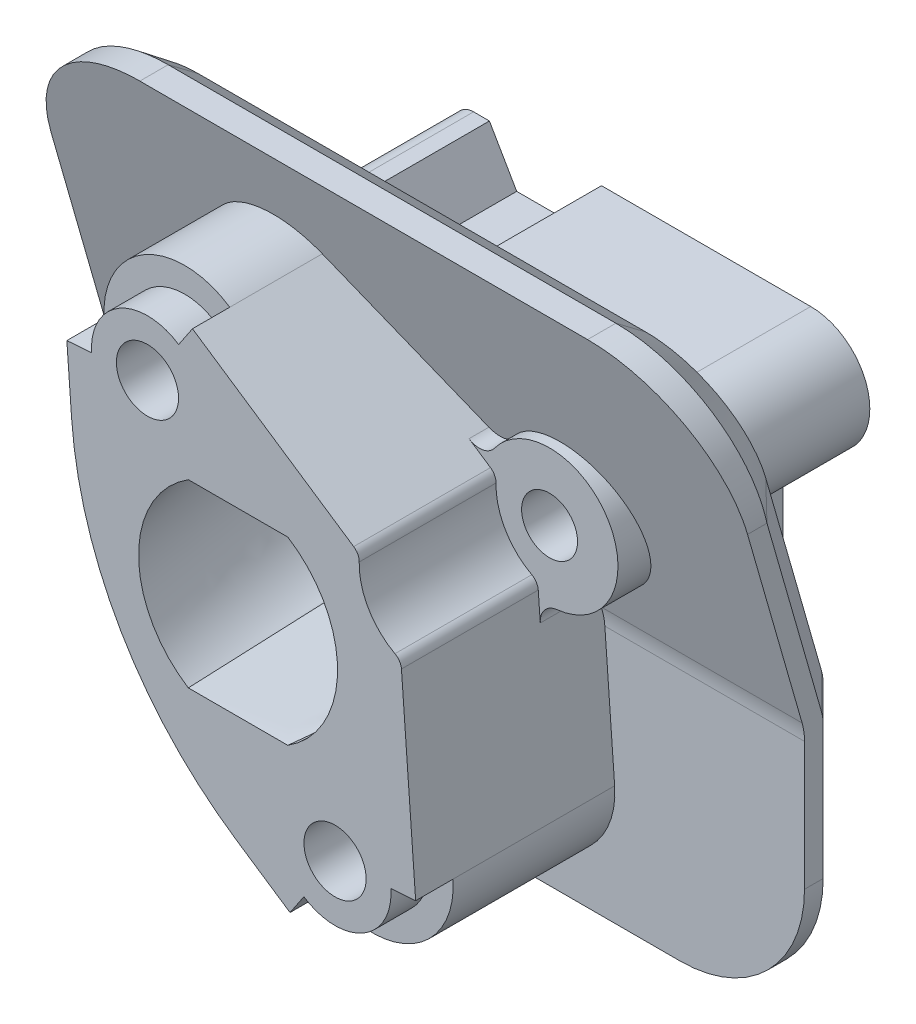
ISO-10303-21;
HEADER;
FILE_DESCRIPTION(('STEP AP214'),'2;1');
FILE_NAME('part.step','',(''),(''),'','','');
FILE_SCHEMA(('AUTOMOTIVE_DESIGN { 1 0 10303 214 1 1 1 1 }'));
ENDSEC;
DATA;
#1=APPLICATION_CONTEXT('core data for automotive mechanical design processes');
#2=APPLICATION_PROTOCOL_DEFINITION('international standard','automotive_design',2000,#1);
#3=PRODUCT_CONTEXT('',#1,'mechanical');
#4=PRODUCT('Part','Part','',(#3));
#5=PRODUCT_RELATED_PRODUCT_CATEGORY('part','',(#4));
#6=PRODUCT_DEFINITION_FORMATION('','',#4);
#7=PRODUCT_DEFINITION_CONTEXT('part definition',#1,'design');
#8=PRODUCT_DEFINITION('design','',#6,#7);
#9=PRODUCT_DEFINITION_SHAPE('','',#8);
#10=(LENGTH_UNIT() NAMED_UNIT(*) SI_UNIT(.MILLI.,.METRE.));
#11=(NAMED_UNIT(*) PLANE_ANGLE_UNIT() SI_UNIT($,.RADIAN.));
#12=(NAMED_UNIT(*) SI_UNIT($,.STERADIAN.) SOLID_ANGLE_UNIT());
#13=UNCERTAINTY_MEASURE_WITH_UNIT(LENGTH_MEASURE(1.E-05),#10,'distance_accuracy_value','');
#14=(GEOMETRIC_REPRESENTATION_CONTEXT(3) GLOBAL_UNCERTAINTY_ASSIGNED_CONTEXT((#13)) GLOBAL_UNIT_ASSIGNED_CONTEXT((#10,
#11,#12)) REPRESENTATION_CONTEXT('',''));
#15=CARTESIAN_POINT('',(0.,0.,0.));
#16=DIRECTION('',(0.,0.,1.));
#17=DIRECTION('',(1.,0.,0.));
#18=AXIS2_PLACEMENT_3D('',#15,#16,#17);
#19=CARTESIAN_POINT('',(6.25,-53.4263295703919,-0.002000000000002));
#20=DIRECTION('',(0.,0.,1.));
#21=DIRECTION('',(1.,0.,0.));
#22=AXIS2_PLACEMENT_3D('',#19,#20,#21);
#23=CYLINDRICAL_SURFACE('',#22,6.5);
#24=DIRECTION('',(0.,0.,1.));
#25=VECTOR('',#24,1.);
#26=CARTESIAN_POINT('',(12.7325622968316,-52.9505291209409,-0.002000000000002));
#27=LINE('',#26,#25);
#28=CARTESIAN_POINT('',(12.7325622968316,-52.9505291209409,16.));
#29=VERTEX_POINT('',#28);
#30=CARTESIAN_POINT('',(12.7325622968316,-52.9505291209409,29.));
#31=VERTEX_POINT('',#30);
#32=EDGE_CURVE('E2161',#29,#31,#27,.T.);
#33=ORIENTED_EDGE('',*,*,#32,.T.);
#34=CARTESIAN_POINT('',(6.25,-53.4263295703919,29.));
#35=DIRECTION('',(0.,0.,1.));
#36=DIRECTION('',(1.,0.,0.));
#37=AXIS2_PLACEMENT_3D('',#34,#35,#36);
#38=CIRCLE('',#37,6.5);
#39=CARTESIAN_POINT('',(2.63062485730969,-58.8254150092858,29.));
#40=VERTEX_POINT('',#39);
#41=EDGE_CURVE('E2148',#40,#31,#38,.T.);
#42=ORIENTED_EDGE('',*,*,#41,.F.);
#43=DIRECTION('',(0.,0.,1.));
#44=VECTOR('',#43,1.);
#45=CARTESIAN_POINT('',(2.63062485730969,-58.8254150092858,-0.002000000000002));
#46=LINE('',#45,#44);
#47=CARTESIAN_POINT('',(2.63062485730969,-58.8254150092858,16.));
#48=VERTEX_POINT('',#47);
#49=EDGE_CURVE('E2170',#48,#40,#46,.T.);
#50=ORIENTED_EDGE('',*,*,#49,.F.);
#51=CARTESIAN_POINT('',(6.25,-53.4263295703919,16.));
#52=DIRECTION('',(0.,0.,-1.));
#53=DIRECTION('',(0.,1.,0.));
#54=AXIS2_PLACEMENT_3D('',#51,#52,#53);
#55=CIRCLE('',#54,6.5);
#56=EDGE_CURVE('E783',#48,#29,#55,.F.);
#57=ORIENTED_EDGE('',*,*,#56,.T.);
#58=EDGE_LOOP('',(#33,#42,#50,#57));
#59=FACE_BOUND('',#58,.T.);
#60=ADVANCED_FACE('F216',(#59),#23,.T.);
#61=CARTESIAN_POINT('',(-8.83181090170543,-27.4929730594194,-0.002000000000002));
#62=DIRECTION('',(0.,0.,1.));
#63=DIRECTION('',(1.,0.,0.));
#64=AXIS2_PLACEMENT_3D('',#61,#62,#63);
#65=CYLINDRICAL_SURFACE('',#64,6.5);
#66=DIRECTION('',(0.,0.,1.));
#67=VECTOR('',#66,1.);
#68=CARTESIAN_POINT('',(-15.314373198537,-27.9687735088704,-0.002000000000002));
#69=LINE('',#68,#67);
#70=CARTESIAN_POINT('',(-15.314373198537,-27.9687735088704,19.8798352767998));
#71=VERTEX_POINT('',#70);
#72=CARTESIAN_POINT('',(-15.314373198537,-27.9687735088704,29.));
#73=VERTEX_POINT('',#72);
#74=EDGE_CURVE('E747',#71,#73,#69,.T.);
#75=ORIENTED_EDGE('',*,*,#74,.T.);
#76=CARTESIAN_POINT('',(-8.83181090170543,-27.4929730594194,29.));
#77=DIRECTION('',(0.,0.,1.));
#78=DIRECTION('',(1.,0.,0.));
#79=AXIS2_PLACEMENT_3D('',#76,#77,#78);
#80=CIRCLE('',#79,6.5);
#81=CARTESIAN_POINT('',(-5.21243575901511,-22.0938876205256,29.));
#82=VERTEX_POINT('',#81);
#83=EDGE_CURVE('E730',#82,#73,#80,.T.);
#84=ORIENTED_EDGE('',*,*,#83,.F.);
#85=DIRECTION('',(0.,0.,1.));
#86=VECTOR('',#85,1.);
#87=CARTESIAN_POINT('',(-5.21243575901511,-22.0938876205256,-0.002000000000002));
#88=LINE('',#87,#86);
#89=CARTESIAN_POINT('',(-5.21243575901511,-22.0938876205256,21.5618747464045));
#90=VERTEX_POINT('',#89);
#91=EDGE_CURVE('E2171',#90,#82,#88,.T.);
#92=ORIENTED_EDGE('',*,*,#91,.F.);
#93=CARTESIAN_POINT('',(-8.83181090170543,-27.4929730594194,20.0160617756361));
#94=DIRECTION('',(0.,0.275250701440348,-0.961372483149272));
#95=DIRECTION('',(0.,0.961372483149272,0.275250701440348));
#96=AXIS2_PLACEMENT_3D('',#93,#94,#95);
#97=ELLIPSE('',#96,6.76116709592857,6.5);
#98=EDGE_CURVE('E754',#90,#71,#97,.F.);
#99=ORIENTED_EDGE('',*,*,#98,.T.);
#100=EDGE_LOOP('',(#75,#84,#92,#99));
#101=FACE_BOUND('',#100,.T.);
#102=ADVANCED_FACE('F752',(#101),#65,.T.);
#103=CARTESIAN_POINT('',(6.25,-53.4263295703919,-0.002000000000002));
#104=DIRECTION('',(0.,0.,1.));
#105=DIRECTION('',(1.,0.,0.));
#106=AXIS2_PLACEMENT_3D('',#103,#104,#105);
#107=CYLINDRICAL_SURFACE('',#106,2.5);
#108=CARTESIAN_POINT('',(6.25,-53.4263295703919,32.));
#109=DIRECTION('',(0.,0.,1.));
#110=DIRECTION('',(1.,0.,0.));
#111=AXIS2_PLACEMENT_3D('',#108,#109,#110);
#112=CIRCLE('',#111,2.5);
#113=CARTESIAN_POINT('',(8.75,-53.4263295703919,32.));
#114=VERTEX_POINT('',#113);
#115=EDGE_CURVE('E2174',#114,#114,#112,.T.);
#116=ORIENTED_EDGE('',*,*,#115,.T.);
#117=EDGE_LOOP('',(#116));
#118=FACE_BOUND('',#117,.T.);
#119=CARTESIAN_POINT('',(6.25,-53.4263295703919,24.));
#120=DIRECTION('',(0.,0.,-1.));
#121=DIRECTION('',(-1.,0.,0.));
#122=AXIS2_PLACEMENT_3D('',#119,#120,#121);
#123=CIRCLE('',#122,2.5);
#124=CARTESIAN_POINT('',(3.75,-53.4263295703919,24.));
#125=VERTEX_POINT('',#124);
#126=EDGE_CURVE('E1710',#125,#125,#123,.F.);
#127=ORIENTED_EDGE('',*,*,#126,.F.);
#128=EDGE_LOOP('',(#127));
#129=FACE_BOUND('',#128,.T.);
#130=ADVANCED_FACE('F1195',(#118,#129),#107,.F.);
#131=CARTESIAN_POINT('',(-8.83181090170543,-27.4929730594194,-0.002000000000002));
#132=DIRECTION('',(0.,0.,1.));
#133=DIRECTION('',(1.,0.,0.));
#134=AXIS2_PLACEMENT_3D('',#131,#132,#133);
#135=CYLINDRICAL_SURFACE('',#134,2.5);
#136=CARTESIAN_POINT('',(-8.83181090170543,-27.4929730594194,32.));
#137=DIRECTION('',(0.,0.,1.));
#138=DIRECTION('',(1.,0.,0.));
#139=AXIS2_PLACEMENT_3D('',#136,#137,#138);
#140=CIRCLE('',#139,2.5);
#141=CARTESIAN_POINT('',(-6.33181090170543,-27.4929730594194,32.));
#142=VERTEX_POINT('',#141);
#143=EDGE_CURVE('E2202',#142,#142,#140,.T.);
#144=ORIENTED_EDGE('',*,*,#143,.T.);
#145=EDGE_LOOP('',(#144));
#146=FACE_BOUND('',#145,.T.);
#147=CARTESIAN_POINT('',(-8.83181090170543,-27.4929730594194,24.));
#148=DIRECTION('',(0.,0.,-1.));
#149=DIRECTION('',(-1.,0.,0.));
#150=AXIS2_PLACEMENT_3D('',#147,#148,#149);
#151=CIRCLE('',#150,2.5);
#152=CARTESIAN_POINT('',(-11.3318109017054,-27.4929730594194,24.));
#153=VERTEX_POINT('',#152);
#154=EDGE_CURVE('E1707',#153,#153,#151,.F.);
#155=ORIENTED_EDGE('',*,*,#154,.F.);
#156=EDGE_LOOP('',(#155));
#157=FACE_BOUND('',#156,.T.);
#158=ADVANCED_FACE('F2444',(#146,#157),#135,.F.);
#159=CARTESIAN_POINT('',(12.5,-27.6894080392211,21.));
#160=DIRECTION('',(0.,-1.,0.));
#161=DIRECTION('',(1.,0.,0.));
#162=AXIS2_PLACEMENT_3D('',#159,#160,#161);
#163=PLANE('',#162);
#164=DIRECTION('',(-1.,0.,0.));
#165=VECTOR('',#164,1.);
#166=CARTESIAN_POINT('',(12.5,-27.6894080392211,0.));
#167=LINE('',#166,#165);
#168=CARTESIAN_POINT('',(12.5,-27.6894080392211,0.));
#169=VERTEX_POINT('',#168);
#170=CARTESIAN_POINT('',(-4.32642053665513,-27.689408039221,0.));
#171=VERTEX_POINT('',#170);
#172=EDGE_CURVE('E849',#169,#171,#167,.T.);
#173=ORIENTED_EDGE('',*,*,#172,.T.);
#174=DIRECTION('',(0.,0.,1.));
#175=VECTOR('',#174,1.);
#176=CARTESIAN_POINT('',(-4.32642053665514,-27.6894080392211,21.));
#177=LINE('',#176,#175);
#178=CARTESIAN_POINT('',(-4.32642053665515,-27.6894080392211,15.7991022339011));
#179=VERTEX_POINT('',#178);
#180=EDGE_CURVE('E1833',#171,#179,#177,.T.);
#181=ORIENTED_EDGE('',*,*,#180,.T.);
#182=DIRECTION('',(-1.,0.,0.));
#183=VECTOR('',#182,1.);
#184=CARTESIAN_POINT('',(12.5,-27.6894080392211,15.7991022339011));
#185=LINE('',#184,#183);
#186=CARTESIAN_POINT('',(12.5,-27.6894080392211,15.7991022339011));
#187=VERTEX_POINT('',#186);
#188=EDGE_CURVE('E823',#187,#179,#185,.T.);
#189=ORIENTED_EDGE('',*,*,#188,.F.);
#190=DIRECTION('',(0.,0.,-1.));
#191=VECTOR('',#190,1.);
#192=CARTESIAN_POINT('',(12.5,-27.6894080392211,21.));
#193=LINE('',#192,#191);
#194=EDGE_CURVE('E870',#187,#169,#193,.T.);
#195=ORIENTED_EDGE('',*,*,#194,.T.);
#196=EDGE_LOOP('',(#173,#181,#189,#195));
#197=FACE_BOUND('',#196,.T.);
#198=ADVANCED_FACE('F2356',(#197),#163,.F.);
#199=CARTESIAN_POINT('',(-13.861027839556,-52.5199356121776,21.));
#200=DIRECTION('',(0.,1.,0.));
#201=DIRECTION('',(0.,0.,1.));
#202=AXIS2_PLACEMENT_3D('',#199,#200,#201);
#203=PLANE('',#202);
#204=DIRECTION('',(1.,0.,0.));
#205=VECTOR('',#204,1.);
#206=CARTESIAN_POINT('',(-13.861027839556,-52.5199356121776,0.));
#207=LINE('',#206,#205);
#208=CARTESIAN_POINT('',(-13.861027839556,-52.5199356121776,0.));
#209=VERTEX_POINT('',#208);
#210=CARTESIAN_POINT('',(1.86582950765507,-52.5199356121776,0.));
#211=VERTEX_POINT('',#210);
#212=EDGE_CURVE('E837',#209,#211,#207,.T.);
#213=ORIENTED_EDGE('',*,*,#212,.T.);
#214=DIRECTION('',(0.,0.,1.));
#215=VECTOR('',#214,1.);
#216=CARTESIAN_POINT('',(1.86582950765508,-52.5199356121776,21.));
#217=LINE('',#216,#215);
#218=CARTESIAN_POINT('',(1.86582950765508,-52.5199356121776,12.));
#219=VERTEX_POINT('',#218);
#220=EDGE_CURVE('E1735',#211,#219,#217,.T.);
#221=ORIENTED_EDGE('',*,*,#220,.T.);
#222=DIRECTION('',(1.,0.,0.));
#223=VECTOR('',#222,1.);
#224=CARTESIAN_POINT('',(-13.861027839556,-52.5199356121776,12.));
#225=LINE('',#224,#223);
#226=CARTESIAN_POINT('',(-13.861027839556,-52.5199356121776,12.));
#227=VERTEX_POINT('',#226);
#228=EDGE_CURVE('E811',#227,#219,#225,.T.);
#229=ORIENTED_EDGE('',*,*,#228,.F.);
#230=DIRECTION('',(0.,0.,-1.));
#231=VECTOR('',#230,1.);
#232=CARTESIAN_POINT('',(-13.861027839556,-52.5199356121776,21.));
#233=LINE('',#232,#231);
#234=EDGE_CURVE('E877',#227,#209,#233,.T.);
#235=ORIENTED_EDGE('',*,*,#234,.T.);
#236=EDGE_LOOP('',(#213,#221,#229,#235));
#237=FACE_BOUND('',#236,.T.);
#238=ADVANCED_FACE('F2335',(#237),#203,.F.);
#239=CARTESIAN_POINT('',(-13.861027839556,-47.7699356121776,21.));
#240=DIRECTION('',(0.,0.,1.));
#241=DIRECTION('',(1.,0.,0.));
#242=AXIS2_PLACEMENT_3D('',#239,#240,#241);
#243=PLANE('',#242);
#244=CARTESIAN_POINT('',(-13.861027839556,-47.7699356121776,21.));
#245=DIRECTION('',(0.,0.,1.));
#246=DIRECTION('',(1.,0.,0.));
#247=AXIS2_PLACEMENT_3D('',#244,#245,#246);
#248=CIRCLE('',#247,2.25);
#249=CARTESIAN_POINT('',(-16.111027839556,-47.7699356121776,21.));
#250=VERTEX_POINT('',#249);
#251=EDGE_CURVE('E1470',#250,#250,#248,.F.);
#252=ORIENTED_EDGE('',*,*,#251,.T.);
#253=EDGE_LOOP('',(#252));
#254=FACE_BOUND('',#253,.T.);
#255=CARTESIAN_POINT('',(14.9882458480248,-30.9923430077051,21.));
#256=DIRECTION('',(0.,0.,1.));
#257=DIRECTION('',(1.,0.,0.));
#258=AXIS2_PLACEMENT_3D('',#255,#256,#257);
#259=CIRCLE('',#258,30.);
#260=CARTESIAN_POINT('',(-7.26366304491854,-51.1132910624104,21.));
#261=VERTEX_POINT('',#260);
#262=CARTESIAN_POINT('',(-13.5043366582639,-40.3823771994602,21.));
#263=VERTEX_POINT('',#262);
#264=EDGE_CURVE('E777',#261,#263,#259,.F.);
#265=ORIENTED_EDGE('',*,*,#264,.T.);
#266=CARTESIAN_POINT('',(-14.9289657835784,-40.8518789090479,21.));
#267=DIRECTION('',(0.,0.,1.));
#268=DIRECTION('',(1.,0.,0.));
#269=AXIS2_PLACEMENT_3D('',#266,#267,#268);
#270=CIRCLE('',#269,1.5);
#271=CARTESIAN_POINT('',(-14.7001219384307,-42.3343196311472,21.));
#272=VERTEX_POINT('',#271);
#273=EDGE_CURVE('E1369',#263,#272,#270,.F.);
#274=ORIENTED_EDGE('',*,*,#273,.T.);
#275=CARTESIAN_POINT('',(-13.861027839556,-47.7699356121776,21.));
#276=DIRECTION('',(0.,0.,1.));
#277=DIRECTION('',(1.,0.,0.));
#278=AXIS2_PLACEMENT_3D('',#275,#276,#277);
#279=CIRCLE('',#278,5.5);
#280=CARTESIAN_POINT('',(-9.55156620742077,-51.1873235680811,21.));
#281=VERTEX_POINT('',#280);
#282=EDGE_CURVE('E2475',#272,#281,#279,.T.);
#283=ORIENTED_EDGE('',*,*,#282,.T.);
#284=CARTESIAN_POINT('',(-8.37625848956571,-52.1193384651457,21.));
#285=DIRECTION('',(0.,0.,1.));
#286=DIRECTION('',(1.,0.,0.));
#287=AXIS2_PLACEMENT_3D('',#284,#285,#286);
#288=CIRCLE('',#287,1.5);
#289=EDGE_CURVE('E1366',#281,#261,#288,.F.);
#290=ORIENTED_EDGE('',*,*,#289,.T.);
#291=EDGE_LOOP('',(#265,#274,#283,#290));
#292=FACE_BOUND('',#291,.T.);
#293=ADVANCED_FACE('F2375',(#254,#292),#243,.T.);
#294=CARTESIAN_POINT('',(12.5,-32.439408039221,21.));
#295=DIRECTION('',(0.,0.,1.));
#296=DIRECTION('',(1.,0.,0.));
#297=AXIS2_PLACEMENT_3D('',#294,#295,#296);
#298=CIRCLE('',#297,2.25);
#299=CARTESIAN_POINT('',(10.25,-32.439408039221,21.));
#300=VERTEX_POINT('',#299);
#301=EDGE_CURVE('E1841',#300,#300,#298,.F.);
#302=ORIENTED_EDGE('',*,*,#301,.T.);
#303=EDGE_LOOP('',(#302));
#304=FACE_BOUND('',#303,.T.);
#305=DIRECTION('',(0.0732000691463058,-0.997317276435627,0.));
#306=VECTOR('',#305,1.);
#307=CARTESIAN_POINT('',(11.5480079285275,-36.8115206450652,21.));
#308=LINE('',#307,#306);
#309=CARTESIAN_POINT('',(11.5902547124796,-37.3871136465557,21.));
#310=VERTEX_POINT('',#309);
#311=CARTESIAN_POINT('',(11.7527731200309,-39.6013522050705,21.));
#312=VERTEX_POINT('',#311);
#313=EDGE_CURVE('E775',#310,#312,#308,.T.);
#314=ORIENTED_EDGE('',*,*,#313,.T.);
#315=CARTESIAN_POINT('',(13.2487490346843,-39.4915521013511,21.));
#316=DIRECTION('',(0.,0.,1.));
#317=DIRECTION('',(1.,0.,0.));
#318=AXIS2_PLACEMENT_3D('',#315,#316,#317);
#319=CIRCLE('',#318,1.5);
#320=CARTESIAN_POINT('',(13.0883028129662,-38.0001577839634,21.));
#321=VERTEX_POINT('',#320);
#322=EDGE_CURVE('E1386',#312,#321,#319,.F.);
#323=ORIENTED_EDGE('',*,*,#322,.T.);
#324=CARTESIAN_POINT('',(12.5,-32.5317119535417,21.));
#325=DIRECTION('',(0.,0.,1.));
#326=DIRECTION('',(1.,0.,0.));
#327=AXIS2_PLACEMENT_3D('',#324,#325,#326);
#328=CIRCLE('',#327,5.5);
#329=CARTESIAN_POINT('',(8.07034346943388,-29.2716286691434,21.));
#330=VERTEX_POINT('',#329);
#331=EDGE_CURVE('E2432',#321,#330,#328,.T.);
#332=ORIENTED_EDGE('',*,*,#331,.T.);
#333=CARTESIAN_POINT('',(6.86225532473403,-28.3825150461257,21.));
#334=DIRECTION('',(0.,0.,1.));
#335=DIRECTION('',(1.,0.,0.));
#336=AXIS2_PLACEMENT_3D('',#333,#334,#335);
#337=CIRCLE('',#336,1.5);
#338=CARTESIAN_POINT('',(6.02701490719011,-29.6284578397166,21.));
#339=VERTEX_POINT('',#338);
#340=EDGE_CURVE('E1388',#330,#339,#337,.F.);
#341=ORIENTED_EDGE('',*,*,#340,.T.);
#342=DIRECTION('',(0.83062852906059,-0.55682694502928,0.));
#343=VECTOR('',#342,1.);
#344=CARTESIAN_POINT('',(-5.21243575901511,-22.0938876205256,21.));
#345=LINE('',#344,#343);
#346=CARTESIAN_POINT('',(7.74975511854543,-30.7833280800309,21.));
#347=VERTEX_POINT('',#346);
#348=EDGE_CURVE('E765',#339,#347,#345,.T.);
#349=ORIENTED_EDGE('',*,*,#348,.T.);
#350=CARTESIAN_POINT('',(7.19292817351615,-31.6139566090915,21.));
#351=DIRECTION('',(0.,0.,1.));
#352=DIRECTION('',(1.,0.,0.));
#353=AXIS2_PLACEMENT_3D('',#350,#351,#352);
#354=CIRCLE('',#353,1.);
#355=CARTESIAN_POINT('',(8.19272045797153,-31.6343376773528,21.));
#356=VERTEX_POINT('',#355);
#357=EDGE_CURVE('E1350',#347,#356,#354,.F.);
#358=ORIENTED_EDGE('',*,*,#357,.T.);
#359=CARTESIAN_POINT('',(13.6915780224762,-31.7464335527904,21.));
#360=DIRECTION('',(0.,0.,1.));
#361=DIRECTION('',(1.,0.,0.));
#362=AXIS2_PLACEMENT_3D('',#359,#360,#361);
#363=CIRCLE('',#362,5.5);
#364=CARTESIAN_POINT('',(11.0696513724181,-36.5812552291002,21.));
#365=VERTEX_POINT('',#364);
#366=EDGE_CURVE('E768',#356,#365,#363,.T.);
#367=ORIENTED_EDGE('',*,*,#366,.T.);
#368=CARTESIAN_POINT('',(10.592937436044,-37.460313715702,21.));
#369=DIRECTION('',(0.,0.,1.));
#370=DIRECTION('',(1.,0.,0.));
#371=AXIS2_PLACEMENT_3D('',#368,#369,#370);
#372=CIRCLE('',#371,1.);
#373=EDGE_CURVE('E1348',#365,#310,#372,.F.);
#374=ORIENTED_EDGE('',*,*,#373,.T.);
#375=EDGE_LOOP('',(#314,#323,#332,#341,#349,#358,#367,#374));
#376=FACE_BOUND('',#375,.T.);
#377=ADVANCED_FACE('F1661',(#304,#376),#243,.T.);
#378=CARTESIAN_POINT('',(28.,-15.5199356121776,23.444063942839));
#379=DIRECTION('',(0.,0.275250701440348,-0.961372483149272));
#380=DIRECTION('',(0.,0.961372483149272,0.275250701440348));
#381=AXIS2_PLACEMENT_3D('',#378,#379,#380);
#382=PLANE('',#381);
#383=CARTESIAN_POINT('',(12.5,-32.5317119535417,18.5734196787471));
#384=DIRECTION('',(0.,0.275250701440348,-0.961372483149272));
#385=DIRECTION('',(0.,0.961372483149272,0.275250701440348));
#386=AXIS2_PLACEMENT_3D('',#383,#384,#385);
#387=ELLIPSE('',#386,5.72098754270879,5.5);
#388=CARTESIAN_POINT('',(13.0883028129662,-38.0001577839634,17.0077481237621));
#389=VERTEX_POINT('',#388);
#390=CARTESIAN_POINT('',(8.07034346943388,-29.2716286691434,19.5068146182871));
#391=VERTEX_POINT('',#390);
#392=EDGE_CURVE('E2193',#389,#391,#387,.F.);
#393=ORIENTED_EDGE('',*,*,#392,.F.);
#394=CARTESIAN_POINT('',(13.2487490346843,-39.4915521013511,16.5807467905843));
#395=DIRECTION('',(0.,0.275250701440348,-0.961372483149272));
#396=DIRECTION('',(0.,0.961372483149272,0.275250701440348));
#397=AXIS2_PLACEMENT_3D('',#394,#395,#396);
#398=ELLIPSE('',#397,1.56026932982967,1.5);
#399=CARTESIAN_POINT('',(11.7527731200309,-39.6013522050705,16.5493099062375));
#400=VERTEX_POINT('',#399);
#401=EDGE_CURVE('E1379',#389,#400,#398,.F.);
#402=ORIENTED_EDGE('',*,*,#401,.T.);
#403=DIRECTION('',(-0.0703868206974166,0.95898806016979,0.274568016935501));
#404=VECTOR('',#403,1.);
#405=CARTESIAN_POINT('',(11.8833147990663,-41.3799225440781,16.0400871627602));
#406=LINE('',#405,#404);
#407=CARTESIAN_POINT('',(11.8440795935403,-40.8453609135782,16.1931375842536));
#408=VERTEX_POINT('',#407);
#409=EDGE_CURVE('E772',#408,#400,#406,.T.);
#410=ORIENTED_EDGE('',*,*,#409,.F.);
#411=DIRECTION('',(-1.,0.,0.));
#412=VECTOR('',#411,1.);
#413=CARTESIAN_POINT('',(28.,-40.8453609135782,16.1931375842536));
#414=LINE('',#413,#412);
#415=CARTESIAN_POINT('',(28.,-40.8453609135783,16.1931375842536));
#416=VERTEX_POINT('',#415);
#417=EDGE_CURVE('E2278',#408,#416,#414,.F.);
#418=ORIENTED_EDGE('',*,*,#417,.T.);
#419=DIRECTION('',(0.,-0.961372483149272,-0.275250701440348));
#420=VECTOR('',#419,1.);
#421=CARTESIAN_POINT('',(28.,-15.5199356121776,23.444063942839));
#422=LINE('',#421,#420);
#423=CARTESIAN_POINT('',(28.,-25.5199356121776,20.5809624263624));
#424=VERTEX_POINT('',#423);
#425=EDGE_CURVE('E789',#424,#416,#422,.T.);
#426=ORIENTED_EDGE('',*,*,#425,.F.);
#427=CARTESIAN_POINT('',(18.,-25.5199356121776,20.5809624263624));
#428=DIRECTION('',(0.,0.275250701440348,-0.961372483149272));
#429=DIRECTION('',(0.,-0.961372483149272,-0.275250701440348));
#430=AXIS2_PLACEMENT_3D('',#427,#428,#429);
#431=ELLIPSE('',#430,10.4017955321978,10.);
#432=CARTESIAN_POINT('',(18.,-15.5199356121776,23.444063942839));
#433=VERTEX_POINT('',#432);
#434=EDGE_CURVE('E925',#424,#433,#431,.F.);
#435=ORIENTED_EDGE('',*,*,#434,.T.);
#436=DIRECTION('',(-1.,0.,0.));
#437=VECTOR('',#436,1.);
#438=CARTESIAN_POINT('',(28.,-15.5199356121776,23.444063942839));
#439=LINE('',#438,#437);
#440=CARTESIAN_POINT('',(-18.,-15.5199356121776,23.444063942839));
#441=VERTEX_POINT('',#440);
#442=EDGE_CURVE('E803',#433,#441,#439,.T.);
#443=ORIENTED_EDGE('',*,*,#442,.T.);
#444=CARTESIAN_POINT('',(-18.,-25.5199356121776,20.5809624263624));
#445=DIRECTION('',(0.,0.275250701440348,-0.961372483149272));
#446=DIRECTION('',(0.,0.961372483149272,0.275250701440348));
#447=AXIS2_PLACEMENT_3D('',#444,#445,#446);
#448=ELLIPSE('',#447,10.4017955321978,10.);
#449=CARTESIAN_POINT('',(-28.,-25.5199356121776,20.5809624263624));
#450=VERTEX_POINT('',#449);
#451=EDGE_CURVE('E923',#441,#450,#448,.F.);
#452=ORIENTED_EDGE('',*,*,#451,.T.);
#453=DIRECTION('',(0.,-0.961372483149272,-0.275250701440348));
#454=VECTOR('',#453,1.);
#455=CARTESIAN_POINT('',(-28.,-15.5199356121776,23.444063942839));
#456=LINE('',#455,#454);
#457=CARTESIAN_POINT('',(-28.,-40.8453609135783,16.1931375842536));
#458=VERTEX_POINT('',#457);
#459=EDGE_CURVE('E796',#450,#458,#456,.T.);
#460=ORIENTED_EDGE('',*,*,#459,.T.);
#461=DIRECTION('',(-1.,0.,0.));
#462=VECTOR('',#461,1.);
#463=CARTESIAN_POINT('',(-16.111027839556,-40.8453609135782,16.1931375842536));
#464=LINE('',#463,#462);
#465=CARTESIAN_POINT('',(-16.111027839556,-40.8453609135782,16.1931375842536));
#466=VERTEX_POINT('',#465);
#467=EDGE_CURVE('E2294',#458,#466,#464,.F.);
#468=ORIENTED_EDGE('',*,*,#467,.T.);
#469=DIRECTION('',(0.,-0.961372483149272,-0.275250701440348));
#470=VECTOR('',#469,1.);
#471=CARTESIAN_POINT('',(-16.111027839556,-6.7928359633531,25.9427211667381));
#472=LINE('',#471,#470);
#473=CARTESIAN_POINT('',(-16.111027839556,-42.7512206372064,15.6474705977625));
#474=VERTEX_POINT('',#473);
#475=EDGE_CURVE('E2467',#466,#474,#472,.T.);
#476=ORIENTED_EDGE('',*,*,#475,.T.);
#477=CARTESIAN_POINT('',(-13.861027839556,-47.7699356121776,14.2105615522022));
#478=DIRECTION('',(0.,0.275250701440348,-0.961372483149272));
#479=DIRECTION('',(0.,0.961372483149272,0.275250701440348));
#480=AXIS2_PLACEMENT_3D('',#477,#478,#479);
#481=ELLIPSE('',#480,5.72098754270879,5.5);
#482=CARTESIAN_POINT('',(-14.7001219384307,-42.3343196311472,15.7668335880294));
#483=VERTEX_POINT('',#482);
#484=EDGE_CURVE('E1443',#483,#474,#481,.F.);
#485=ORIENTED_EDGE('',*,*,#484,.F.);
#486=CARTESIAN_POINT('',(-14.9289657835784,-40.8518789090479,16.1912714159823));
#487=DIRECTION('',(0.,0.275250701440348,-0.961372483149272));
#488=DIRECTION('',(0.,-0.961372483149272,-0.275250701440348));
#489=AXIS2_PLACEMENT_3D('',#486,#487,#488);
#490=ELLIPSE('',#489,1.56026932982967,1.5);
#491=CARTESIAN_POINT('',(-13.5043366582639,-40.3823771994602,16.3256945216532));
#492=VERTEX_POINT('',#491);
#493=EDGE_CURVE('E1364',#483,#492,#490,.F.);
#494=ORIENTED_EDGE('',*,*,#493,.T.);
#495=CARTESIAN_POINT('',(14.9882458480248,-30.9923430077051,19.0141566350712));
#496=DIRECTION('',(0.,0.275250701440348,-0.961372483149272));
#497=DIRECTION('',(0.,0.961372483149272,0.275250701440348));
#498=AXIS2_PLACEMENT_3D('',#495,#496,#497);
#499=ELLIPSE('',#498,31.2053865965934,30.);
#500=CARTESIAN_POINT('',(-14.931272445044,-33.1883450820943,18.3854189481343));
#501=VERTEX_POINT('',#500);
#502=EDGE_CURVE('E2466',#492,#501,#499,.T.);
#503=ORIENTED_EDGE('',*,*,#502,.T.);
#504=DIRECTION('',(-0.0703868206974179,0.95898806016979,0.2745680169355));
#505=VECTOR('',#504,1.);
#506=CARTESIAN_POINT('',(-16.7850506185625,-7.93147004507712,25.6167186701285));
#507=LINE('',#506,#505);
#508=EDGE_CURVE('E2464',#501,#71,#507,.T.);
#509=ORIENTED_EDGE('',*,*,#508,.T.);
#510=ORIENTED_EDGE('',*,*,#98,.F.);
#511=DIRECTION('',(-0.820269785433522,0.549882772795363,0.157437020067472));
#512=VECTOR('',#511,1.);
#513=CARTESIAN_POINT('',(-2.42765906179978,-23.9607133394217,21.0273835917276));
#514=LINE('',#513,#512);
#515=CARTESIAN_POINT('',(6.02701490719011,-29.6284578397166,19.404650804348));
#516=VERTEX_POINT('',#515);
#517=EDGE_CURVE('E756',#516,#90,#514,.T.);
#518=ORIENTED_EDGE('',*,*,#517,.F.);
#519=CARTESIAN_POINT('',(6.86225532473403,-28.3825150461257,19.7613768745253));
#520=DIRECTION('',(0.,0.275250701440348,-0.961372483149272));
#521=DIRECTION('',(0.,0.961372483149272,0.275250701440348));
#522=AXIS2_PLACEMENT_3D('',#519,#520,#521);
#523=ELLIPSE('',#522,1.56026932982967,1.5);
#524=EDGE_CURVE('E1377',#516,#391,#523,.F.);
#525=ORIENTED_EDGE('',*,*,#524,.T.);
#526=EDGE_LOOP('',(#393,#402,#410,#418,#426,#435,#443,#452,#460,#468,#476,#485,#494,#503,#509,
#510,#518,#525));
#527=FACE_BOUND('',#526,.T.);
#528=ADVANCED_FACE('F1227',(#527),#382,.F.);
#529=CARTESIAN_POINT('',(28.,-40.9585925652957,12.));
#530=DIRECTION('',(0.,-0.275250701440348,0.961372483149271));
#531=DIRECTION('',(0.,-0.961372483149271,-0.275250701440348));
#532=AXIS2_PLACEMENT_3D('',#529,#530,#531);
#533=PLANE('',#532);
#534=ORIENTED_EDGE('',*,*,#188,.T.);
#535=DIRECTION('',(0.485304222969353,0.840571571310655,0.240664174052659));
#536=VECTOR('',#535,1.);
#537=CARTESIAN_POINT('',(-2.56955067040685,-24.6464201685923,16.6703405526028));
#538=LINE('',#537,#536);
#539=CARTESIAN_POINT('',(-4.21300874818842,-27.4929730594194,15.855343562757));
#540=VERTEX_POINT('',#539);
#541=EDGE_CURVE('E1830',#179,#540,#538,.T.);
#542=ORIENTED_EDGE('',*,*,#541,.T.);
#543=DIRECTION('',(-0.485304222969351,0.840571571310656,0.240664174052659));
#544=VECTOR('',#543,1.);
#545=CARTESIAN_POINT('',(9.3171609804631,-50.9279144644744,9.14568193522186));
#546=LINE('',#545,#544);
#547=CARTESIAN_POINT('',(-6.52240982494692,-23.4929730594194,17.0005841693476));
#548=VERTEX_POINT('',#547);
#549=EDGE_CURVE('E1732',#540,#548,#546,.T.);
#550=ORIENTED_EDGE('',*,*,#549,.T.);
#551=DIRECTION('',(-1.,0.,0.));
#552=VECTOR('',#551,1.);
#553=CARTESIAN_POINT('',(28.,-23.4929730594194,17.0005841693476));
#554=LINE('',#553,#552);
#555=CARTESIAN_POINT('',(-11.1412119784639,-23.4929730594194,17.0005841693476));
#556=VERTEX_POINT('',#555);
#557=EDGE_CURVE('E1729',#548,#556,#554,.T.);
#558=ORIENTED_EDGE('',*,*,#557,.T.);
#559=DIRECTION('',(-0.485304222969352,-0.840571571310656,-0.240664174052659));
#560=VECTOR('',#559,1.);
#561=CARTESIAN_POINT('',(-9.631512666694,-20.8780971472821,17.7492496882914));
#562=LINE('',#561,#560);
#563=CARTESIAN_POINT('',(-13.4506130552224,-27.4929730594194,15.855343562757));
#564=VERTEX_POINT('',#563);
#565=EDGE_CURVE('E1726',#556,#564,#562,.T.);
#566=ORIENTED_EDGE('',*,*,#565,.T.);
#567=DIRECTION('',(0.485304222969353,-0.840571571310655,-0.240664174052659));
#568=VECTOR('',#567,1.);
#569=CARTESIAN_POINT('',(2.25519898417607,-54.6962374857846,8.0667727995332));
#570=LINE('',#569,#568);
#571=CARTESIAN_POINT('',(-13.3372012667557,-27.6894080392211,15.7991022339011));
#572=VERTEX_POINT('',#571);
#573=EDGE_CURVE('E1827',#564,#572,#570,.T.);
#574=ORIENTED_EDGE('',*,*,#573,.T.);
#575=CARTESIAN_POINT('',(-14.611027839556,-27.6894080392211,15.7991022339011));
#576=VERTEX_POINT('',#575);
#577=EDGE_CURVE('E822',#572,#576,#185,.T.);
#578=ORIENTED_EDGE('',*,*,#577,.T.);
#579=CARTESIAN_POINT('',(-14.611027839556,-29.1894080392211,15.3696370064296));
#580=DIRECTION('',(0.,-0.275250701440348,0.961372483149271));
#581=DIRECTION('',(0.,-0.961372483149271,-0.275250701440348));
#582=AXIS2_PLACEMENT_3D('',#579,#580,#581);
#583=ELLIPSE('',#582,1.56026932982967,1.5);
#584=CARTESIAN_POINT('',(-16.111027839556,-29.1894080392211,15.3696370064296));
#585=VERTEX_POINT('',#584);
#586=EDGE_CURVE('E819',#576,#585,#583,.T.);
#587=ORIENTED_EDGE('',*,*,#586,.T.);
#588=DIRECTION('',(0.,-0.961372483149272,-0.275250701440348));
#589=VECTOR('',#588,1.);
#590=CARTESIAN_POINT('',(-16.111027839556,-27.6995101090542,15.7962099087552));
#591=LINE('',#590,#589);
#592=CARTESIAN_POINT('',(-16.111027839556,-40.2840178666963,12.1931375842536));
#593=VERTEX_POINT('',#592);
#594=EDGE_CURVE('E882',#585,#593,#591,.T.);
#595=ORIENTED_EDGE('',*,*,#594,.T.);
#596=DIRECTION('',(-1.,0.,0.));
#597=VECTOR('',#596,1.);
#598=CARTESIAN_POINT('',(28.,-40.2840178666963,12.1931375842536));
#599=LINE('',#598,#597);
#600=CARTESIAN_POINT('',(-25.5,-40.2840178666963,12.1931375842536));
#601=VERTEX_POINT('',#600);
#602=EDGE_CURVE('E1314',#593,#601,#599,.T.);
#603=ORIENTED_EDGE('',*,*,#602,.T.);
#604=DIRECTION('',(0.,0.961372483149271,0.275250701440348));
#605=VECTOR('',#604,1.);
#606=CARTESIAN_POINT('',(-25.5,-40.9585925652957,12.));
#607=LINE('',#606,#605);
#608=CARTESIAN_POINT('',(-25.5,-24.8318088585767,16.6172618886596));
#609=VERTEX_POINT('',#608);
#610=EDGE_CURVE('E1301',#601,#609,#607,.T.);
#611=ORIENTED_EDGE('',*,*,#610,.T.);
#612=CARTESIAN_POINT('',(-18.,-17.3318088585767,18.764588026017));
#613=CARTESIAN_POINT('',(-18.4908765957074,-17.3317757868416,18.7645974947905));
#614=CARTESIAN_POINT('',(-18.9817328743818,-17.3801539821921,18.7507463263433));
#615=CARTESIAN_POINT('',(-19.9446219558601,-17.5716845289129,18.6959091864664));
#616=CARTESIAN_POINT('',(-20.4166149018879,-17.7148620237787,18.6549160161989));
#617=CARTESIAN_POINT('',(-21.3236365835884,-18.0905627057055,18.5473490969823));
#618=CARTESIAN_POINT('',(-21.7586277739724,-18.3230703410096,18.4807798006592));
#619=CARTESIAN_POINT('',(-22.5749257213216,-18.8685031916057,18.3246168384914));
#620=CARTESIAN_POINT('',(-22.9561986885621,-19.1814058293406,18.2350296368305));
#621=CARTESIAN_POINT('',(-23.6504030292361,-19.8756101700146,18.0362718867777));
#622=CARTESIAN_POINT('',(-23.9633056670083,-20.2568831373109,17.927109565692));
#623=CARTESIAN_POINT('',(-24.5087385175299,-21.0731810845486,17.6933951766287));
#624=CARTESIAN_POINT('',(-24.7412461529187,-21.5081722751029,17.5688527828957));
#625=CARTESIAN_POINT('',(-25.1169468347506,-22.4151939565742,17.3091632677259));
#626=CARTESIAN_POINT('',(-25.2601243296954,-22.8871869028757,17.1740268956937));
#627=CARTESIAN_POINT('',(-25.451654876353,-23.8500759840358,16.8983419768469));
#628=CARTESIAN_POINT('',(-25.5000330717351,-24.3409322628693,16.7578048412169));
#629=CARTESIAN_POINT('',(-25.5,-24.8318088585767,16.6172618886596));
#630=B_SPLINE_CURVE_WITH_KNOTS('',3,(#612,#613,#614,#615,#616,#617,#618,#619,#620,#621,#622,
#623,#624,#625,#626,#627,#628,#629),.UNSPECIFIED.,.F.,.F.,(4,2,2,2,2,2,2,2,4),(0.,
0.196349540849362,0.392699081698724,0.589048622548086,0.785398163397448,0.98174770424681,
1.17809724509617,1.37444678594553,1.5707963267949),.UNSPECIFIED.);
#631=CARTESIAN_POINT('',(-18.,-17.3318088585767,18.764588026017));
#632=VERTEX_POINT('',#631);
#633=EDGE_CURVE('E1246',#609,#632,#630,.F.);
#634=ORIENTED_EDGE('',*,*,#633,.T.);
#635=DIRECTION('',(1.,0.,0.));
#636=VECTOR('',#635,1.);
#637=CARTESIAN_POINT('',(28.,-17.3318088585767,18.764588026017));
#638=LINE('',#637,#636);
#639=CARTESIAN_POINT('',(18.,-17.3318088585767,18.764588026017));
#640=VERTEX_POINT('',#639);
#641=EDGE_CURVE('E1249',#632,#640,#638,.T.);
#642=ORIENTED_EDGE('',*,*,#641,.T.);
#643=CARTESIAN_POINT('',(25.5,-24.8318088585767,16.6172618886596));
#644=CARTESIAN_POINT('',(25.5000330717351,-24.3409322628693,16.7578048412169));
#645=CARTESIAN_POINT('',(25.451654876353,-23.8500759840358,16.8983419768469));
#646=CARTESIAN_POINT('',(25.2601243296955,-22.8871869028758,17.1740268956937));
#647=CARTESIAN_POINT('',(25.1169468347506,-22.4151939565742,17.3091632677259));
#648=CARTESIAN_POINT('',(24.7412461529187,-21.5081722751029,17.5688527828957));
#649=CARTESIAN_POINT('',(24.5087385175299,-21.0731810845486,17.6933951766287));
#650=CARTESIAN_POINT('',(23.9633056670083,-20.2568831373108,17.927109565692));
#651=CARTESIAN_POINT('',(23.6504030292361,-19.8756101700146,18.0362718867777));
#652=CARTESIAN_POINT('',(22.9561986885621,-19.1814058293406,18.2350296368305));
#653=CARTESIAN_POINT('',(22.5749257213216,-18.8685031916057,18.3246168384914));
#654=CARTESIAN_POINT('',(21.7586277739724,-18.3230703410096,18.4807798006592));
#655=CARTESIAN_POINT('',(21.3236365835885,-18.0905627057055,18.5473490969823));
#656=CARTESIAN_POINT('',(20.4166149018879,-17.7148620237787,18.6549160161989));
#657=CARTESIAN_POINT('',(19.9446219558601,-17.5716845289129,18.6959091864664));
#658=CARTESIAN_POINT('',(18.9817328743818,-17.3801539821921,18.7507463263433));
#659=CARTESIAN_POINT('',(18.4908765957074,-17.3317757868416,18.7645974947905));
#660=CARTESIAN_POINT('',(18.,-17.3318088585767,18.764588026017));
#661=B_SPLINE_CURVE_WITH_KNOTS('',3,(#643,#644,#645,#646,#647,#648,#649,#650,#651,#652,#653,
#654,#655,#656,#657,#658,#659,#660),.UNSPECIFIED.,.F.,.F.,(4,2,2,2,2,2,2,2,4),(1.5707963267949,
1.76714586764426,1.96349540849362,2.15984494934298,2.35619449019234,2.55254403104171,
2.74889357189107,2.94524311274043,3.14159265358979),.UNSPECIFIED.);
#662=CARTESIAN_POINT('',(25.5,-24.8318088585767,16.6172618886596));
#663=VERTEX_POINT('',#662);
#664=EDGE_CURVE('E1251',#640,#663,#661,.F.);
#665=ORIENTED_EDGE('',*,*,#664,.T.);
#666=DIRECTION('',(0.,-0.961372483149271,-0.275250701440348));
#667=VECTOR('',#666,1.);
#668=CARTESIAN_POINT('',(25.5,-40.9585925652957,12.));
#669=LINE('',#668,#667);
#670=CARTESIAN_POINT('',(25.5,-40.2840178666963,12.1931375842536));
#671=VERTEX_POINT('',#670);
#672=EDGE_CURVE('E1253',#663,#671,#669,.T.);
#673=ORIENTED_EDGE('',*,*,#672,.T.);
#674=DIRECTION('',(-1.,0.,0.));
#675=VECTOR('',#674,1.);
#676=CARTESIAN_POINT('',(28.,-40.2840178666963,12.1931375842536));
#677=LINE('',#676,#675);
#678=CARTESIAN_POINT('',(10.25,-40.2840178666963,12.1931375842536));
#679=VERTEX_POINT('',#678);
#680=EDGE_CURVE('E1316',#671,#679,#677,.T.);
#681=ORIENTED_EDGE('',*,*,#680,.T.);
#682=DIRECTION('',(0.,0.961372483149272,0.275250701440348));
#683=VECTOR('',#682,1.);
#684=CARTESIAN_POINT('',(10.25,-47.8760925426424,10.0194495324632));
#685=LINE('',#684,#683);
#686=CARTESIAN_POINT('',(10.25,-38.6442448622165,12.662621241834));
#687=VERTEX_POINT('',#686);
#688=EDGE_CURVE('E832',#679,#687,#685,.T.);
#689=ORIENTED_EDGE('',*,*,#688,.T.);
#690=CARTESIAN_POINT('',(11.75,-38.6442448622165,12.662621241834));
#691=DIRECTION('',(0.,-0.275250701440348,0.961372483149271));
#692=DIRECTION('',(0.,-0.961372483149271,-0.275250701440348));
#693=AXIS2_PLACEMENT_3D('',#690,#691,#692);
#694=ELLIPSE('',#693,1.56026932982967,1.5);
#695=CARTESIAN_POINT('',(11.93,-37.1550840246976,13.0889831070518));
#696=VERTEX_POINT('',#695);
#697=EDGE_CURVE('E829',#687,#696,#694,.F.);
#698=ORIENTED_EDGE('',*,*,#697,.T.);
#699=CARTESIAN_POINT('',(12.5,-32.439408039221,14.4391290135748));
#700=DIRECTION('',(0.,-0.275250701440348,0.961372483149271));
#701=DIRECTION('',(0.,-0.961372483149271,-0.275250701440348));
#702=AXIS2_PLACEMENT_3D('',#699,#700,#701);
#703=ELLIPSE('',#702,4.94085287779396,4.75);
#704=EDGE_CURVE('E826',#696,#187,#703,.T.);
#705=ORIENTED_EDGE('',*,*,#704,.T.);
#706=EDGE_LOOP('',(#534,#542,#550,#558,#566,#574,#578,#587,#595,#603,#611,#634,#642,#665,#673,
#681,#689,#698,#705));
#707=FACE_BOUND('',#706,.T.);
#708=ADVANCED_FACE('F1222',(#707),#533,.F.);
#709=CARTESIAN_POINT('',(28.,-41.5199356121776,16.));
#710=DIRECTION('',(0.,0.,-1.));
#711=DIRECTION('',(0.,1.,0.));
#712=AXIS2_PLACEMENT_3D('',#709,#710,#711);
#713=PLANE('',#712);
#714=CARTESIAN_POINT('',(14.9882458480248,-30.9923430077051,16.));
#715=DIRECTION('',(0.,0.,-1.));
#716=DIRECTION('',(0.,1.,0.));
#717=AXIS2_PLACEMENT_3D('',#714,#715,#716);
#718=CIRCLE('',#717,30.);
#719=CARTESIAN_POINT('',(-7.26366304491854,-51.1132910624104,16.));
#720=VERTEX_POINT('',#719);
#721=CARTESIAN_POINT('',(-1.71656250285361,-55.9111988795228,16.));
#722=VERTEX_POINT('',#721);
#723=EDGE_CURVE('E780',#720,#722,#718,.F.);
#724=ORIENTED_EDGE('',*,*,#723,.F.);
#725=CARTESIAN_POINT('',(-8.37625848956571,-52.1193384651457,16.));
#726=DIRECTION('',(0.,0.,-1.));
#727=DIRECTION('',(0.,1.,0.));
#728=AXIS2_PLACEMENT_3D('',#725,#726,#727);
#729=CIRCLE('',#728,1.5);
#730=CARTESIAN_POINT('',(-9.55156620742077,-51.1873235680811,16.));
#731=VERTEX_POINT('',#730);
#732=EDGE_CURVE('E1362',#720,#731,#729,.F.);
#733=ORIENTED_EDGE('',*,*,#732,.T.);
#734=CARTESIAN_POINT('',(-13.861027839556,-47.7699356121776,16.));
#735=DIRECTION('',(0.,0.,-1.));
#736=DIRECTION('',(0.,1.,0.));
#737=AXIS2_PLACEMENT_3D('',#734,#735,#736);
#738=CIRCLE('',#737,5.5);
#739=CARTESIAN_POINT('',(-16.111027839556,-42.7512206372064,16.));
#740=VERTEX_POINT('',#739);
#741=EDGE_CURVE('E2436',#740,#731,#738,.F.);
#742=ORIENTED_EDGE('',*,*,#741,.F.);
#743=DIRECTION('',(0.,1.,0.));
#744=VECTOR('',#743,1.);
#745=CARTESIAN_POINT('',(-16.111027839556,-29.1894080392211,16.));
#746=LINE('',#745,#744);
#747=CARTESIAN_POINT('',(-16.111027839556,-42.22161442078,16.));
#748=VERTEX_POINT('',#747);
#749=EDGE_CURVE('E816',#740,#748,#746,.T.);
#750=ORIENTED_EDGE('',*,*,#749,.T.);
#751=DIRECTION('',(-1.,0.,0.));
#752=VECTOR('',#751,1.);
#753=CARTESIAN_POINT('',(-28.,-42.22161442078,16.));
#754=LINE('',#753,#752);
#755=CARTESIAN_POINT('',(-28.,-42.22161442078,16.));
#756=VERTEX_POINT('',#755);
#757=EDGE_CURVE('E2286',#748,#756,#754,.T.);
#758=ORIENTED_EDGE('',*,*,#757,.T.);
#759=DIRECTION('',(0.,-1.,0.));
#760=VECTOR('',#759,1.);
#761=CARTESIAN_POINT('',(-28.,-41.5199356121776,16.));
#762=LINE('',#761,#760);
#763=CARTESIAN_POINT('',(-28.,-52.5199356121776,16.));
#764=VERTEX_POINT('',#763);
#765=EDGE_CURVE('E793',#756,#764,#762,.T.);
#766=ORIENTED_EDGE('',*,*,#765,.T.);
#767=CARTESIAN_POINT('',(-18.,-52.5199356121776,16.));
#768=DIRECTION('',(0.,0.,-1.));
#769=DIRECTION('',(0.,1.,0.));
#770=AXIS2_PLACEMENT_3D('',#767,#768,#769);
#771=CIRCLE('',#770,10.);
#772=CARTESIAN_POINT('',(-18.,-62.5199356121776,16.));
#773=VERTEX_POINT('',#772);
#774=EDGE_CURVE('E915',#764,#773,#771,.F.);
#775=ORIENTED_EDGE('',*,*,#774,.T.);
#776=DIRECTION('',(-1.,0.,0.));
#777=VECTOR('',#776,1.);
#778=CARTESIAN_POINT('',(28.,-62.5199356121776,16.));
#779=LINE('',#778,#777);
#780=CARTESIAN_POINT('',(18.,-62.5199356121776,16.));
#781=VERTEX_POINT('',#780);
#782=EDGE_CURVE('E795',#781,#773,#779,.T.);
#783=ORIENTED_EDGE('',*,*,#782,.F.);
#784=CARTESIAN_POINT('',(18.,-52.5199356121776,16.));
#785=DIRECTION('',(0.,0.,-1.));
#786=DIRECTION('',(0.,1.,0.));
#787=AXIS2_PLACEMENT_3D('',#784,#785,#786);
#788=CIRCLE('',#787,10.);
#789=CARTESIAN_POINT('',(28.,-52.5199356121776,16.));
#790=VERTEX_POINT('',#789);
#791=EDGE_CURVE('E2388',#781,#790,#788,.F.);
#792=ORIENTED_EDGE('',*,*,#791,.T.);
#793=DIRECTION('',(0.,-1.,0.));
#794=VECTOR('',#793,1.);
#795=CARTESIAN_POINT('',(28.,-41.5199356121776,16.));
#796=LINE('',#795,#794);
#797=CARTESIAN_POINT('',(28.,-42.22161442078,16.));
#798=VERTEX_POINT('',#797);
#799=EDGE_CURVE('E792',#798,#790,#796,.T.);
#800=ORIENTED_EDGE('',*,*,#799,.F.);
#801=DIRECTION('',(-1.,0.,0.));
#802=VECTOR('',#801,1.);
#803=CARTESIAN_POINT('',(10.25,-42.22161442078,16.));
#804=LINE('',#803,#802);
#805=CARTESIAN_POINT('',(11.9450924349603,-42.22161442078,16.));
#806=VERTEX_POINT('',#805);
#807=EDGE_CURVE('E1300',#798,#806,#804,.T.);
#808=ORIENTED_EDGE('',*,*,#807,.T.);
#809=DIRECTION('',(-0.0732000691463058,0.997317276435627,0.));
#810=VECTOR('',#809,1.);
#811=CARTESIAN_POINT('',(11.5480079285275,-36.8115206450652,16.));
#812=LINE('',#811,#810);
#813=EDGE_CURVE('E759',#29,#806,#812,.T.);
#814=ORIENTED_EDGE('',*,*,#813,.F.);
#815=ORIENTED_EDGE('',*,*,#56,.F.);
#816=DIRECTION('',(0.83062852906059,-0.55682694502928,0.));
#817=VECTOR('',#816,1.);
#818=CARTESIAN_POINT('',(-1.71656250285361,-55.9111988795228,16.));
#819=LINE('',#818,#817);
#820=EDGE_CURVE('E786',#722,#48,#819,.T.);
#821=ORIENTED_EDGE('',*,*,#820,.F.);
#822=EDGE_LOOP('',(#724,#733,#742,#750,#758,#766,#775,#783,#792,#800,#808,#814,#815,#821));
#823=FACE_BOUND('',#822,.T.);
#824=ADVANCED_FACE('F1226',(#823),#713,.F.);
#825=CARTESIAN_POINT('',(28.,-62.5199356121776,12.));
#826=DIRECTION('',(0.,0.,1.));
#827=DIRECTION('',(1.,0.,0.));
#828=AXIS2_PLACEMENT_3D('',#825,#826,#827);
#829=PLANE('',#828);
#830=DIRECTION('',(1.,0.,0.));
#831=VECTOR('',#830,1.);
#832=CARTESIAN_POINT('',(8.55940107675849,-49.4263295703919,12.));
#833=LINE('',#832,#831);
#834=CARTESIAN_POINT('',(8.55940107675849,-49.4263295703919,12.));
#835=VERTEX_POINT('',#834);
#836=CARTESIAN_POINT('',(9.75,-49.4263295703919,12.));
#837=VERTEX_POINT('',#836);
#838=EDGE_CURVE('E1811',#835,#837,#833,.T.);
#839=ORIENTED_EDGE('',*,*,#838,.T.);
#840=CARTESIAN_POINT('',(9.75,-48.9263295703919,12.));
#841=DIRECTION('',(0.,0.,1.));
#842=DIRECTION('',(1.,0.,0.));
#843=AXIS2_PLACEMENT_3D('',#840,#841,#842);
#844=CIRCLE('',#843,0.5);
#845=CARTESIAN_POINT('',(10.25,-48.9263295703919,12.));
#846=VERTEX_POINT('',#845);
#847=EDGE_CURVE('E13',#837,#846,#844,.T.);
#848=ORIENTED_EDGE('',*,*,#847,.T.);
#849=DIRECTION('',(0.,1.,0.));
#850=VECTOR('',#849,1.);
#851=CARTESIAN_POINT('',(10.25,-51.0199356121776,12.));
#852=LINE('',#851,#850);
#853=CARTESIAN_POINT('',(10.25,-41.6602713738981,12.));
#854=VERTEX_POINT('',#853);
#855=EDGE_CURVE('E814',#846,#854,#852,.T.);
#856=ORIENTED_EDGE('',*,*,#855,.T.);
#857=DIRECTION('',(-1.,0.,0.));
#858=VECTOR('',#857,1.);
#859=CARTESIAN_POINT('',(28.,-41.6602713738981,12.));
#860=LINE('',#859,#858);
#861=CARTESIAN_POINT('',(25.5,-41.6602713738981,12.));
#862=VERTEX_POINT('',#861);
#863=EDGE_CURVE('E1320',#854,#862,#860,.F.);
#864=ORIENTED_EDGE('',*,*,#863,.T.);
#865=DIRECTION('',(0.,-1.,0.));
#866=VECTOR('',#865,1.);
#867=CARTESIAN_POINT('',(25.5,-52.5199356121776,12.));
#868=LINE('',#867,#866);
#869=CARTESIAN_POINT('',(25.5,-52.5199356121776,12.));
#870=VERTEX_POINT('',#869);
#871=EDGE_CURVE('E2260',#862,#870,#868,.T.);
#872=ORIENTED_EDGE('',*,*,#871,.T.);
#873=CARTESIAN_POINT('',(18.,-52.5199356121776,12.));
#874=DIRECTION('',(0.,0.,1.));
#875=DIRECTION('',(1.,0.,0.));
#876=AXIS2_PLACEMENT_3D('',#873,#874,#875);
#877=CIRCLE('',#876,7.50000000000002);
#878=CARTESIAN_POINT('',(18.,-60.0199356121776,12.));
#879=VERTEX_POINT('',#878);
#880=EDGE_CURVE('E2267',#870,#879,#877,.F.);
#881=ORIENTED_EDGE('',*,*,#880,.T.);
#882=DIRECTION('',(-1.,0.,0.));
#883=VECTOR('',#882,1.);
#884=CARTESIAN_POINT('',(28.,-60.0199356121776,12.));
#885=LINE('',#884,#883);
#886=CARTESIAN_POINT('',(-18.,-60.0199356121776,12.));
#887=VERTEX_POINT('',#886);
#888=EDGE_CURVE('E2265',#879,#887,#885,.T.);
#889=ORIENTED_EDGE('',*,*,#888,.T.);
#890=CARTESIAN_POINT('',(-18.,-52.5199356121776,12.));
#891=DIRECTION('',(0.,0.,1.));
#892=DIRECTION('',(1.,0.,0.));
#893=AXIS2_PLACEMENT_3D('',#890,#891,#892);
#894=CIRCLE('',#893,7.49999999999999);
#895=CARTESIAN_POINT('',(-25.5,-52.5199356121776,12.));
#896=VERTEX_POINT('',#895);
#897=EDGE_CURVE('E2264',#887,#896,#894,.F.);
#898=ORIENTED_EDGE('',*,*,#897,.T.);
#899=DIRECTION('',(0.,1.,0.));
#900=VECTOR('',#899,1.);
#901=CARTESIAN_POINT('',(-25.5,-62.5199356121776,12.));
#902=LINE('',#901,#900);
#903=CARTESIAN_POINT('',(-25.5,-41.6602713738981,12.));
#904=VERTEX_POINT('',#903);
#905=EDGE_CURVE('E899',#896,#904,#902,.T.);
#906=ORIENTED_EDGE('',*,*,#905,.T.);
#907=DIRECTION('',(-1.,0.,0.));
#908=VECTOR('',#907,1.);
#909=CARTESIAN_POINT('',(28.,-41.6602713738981,12.));
#910=LINE('',#909,#908);
#911=CARTESIAN_POINT('',(-16.111027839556,-41.6602713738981,12.));
#912=VERTEX_POINT('',#911);
#913=EDGE_CURVE('E1318',#904,#912,#910,.F.);
#914=ORIENTED_EDGE('',*,*,#913,.T.);
#915=DIRECTION('',(0.,-1.,0.));
#916=VECTOR('',#915,1.);
#917=CARTESIAN_POINT('',(-16.111027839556,-29.1894080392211,12.));
#918=LINE('',#917,#916);
#919=CARTESIAN_POINT('',(-16.111027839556,-42.7699356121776,12.));
#920=VERTEX_POINT('',#919);
#921=EDGE_CURVE('E806',#912,#920,#918,.T.);
#922=ORIENTED_EDGE('',*,*,#921,.T.);
#923=CARTESIAN_POINT('',(-17.611027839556,-42.7699356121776,12.));
#924=DIRECTION('',(0.,0.,1.));
#925=DIRECTION('',(1.,0.,0.));
#926=AXIS2_PLACEMENT_3D('',#923,#924,#925);
#927=CIRCLE('',#926,1.5);
#928=CARTESIAN_POINT('',(-16.711027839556,-43.9699356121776,12.));
#929=VERTEX_POINT('',#928);
#930=EDGE_CURVE('E879',#920,#929,#927,.F.);
#931=ORIENTED_EDGE('',*,*,#930,.T.);
#932=CARTESIAN_POINT('',(-13.861027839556,-47.7699356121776,12.));
#933=DIRECTION('',(0.,0.,1.));
#934=DIRECTION('',(1.,0.,0.));
#935=AXIS2_PLACEMENT_3D('',#932,#933,#934);
#936=CIRCLE('',#935,4.75);
#937=EDGE_CURVE('E808',#929,#227,#936,.T.);
#938=ORIENTED_EDGE('',*,*,#937,.T.);
#939=ORIENTED_EDGE('',*,*,#228,.T.);
#940=CARTESIAN_POINT('',(1.86582950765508,-52.0199356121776,12.));
#941=DIRECTION('',(0.,0.,1.));
#942=DIRECTION('',(1.,0.,0.));
#943=AXIS2_PLACEMENT_3D('',#940,#941,#942);
#944=CIRCLE('',#943,0.5);
#945=CARTESIAN_POINT('',(2.2988422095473,-52.2699356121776,12.));
#946=VERTEX_POINT('',#945);
#947=EDGE_CURVE('E224',#219,#946,#944,.T.);
#948=ORIENTED_EDGE('',*,*,#947,.T.);
#949=DIRECTION('',(-0.500000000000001,-0.866025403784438,0.));
#950=VECTOR('',#949,1.);
#951=CARTESIAN_POINT('',(4.28575146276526,-48.8285078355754,12.));
#952=LINE('',#951,#950);
#953=CARTESIAN_POINT('',(1.63119784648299,-53.4263295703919,12.));
#954=VERTEX_POINT('',#953);
#955=EDGE_CURVE('E1750',#946,#954,#952,.T.);
#956=ORIENTED_EDGE('',*,*,#955,.T.);
#957=DIRECTION('',(0.499999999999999,-0.866025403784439,0.));
#958=VECTOR('',#957,1.);
#959=CARTESIAN_POINT('',(12.1610453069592,-71.6645603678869,12.));
#960=LINE('',#959,#958);
#961=CARTESIAN_POINT('',(3.94059892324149,-57.4263295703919,12.));
#962=VERTEX_POINT('',#961);
#963=EDGE_CURVE('E1717',#954,#962,#960,.T.);
#964=ORIENTED_EDGE('',*,*,#963,.T.);
#965=DIRECTION('',(1.,0.,0.));
#966=VECTOR('',#965,1.);
#967=CARTESIAN_POINT('',(28.,-57.4263295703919,12.));
#968=LINE('',#967,#966);
#969=CARTESIAN_POINT('',(8.55940107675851,-57.4263295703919,12.));
#970=VERTEX_POINT('',#969);
#971=EDGE_CURVE('E1720',#962,#970,#968,.T.);
#972=ORIENTED_EDGE('',*,*,#971,.T.);
#973=DIRECTION('',(0.500000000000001,0.866025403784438,0.));
#974=VECTOR('',#973,1.);
#975=CARTESIAN_POINT('',(11.2139546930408,-52.8285078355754,12.));
#976=LINE('',#975,#974);
#977=CARTESIAN_POINT('',(10.868802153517,-53.4263295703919,12.));
#978=VERTEX_POINT('',#977);
#979=EDGE_CURVE('E1723',#970,#978,#976,.T.);
#980=ORIENTED_EDGE('',*,*,#979,.T.);
#981=DIRECTION('',(-0.500000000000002,0.866025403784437,0.));
#982=VECTOR('',#981,1.);
#983=CARTESIAN_POINT('',(19.0892485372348,-67.6645603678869,12.));
#984=LINE('',#983,#982);
#985=EDGE_CURVE('E1714',#978,#835,#984,.T.);
#986=ORIENTED_EDGE('',*,*,#985,.T.);
#987=EDGE_LOOP('',(#839,#848,#856,#864,#872,#881,#889,#898,#906,#914,#922,#931,#938,#939,#948,
#956,#964,#972,#980,#986));
#988=FACE_BOUND('',#987,.T.);
#989=ADVANCED_FACE('F1229',(#988),#829,.F.);
#990=CARTESIAN_POINT('',(28.,-15.5199356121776,19.2833457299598));
#991=DIRECTION('',(0.,-1.,0.));
#992=DIRECTION('',(0.,0.,-1.));
#993=AXIS2_PLACEMENT_3D('',#990,#991,#992);
#994=PLANE('',#993);
#995=DIRECTION('',(0.,0.,1.));
#996=VECTOR('',#995,1.);
#997=CARTESIAN_POINT('',(18.,-15.5199356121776,19.2833457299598));
#998=LINE('',#997,#996);
#999=CARTESIAN_POINT('',(18.,-15.5199356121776,21.1680192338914));
#1000=VERTEX_POINT('',#999);
#1001=EDGE_CURVE('E935',#433,#1000,#998,.F.);
#1002=ORIENTED_EDGE('',*,*,#1001,.T.);
#1003=DIRECTION('',(-1.,0.,0.));
#1004=VECTOR('',#1003,1.);
#1005=CARTESIAN_POINT('',(28.,-15.5199356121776,21.1680192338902));
#1006=LINE('',#1005,#1004);
#1007=CARTESIAN_POINT('',(-18.,-15.5199356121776,21.1680192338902));
#1008=VERTEX_POINT('',#1007);
#1009=EDGE_CURVE('E1298',#1000,#1008,#1006,.T.);
#1010=ORIENTED_EDGE('',*,*,#1009,.T.);
#1011=DIRECTION('',(0.,0.,1.));
#1012=VECTOR('',#1011,1.);
#1013=CARTESIAN_POINT('',(-18.,-15.5199356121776,19.2833457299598));
#1014=LINE('',#1013,#1012);
#1015=EDGE_CURVE('E927',#1008,#441,#1014,.T.);
#1016=ORIENTED_EDGE('',*,*,#1015,.T.);
#1017=ORIENTED_EDGE('',*,*,#442,.F.);
#1018=EDGE_LOOP('',(#1002,#1010,#1016,#1017));
#1019=FACE_BOUND('',#1018,.T.);
#1020=ADVANCED_FACE('F2271',(#1019),#994,.F.);
#1021=CARTESIAN_POINT('',(28.,-62.5199356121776,16.));
#1022=DIRECTION('',(0.,1.,0.));
#1023=DIRECTION('',(0.,0.,1.));
#1024=AXIS2_PLACEMENT_3D('',#1021,#1022,#1023);
#1025=PLANE('',#1024);
#1026=DIRECTION('',(0.,0.,-1.));
#1027=VECTOR('',#1026,1.);
#1028=CARTESIAN_POINT('',(-18.,-62.5199356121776,16.));
#1029=LINE('',#1028,#1027);
#1030=CARTESIAN_POINT('',(-18.,-62.5199356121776,14.5));
#1031=VERTEX_POINT('',#1030);
#1032=EDGE_CURVE('E887',#773,#1031,#1029,.T.);
#1033=ORIENTED_EDGE('',*,*,#1032,.T.);
#1034=DIRECTION('',(1.,0.,0.));
#1035=VECTOR('',#1034,1.);
#1036=CARTESIAN_POINT('',(28.,-62.5199356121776,14.5));
#1037=LINE('',#1036,#1035);
#1038=CARTESIAN_POINT('',(18.,-62.5199356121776,14.5));
#1039=VERTEX_POINT('',#1038);
#1040=EDGE_CURVE('E1257',#1031,#1039,#1037,.T.);
#1041=ORIENTED_EDGE('',*,*,#1040,.T.);
#1042=DIRECTION('',(0.,0.,-1.));
#1043=VECTOR('',#1042,1.);
#1044=CARTESIAN_POINT('',(18.,-62.5199356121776,16.));
#1045=LINE('',#1044,#1043);
#1046=EDGE_CURVE('E885',#1039,#781,#1045,.F.);
#1047=ORIENTED_EDGE('',*,*,#1046,.T.);
#1048=ORIENTED_EDGE('',*,*,#782,.T.);
#1049=EDGE_LOOP('',(#1033,#1041,#1047,#1048));
#1050=FACE_BOUND('',#1049,.T.);
#1051=ADVANCED_FACE('F1216',(#1050),#1025,.F.);
#1052=CARTESIAN_POINT('',(28.,0.,0.));
#1053=DIRECTION('',(1.,0.,0.));
#1054=DIRECTION('',(0.,0.,-1.));
#1055=AXIS2_PLACEMENT_3D('',#1052,#1053,#1054);
#1056=PLANE('',#1055);
#1057=DIRECTION('',(0.,1.,0.));
#1058=VECTOR('',#1057,1.);
#1059=CARTESIAN_POINT('',(28.,-40.9585925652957,14.5));
#1060=LINE('',#1059,#1058);
#1061=CARTESIAN_POINT('',(28.,-52.5199356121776,14.5));
#1062=VERTEX_POINT('',#1061);
#1063=CARTESIAN_POINT('',(28.,-41.8055938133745,14.5));
#1064=VERTEX_POINT('',#1063);
#1065=EDGE_CURVE('E1263',#1062,#1064,#1060,.T.);
#1066=ORIENTED_EDGE('',*,*,#1065,.T.);
#1067=CARTESIAN_POINT('',(28.,-42.3017556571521,21.5710678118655));
#1068=DIRECTION('',(1.,0.,0.));
#1069=DIRECTION('',(0.,-0.138973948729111,0.990296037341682));
#1070=AXIS2_PLACEMENT_3D('',#1067,#1068,#1069);
#1071=ELLIPSE('',#1070,7.10579715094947,5.);
#1072=CARTESIAN_POINT('',(28.,-40.8324356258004,14.6365688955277));
#1073=VERTEX_POINT('',#1072);
#1074=EDGE_CURVE('E2302',#1064,#1073,#1071,.T.);
#1075=ORIENTED_EDGE('',*,*,#1074,.T.);
#1076=DIRECTION('',(0.,0.961372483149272,0.275250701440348));
#1077=VECTOR('',#1076,1.);
#1078=CARTESIAN_POINT('',(28.,-26.2080623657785,18.8236754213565));
#1079=LINE('',#1078,#1077);
#1080=CARTESIAN_POINT('',(28.,-25.5199356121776,19.0206930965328));
#1081=VERTEX_POINT('',#1080);
#1082=EDGE_CURVE('E910',#1073,#1081,#1079,.T.);
#1083=ORIENTED_EDGE('',*,*,#1082,.T.);
#1084=DIRECTION('',(0.,0.,1.));
#1085=VECTOR('',#1084,1.);
#1086=CARTESIAN_POINT('',(28.,-25.5199356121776,23.444063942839));
#1087=LINE('',#1086,#1085);
#1088=EDGE_CURVE('E911',#1081,#424,#1087,.T.);
#1089=ORIENTED_EDGE('',*,*,#1088,.T.);
#1090=ORIENTED_EDGE('',*,*,#425,.T.);
#1091=CARTESIAN_POINT('',(28.,-42.22161442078,21.));
#1092=DIRECTION('',(1.,0.,0.));
#1093=DIRECTION('',(0.,0.,-1.));
#1094=AXIS2_PLACEMENT_3D('',#1091,#1092,#1093);
#1095=CIRCLE('',#1094,5.);
#1096=EDGE_CURVE('E1324',#416,#798,#1095,.F.);
#1097=ORIENTED_EDGE('',*,*,#1096,.T.);
#1098=ORIENTED_EDGE('',*,*,#799,.T.);
#1099=DIRECTION('',(0.,0.,-1.));
#1100=VECTOR('',#1099,1.);
#1101=CARTESIAN_POINT('',(28.,-52.5199356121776,12.));
#1102=LINE('',#1101,#1100);
#1103=EDGE_CURVE('E914',#790,#1062,#1102,.T.);
#1104=ORIENTED_EDGE('',*,*,#1103,.T.);
#1105=EDGE_LOOP('',(#1066,#1075,#1083,#1089,#1090,#1097,#1098,#1104));
#1106=FACE_BOUND('',#1105,.T.);
#1107=ADVANCED_FACE('F1212',(#1106),#1056,.T.);
#1108=CARTESIAN_POINT('',(-28.,0.,0.));
#1109=DIRECTION('',(1.,0.,0.));
#1110=DIRECTION('',(0.,0.,-1.));
#1111=AXIS2_PLACEMENT_3D('',#1108,#1109,#1110);
#1112=PLANE('',#1111);
#1113=DIRECTION('',(0.,-0.961372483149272,-0.275250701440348));
#1114=VECTOR('',#1113,1.);
#1115=CARTESIAN_POINT('',(-28.,-6.9666919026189,24.3326751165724));
#1116=LINE('',#1115,#1114);
#1117=CARTESIAN_POINT('',(-28.,-25.5199356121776,19.0206930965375));
#1118=VERTEX_POINT('',#1117);
#1119=CARTESIAN_POINT('',(-28.,-40.8324356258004,14.6365688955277));
#1120=VERTEX_POINT('',#1119);
#1121=EDGE_CURVE('E901',#1118,#1120,#1116,.T.);
#1122=ORIENTED_EDGE('',*,*,#1121,.T.);
#1123=CARTESIAN_POINT('',(-28.,-42.3017556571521,21.5710678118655));
#1124=DIRECTION('',(1.,0.,0.));
#1125=DIRECTION('',(0.,0.138973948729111,-0.990296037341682));
#1126=AXIS2_PLACEMENT_3D('',#1123,#1124,#1125);
#1127=ELLIPSE('',#1126,7.10579715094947,5.);
#1128=CARTESIAN_POINT('',(-28.,-41.8055938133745,14.5));
#1129=VERTEX_POINT('',#1128);
#1130=EDGE_CURVE('E1312',#1120,#1129,#1127,.F.);
#1131=ORIENTED_EDGE('',*,*,#1130,.T.);
#1132=DIRECTION('',(0.,-1.,0.));
#1133=VECTOR('',#1132,1.);
#1134=CARTESIAN_POINT('',(-28.,0.,14.5));
#1135=LINE('',#1134,#1133);
#1136=CARTESIAN_POINT('',(-28.,-52.5199356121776,14.5));
#1137=VERTEX_POINT('',#1136);
#1138=EDGE_CURVE('E904',#1129,#1137,#1135,.T.);
#1139=ORIENTED_EDGE('',*,*,#1138,.T.);
#1140=DIRECTION('',(0.,0.,-1.));
#1141=VECTOR('',#1140,1.);
#1142=CARTESIAN_POINT('',(-28.,-52.5199356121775,-1.82215130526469E-13));
#1143=LINE('',#1142,#1141);
#1144=EDGE_CURVE('E893',#1137,#764,#1143,.F.);
#1145=ORIENTED_EDGE('',*,*,#1144,.T.);
#1146=ORIENTED_EDGE('',*,*,#765,.F.);
#1147=CARTESIAN_POINT('',(-28.,-42.22161442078,21.));
#1148=DIRECTION('',(1.,0.,0.));
#1149=DIRECTION('',(0.,0.,-1.));
#1150=AXIS2_PLACEMENT_3D('',#1147,#1148,#1149);
#1151=CIRCLE('',#1150,5.);
#1152=EDGE_CURVE('E1322',#756,#458,#1151,.T.);
#1153=ORIENTED_EDGE('',*,*,#1152,.T.);
#1154=ORIENTED_EDGE('',*,*,#459,.F.);
#1155=DIRECTION('',(0.,0.,1.));
#1156=VECTOR('',#1155,1.);
#1157=CARTESIAN_POINT('',(-28.,-25.5199356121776,0.));
#1158=LINE('',#1157,#1156);
#1159=EDGE_CURVE('E890',#450,#1118,#1158,.F.);
#1160=ORIENTED_EDGE('',*,*,#1159,.T.);
#1161=EDGE_LOOP('',(#1122,#1131,#1139,#1145,#1146,#1153,#1154,#1160));
#1162=FACE_BOUND('',#1161,.T.);
#1163=ADVANCED_FACE('F1215',(#1162),#1112,.F.);
#1164=CARTESIAN_POINT('',(-13.861027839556,-47.7699356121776,0.));
#1165=DIRECTION('',(0.,0.,1.));
#1166=DIRECTION('',(1.,0.,0.));
#1167=AXIS2_PLACEMENT_3D('',#1164,#1165,#1166);
#1168=PLANE('',#1167);
#1169=CARTESIAN_POINT('',(-13.861027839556,-47.7699356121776,0.));
#1170=DIRECTION('',(0.,0.,1.));
#1171=DIRECTION('',(1.,0.,0.));
#1172=AXIS2_PLACEMENT_3D('',#1169,#1170,#1171);
#1173=CIRCLE('',#1172,2.25);
#1174=CARTESIAN_POINT('',(-16.111027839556,-47.7699356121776,0.));
#1175=VERTEX_POINT('',#1174);
#1176=EDGE_CURVE('E1838',#1175,#1175,#1173,.T.);
#1177=ORIENTED_EDGE('',*,*,#1176,.T.);
#1178=EDGE_LOOP('',(#1177));
#1179=FACE_BOUND('',#1178,.T.);
#1180=CARTESIAN_POINT('',(12.5,-32.439408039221,0.));
#1181=DIRECTION('',(0.,0.,1.));
#1182=DIRECTION('',(1.,0.,0.));
#1183=AXIS2_PLACEMENT_3D('',#1180,#1181,#1182);
#1184=CIRCLE('',#1183,2.25);
#1185=CARTESIAN_POINT('',(10.25,-32.439408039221,0.));
#1186=VERTEX_POINT('',#1185);
#1187=EDGE_CURVE('E1837',#1186,#1186,#1184,.T.);
#1188=ORIENTED_EDGE('',*,*,#1187,.T.);
#1189=EDGE_LOOP('',(#1188));
#1190=FACE_BOUND('',#1189,.T.);
#1191=CARTESIAN_POINT('',(5.888972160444,-44.5199356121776,0.));
#1192=DIRECTION('',(0.,0.,-1.));
#1193=DIRECTION('',(-1.,0.,0.));
#1194=AXIS2_PLACEMENT_3D('',#1191,#1192,#1193);
#1195=CIRCLE('',#1194,3.);
#1196=CARTESIAN_POINT('',(8.888972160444,-44.5199356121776,0.));
#1197=VERTEX_POINT('',#1196);
#1198=CARTESIAN_POINT('',(5.88897216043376,-47.5199356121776,0.));
#1199=VERTEX_POINT('',#1198);
#1200=EDGE_CURVE('E1448',#1197,#1199,#1195,.T.);
#1201=ORIENTED_EDGE('',*,*,#1200,.F.);
#1202=DIRECTION('',(0.,-1.,0.));
#1203=VECTOR('',#1202,1.);
#1204=CARTESIAN_POINT('',(8.888972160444,-34.0199356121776,0.));
#1205=LINE('',#1204,#1203);
#1206=CARTESIAN_POINT('',(8.888972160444,-34.0199356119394,0.));
#1207=VERTEX_POINT('',#1206);
#1208=EDGE_CURVE('E1482',#1207,#1197,#1205,.T.);
#1209=ORIENTED_EDGE('',*,*,#1208,.F.);
#1210=CARTESIAN_POINT('',(7.388972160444,-34.0199356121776,0.));
#1211=DIRECTION('',(0.,0.,-1.));
#1212=DIRECTION('',(-1.,0.,0.));
#1213=AXIS2_PLACEMENT_3D('',#1210,#1211,#1212);
#1214=CIRCLE('',#1213,1.5);
#1215=CARTESIAN_POINT('',(7.388972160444,-32.5199356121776,0.));
#1216=VERTEX_POINT('',#1215);
#1217=EDGE_CURVE('E1485',#1216,#1207,#1214,.T.);
#1218=ORIENTED_EDGE('',*,*,#1217,.F.);
#1219=DIRECTION('',(1.,0.,0.));
#1220=VECTOR('',#1219,1.);
#1221=CARTESIAN_POINT('',(-12.611027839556,-32.5199356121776,0.));
#1222=LINE('',#1221,#1220);
#1223=CARTESIAN_POINT('',(-12.611027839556,-32.5199356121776,0.));
#1224=VERTEX_POINT('',#1223);
#1225=EDGE_CURVE('E1469',#1224,#1216,#1222,.T.);
#1226=ORIENTED_EDGE('',*,*,#1225,.F.);
#1227=CARTESIAN_POINT('',(-12.611027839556,-34.0199356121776,0.));
#1228=DIRECTION('',(0.,0.,-1.));
#1229=DIRECTION('',(-1.,0.,0.));
#1230=AXIS2_PLACEMENT_3D('',#1227,#1228,#1229);
#1231=CIRCLE('',#1230,1.5);
#1232=CARTESIAN_POINT('',(-14.111027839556,-34.0199356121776,0.));
#1233=VERTEX_POINT('',#1232);
#1234=EDGE_CURVE('E1465',#1233,#1224,#1231,.T.);
#1235=ORIENTED_EDGE('',*,*,#1234,.F.);
#1236=DIRECTION('',(0.,1.,0.));
#1237=VECTOR('',#1236,1.);
#1238=CARTESIAN_POINT('',(-14.111027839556,-40.5199356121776,0.));
#1239=LINE('',#1238,#1237);
#1240=CARTESIAN_POINT('',(-14.111027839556,-40.5199356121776,0.));
#1241=VERTEX_POINT('',#1240);
#1242=EDGE_CURVE('E1486',#1241,#1233,#1239,.T.);
#1243=ORIENTED_EDGE('',*,*,#1242,.F.);
#1244=CARTESIAN_POINT('',(-7.111027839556,-40.5199356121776,0.));
#1245=DIRECTION('',(0.,0.,-1.));
#1246=DIRECTION('',(-1.,0.,0.));
#1247=AXIS2_PLACEMENT_3D('',#1244,#1245,#1246);
#1248=CIRCLE('',#1247,7.);
#1249=CARTESIAN_POINT('',(-7.11102783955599,-47.5199356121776,0.));
#1250=VERTEX_POINT('',#1249);
#1251=EDGE_CURVE('E1481',#1250,#1241,#1248,.T.);
#1252=ORIENTED_EDGE('',*,*,#1251,.F.);
#1253=DIRECTION('',(-1.,0.,0.));
#1254=VECTOR('',#1253,1.);
#1255=CARTESIAN_POINT('',(5.888972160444,-47.5199356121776,0.));
#1256=LINE('',#1255,#1254);
#1257=EDGE_CURVE('E1479',#1199,#1250,#1256,.T.);
#1258=ORIENTED_EDGE('',*,*,#1257,.F.);
#1259=EDGE_LOOP('',(#1201,#1209,#1218,#1226,#1235,#1243,#1252,#1258));
#1260=FACE_BOUND('',#1259,.T.);
#1261=DIRECTION('',(0.500000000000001,0.866025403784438,0.));
#1262=VECTOR('',#1261,1.);
#1263=CARTESIAN_POINT('',(1.63119784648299,-53.4263295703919,0.));
#1264=LINE('',#1263,#1262);
#1265=CARTESIAN_POINT('',(2.2988422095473,-52.2699356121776,0.));
#1266=VERTEX_POINT('',#1265);
#1267=CARTESIAN_POINT('',(3.94059892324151,-49.4263295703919,0.));
#1268=VERTEX_POINT('',#1267);
#1269=EDGE_CURVE('E1755',#1266,#1268,#1264,.T.);
#1270=ORIENTED_EDGE('',*,*,#1269,.F.);
#1271=CARTESIAN_POINT('',(1.86582950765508,-52.0199356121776,0.));
#1272=DIRECTION('',(0.,0.,1.));
#1273=DIRECTION('',(1.,0.,0.));
#1274=AXIS2_PLACEMENT_3D('',#1271,#1272,#1273);
#1275=CIRCLE('',#1274,0.5);
#1276=EDGE_CURVE('E1742',#1266,#211,#1275,.F.);
#1277=ORIENTED_EDGE('',*,*,#1276,.T.);
#1278=ORIENTED_EDGE('',*,*,#212,.F.);
#1279=CARTESIAN_POINT('',(-13.861027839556,-47.7699356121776,0.));
#1280=DIRECTION('',(0.,0.,1.));
#1281=DIRECTION('',(1.,0.,0.));
#1282=AXIS2_PLACEMENT_3D('',#1279,#1280,#1281);
#1283=CIRCLE('',#1282,4.75);
#1284=CARTESIAN_POINT('',(-16.711027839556,-43.9699356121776,0.));
#1285=VERTEX_POINT('',#1284);
#1286=EDGE_CURVE('E834',#1285,#209,#1283,.T.);
#1287=ORIENTED_EDGE('',*,*,#1286,.F.);
#1288=CARTESIAN_POINT('',(-17.611027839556,-42.7699356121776,0.));
#1289=DIRECTION('',(0.,0.,-1.));
#1290=DIRECTION('',(-1.,0.,0.));
#1291=AXIS2_PLACEMENT_3D('',#1288,#1289,#1290);
#1292=CIRCLE('',#1291,1.5);
#1293=CARTESIAN_POINT('',(-16.111027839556,-42.7699356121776,0.));
#1294=VERTEX_POINT('',#1293);
#1295=EDGE_CURVE('E858',#1294,#1285,#1292,.T.);
#1296=ORIENTED_EDGE('',*,*,#1295,.F.);
#1297=DIRECTION('',(0.,-1.,0.));
#1298=VECTOR('',#1297,1.);
#1299=CARTESIAN_POINT('',(-16.111027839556,-29.1894080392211,0.));
#1300=LINE('',#1299,#1298);
#1301=CARTESIAN_POINT('',(-16.111027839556,-29.1894080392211,0.));
#1302=VERTEX_POINT('',#1301);
#1303=EDGE_CURVE('E855',#1302,#1294,#1300,.T.);
#1304=ORIENTED_EDGE('',*,*,#1303,.F.);
#1305=CARTESIAN_POINT('',(-14.611027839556,-29.1894080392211,0.));
#1306=DIRECTION('',(0.,0.,1.));
#1307=DIRECTION('',(1.,0.,0.));
#1308=AXIS2_PLACEMENT_3D('',#1305,#1306,#1307);
#1309=CIRCLE('',#1308,1.5);
#1310=CARTESIAN_POINT('',(-14.611027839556,-27.6894080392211,0.));
#1311=VERTEX_POINT('',#1310);
#1312=EDGE_CURVE('E852',#1311,#1302,#1309,.T.);
#1313=ORIENTED_EDGE('',*,*,#1312,.F.);
#1314=CARTESIAN_POINT('',(-13.3372012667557,-27.6894080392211,0.));
#1315=VERTEX_POINT('',#1314);
#1316=EDGE_CURVE('E848',#1315,#1311,#167,.T.);
#1317=ORIENTED_EDGE('',*,*,#1316,.F.);
#1318=DIRECTION('',(-0.5,0.866025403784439,0.));
#1319=VECTOR('',#1318,1.);
#1320=CARTESIAN_POINT('',(-11.1412119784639,-31.4929730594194,0.));
#1321=LINE('',#1320,#1319);
#1322=CARTESIAN_POINT('',(-11.1412119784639,-31.4929730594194,0.));
#1323=VERTEX_POINT('',#1322);
#1324=EDGE_CURVE('E1810',#1323,#1315,#1321,.T.);
#1325=ORIENTED_EDGE('',*,*,#1324,.F.);
#1326=DIRECTION('',(-1.,0.,0.));
#1327=VECTOR('',#1326,1.);
#1328=CARTESIAN_POINT('',(-6.52240982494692,-31.4929730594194,0.));
#1329=LINE('',#1328,#1327);
#1330=CARTESIAN_POINT('',(-6.52240982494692,-31.4929730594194,0.));
#1331=VERTEX_POINT('',#1330);
#1332=EDGE_CURVE('E1807',#1331,#1323,#1329,.T.);
#1333=ORIENTED_EDGE('',*,*,#1332,.F.);
#1334=DIRECTION('',(-0.5,-0.866025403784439,0.));
#1335=VECTOR('',#1334,1.);
#1336=CARTESIAN_POINT('',(-4.21300874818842,-27.4929730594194,0.));
#1337=LINE('',#1336,#1335);
#1338=EDGE_CURVE('E1791',#171,#1331,#1337,.T.);
#1339=ORIENTED_EDGE('',*,*,#1338,.F.);
#1340=ORIENTED_EDGE('',*,*,#172,.F.);
#1341=CARTESIAN_POINT('',(12.5,-32.439408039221,0.));
#1342=DIRECTION('',(0.,0.,1.));
#1343=DIRECTION('',(1.,0.,0.));
#1344=AXIS2_PLACEMENT_3D('',#1341,#1342,#1343);
#1345=CIRCLE('',#1344,4.75);
#1346=CARTESIAN_POINT('',(11.93,-37.1550840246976,0.));
#1347=VERTEX_POINT('',#1346);
#1348=EDGE_CURVE('E845',#1347,#169,#1345,.T.);
#1349=ORIENTED_EDGE('',*,*,#1348,.F.);
#1350=CARTESIAN_POINT('',(11.75,-38.6442448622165,0.));
#1351=DIRECTION('',(0.,0.,-1.));
#1352=DIRECTION('',(-1.,0.,0.));
#1353=AXIS2_PLACEMENT_3D('',#1350,#1351,#1352);
#1354=CIRCLE('',#1353,1.5);
#1355=CARTESIAN_POINT('',(10.25,-38.6442448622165,0.));
#1356=VERTEX_POINT('',#1355);
#1357=EDGE_CURVE('E842',#1356,#1347,#1354,.T.);
#1358=ORIENTED_EDGE('',*,*,#1357,.F.);
#1359=DIRECTION('',(0.,1.,0.));
#1360=VECTOR('',#1359,1.);
#1361=CARTESIAN_POINT('',(10.25,-51.0199356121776,0.));
#1362=LINE('',#1361,#1360);
#1363=CARTESIAN_POINT('',(10.25,-48.9263295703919,0.));
#1364=VERTEX_POINT('',#1363);
#1365=EDGE_CURVE('E840',#1364,#1356,#1362,.T.);
#1366=ORIENTED_EDGE('',*,*,#1365,.F.);
#1367=CARTESIAN_POINT('',(9.75,-48.9263295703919,0.));
#1368=DIRECTION('',(0.,0.,1.));
#1369=DIRECTION('',(1.,0.,0.));
#1370=AXIS2_PLACEMENT_3D('',#1367,#1368,#1369);
#1371=CIRCLE('',#1370,0.5);
#1372=CARTESIAN_POINT('',(9.75,-49.4263295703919,0.));
#1373=VERTEX_POINT('',#1372);
#1374=EDGE_CURVE('E1740',#1364,#1373,#1371,.F.);
#1375=ORIENTED_EDGE('',*,*,#1374,.T.);
#1376=DIRECTION('',(1.,0.,0.));
#1377=VECTOR('',#1376,1.);
#1378=CARTESIAN_POINT('',(3.94059892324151,-49.4263295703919,0.));
#1379=LINE('',#1378,#1377);
#1380=EDGE_CURVE('E1760',#1268,#1373,#1379,.T.);
#1381=ORIENTED_EDGE('',*,*,#1380,.F.);
#1382=EDGE_LOOP('',(#1270,#1277,#1278,#1287,#1296,#1304,#1313,#1317,#1325,#1333,#1339,#1340,
#1349,#1358,#1366,#1375,#1381));
#1383=FACE_BOUND('',#1382,.T.);
#1384=ADVANCED_FACE('F1220',(#1179,#1190,#1260,#1383),#1168,.F.);
#1385=CARTESIAN_POINT('',(-17.611027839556,-42.7699356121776,21.));
#1386=DIRECTION('',(0.,0.,-1.));
#1387=DIRECTION('',(-1.,0.,0.));
#1388=AXIS2_PLACEMENT_3D('',#1385,#1386,#1387);
#1389=CYLINDRICAL_SURFACE('',#1388,1.5);
#1390=ORIENTED_EDGE('',*,*,#930,.F.);
#1391=DIRECTION('',(0.,0.,-1.));
#1392=VECTOR('',#1391,1.);
#1393=CARTESIAN_POINT('',(-16.111027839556,-42.7699356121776,21.));
#1394=LINE('',#1393,#1392);
#1395=EDGE_CURVE('E863',#920,#1294,#1394,.T.);
#1396=ORIENTED_EDGE('',*,*,#1395,.T.);
#1397=ORIENTED_EDGE('',*,*,#1295,.T.);
#1398=DIRECTION('',(0.,0.,-1.));
#1399=VECTOR('',#1398,1.);
#1400=CARTESIAN_POINT('',(-16.711027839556,-43.9699356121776,21.));
#1401=LINE('',#1400,#1399);
#1402=EDGE_CURVE('E861',#929,#1285,#1401,.T.);
#1403=ORIENTED_EDGE('',*,*,#1402,.F.);
#1404=EDGE_LOOP('',(#1390,#1396,#1397,#1403));
#1405=FACE_BOUND('',#1404,.T.);
#1406=ADVANCED_FACE('F1659',(#1405),#1389,.F.);
#1407=CARTESIAN_POINT('',(-16.111027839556,-29.1894080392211,21.));
#1408=DIRECTION('',(1.,0.,0.));
#1409=DIRECTION('',(0.,0.,-1.));
#1410=AXIS2_PLACEMENT_3D('',#1407,#1408,#1409);
#1411=PLANE('',#1410);
#1412=ORIENTED_EDGE('',*,*,#921,.F.);
#1413=CARTESIAN_POINT('',(-16.111027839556,-41.6602713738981,17.));
#1414=DIRECTION('',(1.,0.,0.));
#1415=DIRECTION('',(0.,0.,-1.));
#1416=AXIS2_PLACEMENT_3D('',#1413,#1414,#1415);
#1417=CIRCLE('',#1416,5.);
#1418=EDGE_CURVE('E1329',#912,#593,#1417,.T.);
#1419=ORIENTED_EDGE('',*,*,#1418,.T.);
#1420=ORIENTED_EDGE('',*,*,#594,.F.);
#1421=DIRECTION('',(0.,0.,-1.));
#1422=VECTOR('',#1421,1.);
#1423=CARTESIAN_POINT('',(-16.111027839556,-29.1894080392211,21.));
#1424=LINE('',#1423,#1422);
#1425=EDGE_CURVE('E865',#585,#1302,#1424,.T.);
#1426=ORIENTED_EDGE('',*,*,#1425,.T.);
#1427=ORIENTED_EDGE('',*,*,#1303,.T.);
#1428=ORIENTED_EDGE('',*,*,#1395,.F.);
#1429=EDGE_LOOP('',(#1412,#1419,#1420,#1426,#1427,#1428));
#1430=FACE_BOUND('',#1429,.T.);
#1431=ADVANCED_FACE('F2325',(#1430),#1411,.F.);
#1432=CARTESIAN_POINT('',(-14.611027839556,-29.1894080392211,21.));
#1433=DIRECTION('',(0.,0.,-1.));
#1434=DIRECTION('',(-1.,0.,0.));
#1435=AXIS2_PLACEMENT_3D('',#1432,#1433,#1434);
#1436=CYLINDRICAL_SURFACE('',#1435,1.5);
#1437=ORIENTED_EDGE('',*,*,#586,.F.);
#1438=DIRECTION('',(0.,0.,-1.));
#1439=VECTOR('',#1438,1.);
#1440=CARTESIAN_POINT('',(-14.611027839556,-27.6894080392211,21.));
#1441=LINE('',#1440,#1439);
#1442=EDGE_CURVE('E867',#576,#1311,#1441,.T.);
#1443=ORIENTED_EDGE('',*,*,#1442,.T.);
#1444=ORIENTED_EDGE('',*,*,#1312,.T.);
#1445=ORIENTED_EDGE('',*,*,#1425,.F.);
#1446=EDGE_LOOP('',(#1437,#1443,#1444,#1445));
#1447=FACE_BOUND('',#1446,.T.);
#1448=ADVANCED_FACE('F2342',(#1447),#1436,.T.);
#1449=ORIENTED_EDGE('',*,*,#577,.F.);
#1450=DIRECTION('',(0.,0.,-1.));
#1451=VECTOR('',#1450,1.);
#1452=CARTESIAN_POINT('',(-13.3372012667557,-27.6894080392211,21.));
#1453=LINE('',#1452,#1451);
#1454=EDGE_CURVE('E1391',#572,#1315,#1453,.T.);
#1455=ORIENTED_EDGE('',*,*,#1454,.T.);
#1456=ORIENTED_EDGE('',*,*,#1316,.T.);
#1457=ORIENTED_EDGE('',*,*,#1442,.F.);
#1458=EDGE_LOOP('',(#1449,#1455,#1456,#1457));
#1459=FACE_BOUND('',#1458,.T.);
#1460=ADVANCED_FACE('F2346',(#1459),#163,.F.);
#1461=CARTESIAN_POINT('',(12.5,-32.439408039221,21.));
#1462=DIRECTION('',(0.,0.,-1.));
#1463=DIRECTION('',(-1.,0.,0.));
#1464=AXIS2_PLACEMENT_3D('',#1461,#1462,#1463);
#1465=CYLINDRICAL_SURFACE('',#1464,4.75);
#1466=ORIENTED_EDGE('',*,*,#704,.F.);
#1467=DIRECTION('',(0.,0.,-1.));
#1468=VECTOR('',#1467,1.);
#1469=CARTESIAN_POINT('',(11.93,-37.1550840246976,21.));
#1470=LINE('',#1469,#1468);
#1471=EDGE_CURVE('E872',#696,#1347,#1470,.T.);
#1472=ORIENTED_EDGE('',*,*,#1471,.T.);
#1473=ORIENTED_EDGE('',*,*,#1348,.T.);
#1474=ORIENTED_EDGE('',*,*,#194,.F.);
#1475=EDGE_LOOP('',(#1466,#1472,#1473,#1474));
#1476=FACE_BOUND('',#1475,.T.);
#1477=ADVANCED_FACE('F2359',(#1476),#1465,.T.);
#1478=CARTESIAN_POINT('',(11.75,-38.6442448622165,21.));
#1479=DIRECTION('',(0.,0.,-1.));
#1480=DIRECTION('',(-1.,0.,0.));
#1481=AXIS2_PLACEMENT_3D('',#1478,#1479,#1480);
#1482=CYLINDRICAL_SURFACE('',#1481,1.5);
#1483=ORIENTED_EDGE('',*,*,#697,.F.);
#1484=DIRECTION('',(0.,0.,-1.));
#1485=VECTOR('',#1484,1.);
#1486=CARTESIAN_POINT('',(10.25,-38.6442448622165,21.));
#1487=LINE('',#1486,#1485);
#1488=EDGE_CURVE('E874',#687,#1356,#1487,.T.);
#1489=ORIENTED_EDGE('',*,*,#1488,.T.);
#1490=ORIENTED_EDGE('',*,*,#1357,.T.);
#1491=ORIENTED_EDGE('',*,*,#1471,.F.);
#1492=EDGE_LOOP('',(#1483,#1489,#1490,#1491));
#1493=FACE_BOUND('',#1492,.T.);
#1494=ADVANCED_FACE('F2252',(#1493),#1482,.F.);
#1495=CARTESIAN_POINT('',(10.25,-51.0199356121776,21.));
#1496=DIRECTION('',(-1.,0.,0.));
#1497=DIRECTION('',(0.,0.,1.));
#1498=AXIS2_PLACEMENT_3D('',#1495,#1496,#1497);
#1499=PLANE('',#1498);
#1500=ORIENTED_EDGE('',*,*,#855,.F.);
#1501=DIRECTION('',(0.,0.,-1.));
#1502=VECTOR('',#1501,1.);
#1503=CARTESIAN_POINT('',(10.25,-48.9263295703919,21.));
#1504=LINE('',#1503,#1502);
#1505=EDGE_CURVE('E1744',#846,#1364,#1504,.T.);
#1506=ORIENTED_EDGE('',*,*,#1505,.T.);
#1507=ORIENTED_EDGE('',*,*,#1365,.T.);
#1508=ORIENTED_EDGE('',*,*,#1488,.F.);
#1509=ORIENTED_EDGE('',*,*,#688,.F.);
#1510=CARTESIAN_POINT('',(10.25,-41.6602713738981,17.));
#1511=DIRECTION('',(-1.,0.,0.));
#1512=DIRECTION('',(0.,0.,1.));
#1513=AXIS2_PLACEMENT_3D('',#1510,#1511,#1512);
#1514=CIRCLE('',#1513,5.);
#1515=EDGE_CURVE('E1326',#679,#854,#1514,.T.);
#1516=ORIENTED_EDGE('',*,*,#1515,.T.);
#1517=EDGE_LOOP('',(#1500,#1506,#1507,#1508,#1509,#1516));
#1518=FACE_BOUND('',#1517,.T.);
#1519=ADVANCED_FACE('F2244',(#1518),#1499,.F.);
#1520=CARTESIAN_POINT('',(-13.861027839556,-47.7699356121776,21.));
#1521=DIRECTION('',(0.,0.,-1.));
#1522=DIRECTION('',(-1.,0.,0.));
#1523=AXIS2_PLACEMENT_3D('',#1520,#1521,#1522);
#1524=CYLINDRICAL_SURFACE('',#1523,4.75);
#1525=ORIENTED_EDGE('',*,*,#937,.F.);
#1526=ORIENTED_EDGE('',*,*,#1402,.T.);
#1527=ORIENTED_EDGE('',*,*,#1286,.T.);
#1528=ORIENTED_EDGE('',*,*,#234,.F.);
#1529=EDGE_LOOP('',(#1525,#1526,#1527,#1528));
#1530=FACE_BOUND('',#1529,.T.);
#1531=ADVANCED_FACE('F2333',(#1530),#1524,.T.);
#1532=CARTESIAN_POINT('',(-18.,-52.5199356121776,16.));
#1533=DIRECTION('',(0.,0.,-1.));
#1534=DIRECTION('',(0.,1.,0.));
#1535=AXIS2_PLACEMENT_3D('',#1532,#1533,#1534);
#1536=CYLINDRICAL_SURFACE('',#1535,10.);
#1537=ORIENTED_EDGE('',*,*,#1144,.F.);
#1538=CARTESIAN_POINT('',(-18.,-52.5199356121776,14.5));
#1539=DIRECTION('',(0.,0.,1.));
#1540=DIRECTION('',(0.,-1.,0.));
#1541=AXIS2_PLACEMENT_3D('',#1538,#1539,#1540);
#1542=CIRCLE('',#1541,10.);
#1543=EDGE_CURVE('E908',#1137,#1031,#1542,.T.);
#1544=ORIENTED_EDGE('',*,*,#1543,.T.);
#1545=ORIENTED_EDGE('',*,*,#1032,.F.);
#1546=ORIENTED_EDGE('',*,*,#774,.F.);
#1547=EDGE_LOOP('',(#1537,#1544,#1545,#1546));
#1548=FACE_BOUND('',#1547,.T.);
#1549=ADVANCED_FACE('F2378',(#1548),#1536,.T.);
#1550=CARTESIAN_POINT('',(18.,-52.5199356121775,-1.82215130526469E-13));
#1551=DIRECTION('',(0.,0.,1.));
#1552=DIRECTION('',(0.,-1.,0.));
#1553=AXIS2_PLACEMENT_3D('',#1550,#1551,#1552);
#1554=CYLINDRICAL_SURFACE('',#1553,10.);
#1555=ORIENTED_EDGE('',*,*,#1046,.F.);
#1556=CARTESIAN_POINT('',(18.,-52.5199356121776,14.5));
#1557=DIRECTION('',(0.,0.,1.));
#1558=DIRECTION('',(0.,-1.,0.));
#1559=AXIS2_PLACEMENT_3D('',#1556,#1557,#1558);
#1560=CIRCLE('',#1559,10.);
#1561=EDGE_CURVE('E1255',#1039,#1062,#1560,.T.);
#1562=ORIENTED_EDGE('',*,*,#1561,.T.);
#1563=ORIENTED_EDGE('',*,*,#1103,.F.);
#1564=ORIENTED_EDGE('',*,*,#791,.F.);
#1565=EDGE_LOOP('',(#1555,#1562,#1563,#1564));
#1566=FACE_BOUND('',#1565,.T.);
#1567=ADVANCED_FACE('F2380',(#1566),#1554,.T.);
#1568=CARTESIAN_POINT('',(18.,-25.5199356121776,0.));
#1569=DIRECTION('',(0.,0.,-1.));
#1570=DIRECTION('',(-1.,0.,0.));
#1571=AXIS2_PLACEMENT_3D('',#1568,#1569,#1570);
#1572=CYLINDRICAL_SURFACE('',#1571,10.);
#1573=ORIENTED_EDGE('',*,*,#1088,.F.);
#1574=CARTESIAN_POINT('',(18.,-15.5199356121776,21.1680192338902));
#1575=CARTESIAN_POINT('',(18.6545021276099,-15.5198915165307,21.1680287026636));
#1576=CARTESIAN_POINT('',(19.3089771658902,-15.5843957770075,21.1541775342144));
#1577=CARTESIAN_POINT('',(20.5928292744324,-15.839769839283,21.0993403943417));
#1578=CARTESIAN_POINT('',(21.2221532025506,-16.030673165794,21.0583472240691));
#1579=CARTESIAN_POINT('',(22.4315154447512,-16.5316074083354,20.9507803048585));
#1580=CARTESIAN_POINT('',(23.011503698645,-16.8416175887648,20.8842110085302));
#1581=CARTESIAN_POINT('',(24.099900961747,-17.5688613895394,20.7280480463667));
#1582=CARTESIAN_POINT('',(24.6082649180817,-17.9860649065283,20.638460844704));
#1583=CARTESIAN_POINT('',(25.5338707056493,-18.9116706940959,20.4397030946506));
#1584=CARTESIAN_POINT('',(25.9510742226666,-19.4200346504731,20.3305407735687));
#1585=CARTESIAN_POINT('',(26.6783180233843,-20.50843191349,20.0968263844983));
#1586=CARTESIAN_POINT('',(26.9883282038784,-21.0884201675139,19.9722839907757));
#1587=CARTESIAN_POINT('',(27.4892624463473,-22.2977824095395,19.7125944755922));
#1588=CARTESIAN_POINT('',(27.6801657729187,-22.9271063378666,19.5774581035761));
#1589=CARTESIAN_POINT('',(27.9355398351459,-24.210958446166,19.3017731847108));
#1590=CARTESIAN_POINT('',(28.0000440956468,-24.8654334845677,19.16123604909));
#1591=CARTESIAN_POINT('',(28.,-25.5199356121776,19.0206930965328));
#1592=B_SPLINE_CURVE_WITH_KNOTS('',3,(#1574,#1575,#1576,#1577,#1578,#1579,#1580,#1581,#1582,
#1583,#1584,#1585,#1586,#1587,#1588,#1589,#1590,#1591),.UNSPECIFIED.,.F.,.F.,(4,2,2,2,2,2,2,2,
4),(1.5707963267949,1.76714586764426,1.96349540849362,2.15984494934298,2.35619449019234,
2.55254403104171,2.74889357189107,2.94524311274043,3.14159265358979),.UNSPECIFIED.);
#1593=EDGE_CURVE('E1267',#1081,#1000,#1592,.F.);
#1594=ORIENTED_EDGE('',*,*,#1593,.T.);
#1595=ORIENTED_EDGE('',*,*,#1001,.F.);
#1596=ORIENTED_EDGE('',*,*,#434,.F.);
#1597=EDGE_LOOP('',(#1573,#1594,#1595,#1596));
#1598=FACE_BOUND('',#1597,.T.);
#1599=ADVANCED_FACE('F960',(#1598),#1572,.T.);
#1600=CARTESIAN_POINT('',(-18.,-25.5199356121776,19.2833457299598));
#1601=DIRECTION('',(0.,0.,1.));
#1602=DIRECTION('',(1.,0.,0.));
#1603=AXIS2_PLACEMENT_3D('',#1600,#1601,#1602);
#1604=CYLINDRICAL_SURFACE('',#1603,10.);
#1605=ORIENTED_EDGE('',*,*,#1015,.F.);
#1606=CARTESIAN_POINT('',(-28.,-25.5199356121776,19.0206930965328));
#1607=CARTESIAN_POINT('',(-28.0000440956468,-24.8654334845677,19.16123604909));
#1608=CARTESIAN_POINT('',(-27.9355398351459,-24.210958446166,19.3017731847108));
#1609=CARTESIAN_POINT('',(-27.6801657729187,-22.9271063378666,19.5774581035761));
#1610=CARTESIAN_POINT('',(-27.4892624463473,-22.2977824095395,19.7125944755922));
#1611=CARTESIAN_POINT('',(-26.9883282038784,-21.0884201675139,19.9722839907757));
#1612=CARTESIAN_POINT('',(-26.6783180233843,-20.50843191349,20.0968263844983));
#1613=CARTESIAN_POINT('',(-25.9510742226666,-19.4200346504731,20.3305407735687));
#1614=CARTESIAN_POINT('',(-25.5338707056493,-18.9116706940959,20.4397030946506));
#1615=CARTESIAN_POINT('',(-24.6082649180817,-17.9860649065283,20.638460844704));
#1616=CARTESIAN_POINT('',(-24.099900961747,-17.5688613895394,20.7280480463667));
#1617=CARTESIAN_POINT('',(-23.011503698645,-16.8416175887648,20.8842110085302));
#1618=CARTESIAN_POINT('',(-22.4315154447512,-16.5316074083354,20.9507803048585));
#1619=CARTESIAN_POINT('',(-21.2221532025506,-16.030673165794,21.0583472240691));
#1620=CARTESIAN_POINT('',(-20.5928292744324,-15.839769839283,21.0993403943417));
#1621=CARTESIAN_POINT('',(-19.3089771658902,-15.5843957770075,21.1541775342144));
#1622=CARTESIAN_POINT('',(-18.6545021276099,-15.5198915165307,21.1680287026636));
#1623=CARTESIAN_POINT('',(-18.,-15.5199356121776,21.1680192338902));
#1624=B_SPLINE_CURVE_WITH_KNOTS('',3,(#1606,#1607,#1608,#1609,#1610,#1611,#1612,#1613,#1614,
#1615,#1616,#1617,#1618,#1619,#1620,#1621,#1622,#1623),.UNSPECIFIED.,.F.,.F.,(4,2,2,2,2,2,2,2,
4),(0.,0.196349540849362,0.392699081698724,0.589048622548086,0.785398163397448,0.98174770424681,
1.17809724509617,1.37444678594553,1.5707963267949),.UNSPECIFIED.);
#1625=EDGE_CURVE('E943',#1008,#1118,#1624,.F.);
#1626=ORIENTED_EDGE('',*,*,#1625,.T.);
#1627=ORIENTED_EDGE('',*,*,#1159,.F.);
#1628=ORIENTED_EDGE('',*,*,#451,.F.);
#1629=EDGE_LOOP('',(#1605,#1626,#1627,#1628));
#1630=FACE_BOUND('',#1629,.T.);
#1631=ADVANCED_FACE('F949',(#1630),#1604,.T.);
#1632=CARTESIAN_POINT('',(28.,-6.96669190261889,24.3326751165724));
#1633=DIRECTION('',(0.707106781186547,0.194631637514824,-0.679793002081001));
#1634=DIRECTION('',(0.,-0.961372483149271,-0.275250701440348));
#1635=AXIS2_PLACEMENT_3D('',#1632,#1633,#1634);
#1636=PLANE('',#1635);
#1637=ORIENTED_EDGE('',*,*,#1082,.F.);
#1638=DIRECTION('',(0.703650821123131,-0.0987473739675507,0.703650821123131));
#1639=VECTOR('',#1638,1.);
#1640=CARTESIAN_POINT('',(30.4476633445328,-41.1759303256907,17.0842322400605));
#1641=LINE('',#1640,#1639);
#1642=CARTESIAN_POINT('',(25.5042012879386,-40.4821858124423,12.1407701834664));
#1643=VERTEX_POINT('',#1642);
#1644=EDGE_CURVE('E2306',#1073,#1643,#1641,.F.);
#1645=ORIENTED_EDGE('',*,*,#1644,.T.);
#1646=CARTESIAN_POINT('',(30.5,-41.6602713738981,17.));
#1647=DIRECTION('',(0.707106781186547,0.194631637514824,-0.679793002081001));
#1648=DIRECTION('',(-0.707106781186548,0.194631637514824,-0.679793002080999));
#1649=AXIS2_PLACEMENT_3D('',#1646,#1647,#1648);
#1650=ELLIPSE('',#1649,7.07106781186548,5.);
#1651=EDGE_CURVE('E1266',#1643,#671,#1650,.T.);
#1652=ORIENTED_EDGE('',*,*,#1651,.T.);
#1653=ORIENTED_EDGE('',*,*,#672,.F.);
#1654=CARTESIAN_POINT('',(28.,-25.5199356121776,19.0206930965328));
#1655=CARTESIAN_POINT('',(25.5,-24.8318088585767,16.6172618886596));
#1656=B_SPLINE_CURVE_WITH_KNOTS('',1,(#1654,#1655),.UNSPECIFIED.,.F.,.F.,(2,2),(0.,1.),.UNSPECIFIED.);
#1657=EDGE_CURVE('E799',#1081,#663,#1656,.T.);
#1658=ORIENTED_EDGE('',*,*,#1657,.F.);
#1659=EDGE_LOOP('',(#1637,#1645,#1652,#1653,#1658));
#1660=FACE_BOUND('',#1659,.T.);
#1661=ADVANCED_FACE('F959',(#1660),#1636,.T.);
#1662=CARTESIAN_POINT('',(28.,0.,14.5));
#1663=DIRECTION('',(0.707106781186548,0.,-0.707106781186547));
#1664=DIRECTION('',(0.,-1.,0.));
#1665=AXIS2_PLACEMENT_3D('',#1662,#1663,#1664);
#1666=PLANE('',#1665);
#1667=CARTESIAN_POINT('',(30.5,-41.6602713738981,17.));
#1668=DIRECTION('',(0.707106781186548,0.,-0.707106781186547));
#1669=DIRECTION('',(-0.707106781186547,0.,-0.707106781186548));
#1670=AXIS2_PLACEMENT_3D('',#1667,#1668,#1669);
#1671=ELLIPSE('',#1670,7.07106781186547,5.);
#1672=CARTESIAN_POINT('',(25.5042012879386,-41.4553440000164,12.0042012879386));
#1673=VERTEX_POINT('',#1672);
#1674=EDGE_CURVE('E2258',#862,#1673,#1671,.T.);
#1675=ORIENTED_EDGE('',*,*,#1674,.T.);
#1676=DIRECTION('',(0.703650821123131,-0.0987473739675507,0.703650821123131));
#1677=VECTOR('',#1676,1.);
#1678=CARTESIAN_POINT('',(25.0951938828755,-41.3979456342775,11.5951938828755));
#1679=LINE('',#1678,#1677);
#1680=EDGE_CURVE('E2300',#1673,#1064,#1679,.T.);
#1681=ORIENTED_EDGE('',*,*,#1680,.T.);
#1682=ORIENTED_EDGE('',*,*,#1065,.F.);
#1683=DIRECTION('',(0.707106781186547,0.,0.707106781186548));
#1684=VECTOR('',#1683,1.);
#1685=CARTESIAN_POINT('',(25.5,-52.5199356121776,12.));
#1686=LINE('',#1685,#1684);
#1687=EDGE_CURVE('E1268',#870,#1062,#1686,.T.);
#1688=ORIENTED_EDGE('',*,*,#1687,.F.);
#1689=ORIENTED_EDGE('',*,*,#871,.F.);
#1690=EDGE_LOOP('',(#1675,#1681,#1682,#1688,#1689));
#1691=FACE_BOUND('',#1690,.T.);
#1692=ADVANCED_FACE('F1085',(#1691),#1666,.T.);
#1693=CARTESIAN_POINT('',(28.,-25.5199356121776,19.0206930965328));
#1694=CARTESIAN_POINT('',(28.0000440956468,-24.8654334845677,19.16123604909));
#1695=CARTESIAN_POINT('',(27.9355398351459,-24.210958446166,19.3017731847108));
#1696=CARTESIAN_POINT('',(27.6801657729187,-22.9271063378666,19.5774581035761));
#1697=CARTESIAN_POINT('',(27.4892624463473,-22.2977824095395,19.7125944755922));
#1698=CARTESIAN_POINT('',(26.9883282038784,-21.0884201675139,19.9722839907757));
#1699=CARTESIAN_POINT('',(26.6783180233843,-20.50843191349,20.0968263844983));
#1700=CARTESIAN_POINT('',(25.9510742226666,-19.4200346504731,20.3305407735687));
#1701=CARTESIAN_POINT('',(25.5338707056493,-18.9116706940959,20.4397030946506));
#1702=CARTESIAN_POINT('',(24.6082649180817,-17.9860649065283,20.638460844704));
#1703=CARTESIAN_POINT('',(24.099900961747,-17.5688613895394,20.7280480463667));
#1704=CARTESIAN_POINT('',(23.011503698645,-16.8416175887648,20.8842110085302));
#1705=CARTESIAN_POINT('',(22.4315154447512,-16.5316074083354,20.9507803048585));
#1706=CARTESIAN_POINT('',(21.2221532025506,-16.030673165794,21.0583472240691));
#1707=CARTESIAN_POINT('',(20.5928292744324,-15.839769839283,21.0993403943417));
#1708=CARTESIAN_POINT('',(19.3089771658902,-15.5843957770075,21.1541775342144));
#1709=CARTESIAN_POINT('',(18.6545021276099,-15.5198915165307,21.1680287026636));
#1710=CARTESIAN_POINT('',(18.,-15.5199356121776,21.1680192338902));
#1711=CARTESIAN_POINT('',(25.5,-24.8318088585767,16.6172618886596));
#1712=CARTESIAN_POINT('',(25.5000330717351,-24.3409322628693,16.7578048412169));
#1713=CARTESIAN_POINT('',(25.451654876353,-23.8500759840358,16.8983419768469));
#1714=CARTESIAN_POINT('',(25.2601243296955,-22.8871869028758,17.1740268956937));
#1715=CARTESIAN_POINT('',(25.1169468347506,-22.4151939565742,17.3091632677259));
#1716=CARTESIAN_POINT('',(24.7412461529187,-21.5081722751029,17.5688527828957));
#1717=CARTESIAN_POINT('',(24.5087385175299,-21.0731810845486,17.6933951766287));
#1718=CARTESIAN_POINT('',(23.9633056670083,-20.2568831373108,17.927109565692));
#1719=CARTESIAN_POINT('',(23.6504030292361,-19.8756101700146,18.0362718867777));
#1720=CARTESIAN_POINT('',(22.9561986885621,-19.1814058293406,18.2350296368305));
#1721=CARTESIAN_POINT('',(22.5749257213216,-18.8685031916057,18.3246168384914));
#1722=CARTESIAN_POINT('',(21.7586277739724,-18.3230703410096,18.4807798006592));
#1723=CARTESIAN_POINT('',(21.3236365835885,-18.0905627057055,18.5473490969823));
#1724=CARTESIAN_POINT('',(20.4166149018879,-17.7148620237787,18.6549160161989));
#1725=CARTESIAN_POINT('',(19.9446219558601,-17.5716845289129,18.6959091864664));
#1726=CARTESIAN_POINT('',(18.9817328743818,-17.3801539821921,18.7507463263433));
#1727=CARTESIAN_POINT('',(18.4908765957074,-17.3317757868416,18.7645974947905));
#1728=CARTESIAN_POINT('',(18.,-17.3318088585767,18.764588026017));
#1729=B_SPLINE_SURFACE_WITH_KNOTS('',1,3,((#1693,#1694,#1695,#1696,#1697,#1698,#1699,#1700,
#1701,#1702,#1703,#1704,#1705,#1706,#1707,#1708,#1709,#1710),(#1711,#1712,#1713,#1714,#1715,
#1716,#1717,#1718,#1719,#1720,#1721,#1722,#1723,#1724,#1725,#1726,#1727,#1728)),.UNSPECIFIED.,
.F.,.F.,.F.,(2,2),(4,2,2,2,2,2,2,2,4),(0.,1.),(1.5707963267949,1.76714586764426,
1.96349540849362,2.15984494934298,2.35619449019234,2.55254403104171,2.74889357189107,
2.94524311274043,3.14159265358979),.UNSPECIFIED.);
#1730=CARTESIAN_POINT('',(18.,-17.3318088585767,18.764588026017));
#1731=CARTESIAN_POINT('',(18.,-15.5199356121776,21.1680192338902));
#1732=B_SPLINE_CURVE_WITH_KNOTS('',1,(#1730,#1731),.UNSPECIFIED.,.F.,.F.,(2,2),(0.,1.),.UNSPECIFIED.);
#1733=EDGE_CURVE('E1069',#1000,#640,#1732,.F.);
#1734=ORIENTED_EDGE('',*,*,#1657,.T.);
#1735=ORIENTED_EDGE('',*,*,#664,.F.);
#1736=ORIENTED_EDGE('',*,*,#1733,.F.);
#1737=ORIENTED_EDGE('',*,*,#1593,.F.);
#1738=EDGE_LOOP('',(#1734,#1735,#1736,#1737));
#1739=FACE_BOUND('',#1738,.T.);
#1740=ADVANCED_FACE('F1074',(#1739),#1729,.T.);
#1741=CARTESIAN_POINT('',(18.,-52.5199356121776,12.));
#1742=DIRECTION('',(0.,0.,1.));
#1743=DIRECTION('',(0.,-1.,0.));
#1744=AXIS2_PLACEMENT_3D('',#1741,#1742,#1743);
#1745=CONICAL_SURFACE('',#1744,7.5,0.785398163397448);
#1746=ORIENTED_EDGE('',*,*,#1687,.T.);
#1747=ORIENTED_EDGE('',*,*,#1561,.F.);
#1748=DIRECTION('',(0.,-0.707106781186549,0.707106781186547));
#1749=VECTOR('',#1748,1.);
#1750=CARTESIAN_POINT('',(18.,-60.0199356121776,12.));
#1751=LINE('',#1750,#1749);
#1752=EDGE_CURVE('E1273',#879,#1039,#1751,.T.);
#1753=ORIENTED_EDGE('',*,*,#1752,.F.);
#1754=ORIENTED_EDGE('',*,*,#880,.F.);
#1755=EDGE_LOOP('',(#1746,#1747,#1753,#1754));
#1756=FACE_BOUND('',#1755,.T.);
#1757=ADVANCED_FACE('F1050',(#1756),#1745,.T.);
#1758=CARTESIAN_POINT('',(28.,-15.5199356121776,21.1680192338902));
#1759=DIRECTION('',(0.,-0.798514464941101,0.601975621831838));
#1760=DIRECTION('',(-1.,0.,0.));
#1761=AXIS2_PLACEMENT_3D('',#1758,#1759,#1760);
#1762=PLANE('',#1761);
#1763=ORIENTED_EDGE('',*,*,#1733,.T.);
#1764=ORIENTED_EDGE('',*,*,#641,.F.);
#1765=CARTESIAN_POINT('',(-18.,-15.5199356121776,21.1680192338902));
#1766=CARTESIAN_POINT('',(-18.,-17.3318088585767,18.764588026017));
#1767=B_SPLINE_CURVE_WITH_KNOTS('',1,(#1765,#1766),.UNSPECIFIED.,.F.,.F.,(2,2),(0.,1.),.UNSPECIFIED.);
#1768=EDGE_CURVE('E1037',#1008,#632,#1767,.T.);
#1769=ORIENTED_EDGE('',*,*,#1768,.F.);
#1770=ORIENTED_EDGE('',*,*,#1009,.F.);
#1771=EDGE_LOOP('',(#1763,#1764,#1769,#1770));
#1772=FACE_BOUND('',#1771,.T.);
#1773=ADVANCED_FACE('F1041',(#1772),#1762,.F.);
#1774=CARTESIAN_POINT('',(28.,-60.0199356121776,12.));
#1775=DIRECTION('',(0.,0.707106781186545,0.707106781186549));
#1776=DIRECTION('',(-1.,0.,0.));
#1777=AXIS2_PLACEMENT_3D('',#1774,#1775,#1776);
#1778=PLANE('',#1777);
#1779=ORIENTED_EDGE('',*,*,#1752,.T.);
#1780=ORIENTED_EDGE('',*,*,#1040,.F.);
#1781=DIRECTION('',(0.,-0.70710678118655,0.707106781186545));
#1782=VECTOR('',#1781,1.);
#1783=CARTESIAN_POINT('',(-18.,-60.0199356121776,12.));
#1784=LINE('',#1783,#1782);
#1785=EDGE_CURVE('E1277',#887,#1031,#1784,.T.);
#1786=ORIENTED_EDGE('',*,*,#1785,.F.);
#1787=ORIENTED_EDGE('',*,*,#888,.F.);
#1788=EDGE_LOOP('',(#1779,#1780,#1786,#1787));
#1789=FACE_BOUND('',#1788,.T.);
#1790=ADVANCED_FACE('F1008',(#1789),#1778,.F.);
#1791=CARTESIAN_POINT('',(-18.,-15.5199356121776,21.1680192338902));
#1792=CARTESIAN_POINT('',(-18.6545021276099,-15.5198915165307,21.1680287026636));
#1793=CARTESIAN_POINT('',(-19.3089771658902,-15.5843957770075,21.1541775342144));
#1794=CARTESIAN_POINT('',(-20.5928292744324,-15.839769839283,21.0993403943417));
#1795=CARTESIAN_POINT('',(-21.2221532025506,-16.030673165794,21.0583472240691));
#1796=CARTESIAN_POINT('',(-22.4315154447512,-16.5316074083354,20.9507803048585));
#1797=CARTESIAN_POINT('',(-23.011503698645,-16.8416175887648,20.8842110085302));
#1798=CARTESIAN_POINT('',(-24.099900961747,-17.5688613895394,20.7280480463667));
#1799=CARTESIAN_POINT('',(-24.6082649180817,-17.9860649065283,20.638460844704));
#1800=CARTESIAN_POINT('',(-25.5338707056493,-18.9116706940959,20.4397030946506));
#1801=CARTESIAN_POINT('',(-25.9510742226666,-19.4200346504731,20.3305407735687));
#1802=CARTESIAN_POINT('',(-26.6783180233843,-20.50843191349,20.0968263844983));
#1803=CARTESIAN_POINT('',(-26.9883282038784,-21.0884201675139,19.9722839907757));
#1804=CARTESIAN_POINT('',(-27.4892624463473,-22.2977824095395,19.7125944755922));
#1805=CARTESIAN_POINT('',(-27.6801657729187,-22.9271063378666,19.5774581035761));
#1806=CARTESIAN_POINT('',(-27.9355398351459,-24.210958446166,19.3017731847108));
#1807=CARTESIAN_POINT('',(-28.0000440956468,-24.8654334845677,19.16123604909));
#1808=CARTESIAN_POINT('',(-28.,-25.5199356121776,19.0206930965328));
#1809=CARTESIAN_POINT('',(-18.,-17.3318088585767,18.764588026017));
#1810=CARTESIAN_POINT('',(-18.4908765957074,-17.3317757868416,18.7645974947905));
#1811=CARTESIAN_POINT('',(-18.9817328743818,-17.3801539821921,18.7507463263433));
#1812=CARTESIAN_POINT('',(-19.9446219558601,-17.5716845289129,18.6959091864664));
#1813=CARTESIAN_POINT('',(-20.4166149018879,-17.7148620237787,18.6549160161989));
#1814=CARTESIAN_POINT('',(-21.3236365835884,-18.0905627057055,18.5473490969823));
#1815=CARTESIAN_POINT('',(-21.7586277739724,-18.3230703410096,18.4807798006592));
#1816=CARTESIAN_POINT('',(-22.5749257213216,-18.8685031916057,18.3246168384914));
#1817=CARTESIAN_POINT('',(-22.9561986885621,-19.1814058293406,18.2350296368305));
#1818=CARTESIAN_POINT('',(-23.6504030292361,-19.8756101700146,18.0362718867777));
#1819=CARTESIAN_POINT('',(-23.9633056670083,-20.2568831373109,17.927109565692));
#1820=CARTESIAN_POINT('',(-24.5087385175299,-21.0731810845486,17.6933951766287));
#1821=CARTESIAN_POINT('',(-24.7412461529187,-21.5081722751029,17.5688527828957));
#1822=CARTESIAN_POINT('',(-25.1169468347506,-22.4151939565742,17.3091632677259));
#1823=CARTESIAN_POINT('',(-25.2601243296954,-22.8871869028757,17.1740268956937));
#1824=CARTESIAN_POINT('',(-25.451654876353,-23.8500759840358,16.8983419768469));
#1825=CARTESIAN_POINT('',(-25.5000330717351,-24.3409322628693,16.7578048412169));
#1826=CARTESIAN_POINT('',(-25.5,-24.8318088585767,16.6172618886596));
#1827=B_SPLINE_SURFACE_WITH_KNOTS('',1,3,((#1791,#1792,#1793,#1794,#1795,#1796,#1797,#1798,
#1799,#1800,#1801,#1802,#1803,#1804,#1805,#1806,#1807,#1808),(#1809,#1810,#1811,#1812,#1813,
#1814,#1815,#1816,#1817,#1818,#1819,#1820,#1821,#1822,#1823,#1824,#1825,#1826)),.UNSPECIFIED.,
.F.,.F.,.F.,(2,2),(4,2,2,2,2,2,2,2,4),(0.,1.),(0.,0.196349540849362,0.392699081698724,
0.589048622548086,0.785398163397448,0.98174770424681,1.17809724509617,1.37444678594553,
1.5707963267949),.UNSPECIFIED.);
#1828=CARTESIAN_POINT('',(-25.5,-24.8318088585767,16.6172618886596));
#1829=CARTESIAN_POINT('',(-28.,-25.5199356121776,19.0206930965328));
#1830=B_SPLINE_CURVE_WITH_KNOTS('',1,(#1828,#1829),.UNSPECIFIED.,.F.,.F.,(2,2),(0.,1.),.UNSPECIFIED.);
#1831=EDGE_CURVE('E991',#1118,#609,#1830,.F.);
#1832=ORIENTED_EDGE('',*,*,#1768,.T.);
#1833=ORIENTED_EDGE('',*,*,#633,.F.);
#1834=ORIENTED_EDGE('',*,*,#1831,.F.);
#1835=ORIENTED_EDGE('',*,*,#1625,.F.);
#1836=EDGE_LOOP('',(#1832,#1833,#1834,#1835));
#1837=FACE_BOUND('',#1836,.T.);
#1838=ADVANCED_FACE('F997',(#1837),#1827,.T.);
#1839=CARTESIAN_POINT('',(-18.,-52.5199356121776,12.));
#1840=DIRECTION('',(0.,0.,1.));
#1841=DIRECTION('',(0.,-1.,0.));
#1842=AXIS2_PLACEMENT_3D('',#1839,#1840,#1841);
#1843=CONICAL_SURFACE('',#1842,7.49999999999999,0.785398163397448);
#1844=ORIENTED_EDGE('',*,*,#1785,.T.);
#1845=ORIENTED_EDGE('',*,*,#1543,.F.);
#1846=DIRECTION('',(-0.707106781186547,0.,0.707106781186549));
#1847=VECTOR('',#1846,1.);
#1848=CARTESIAN_POINT('',(-25.5,-52.5199356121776,12.));
#1849=LINE('',#1848,#1847);
#1850=EDGE_CURVE('E1280',#896,#1137,#1849,.T.);
#1851=ORIENTED_EDGE('',*,*,#1850,.F.);
#1852=ORIENTED_EDGE('',*,*,#897,.F.);
#1853=EDGE_LOOP('',(#1844,#1845,#1851,#1852));
#1854=FACE_BOUND('',#1853,.T.);
#1855=ADVANCED_FACE('F972',(#1854),#1843,.T.);
#1856=CARTESIAN_POINT('',(-25.5,-40.9585925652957,12.));
#1857=DIRECTION('',(0.707106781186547,-0.194631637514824,0.679793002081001));
#1858=DIRECTION('',(0.,0.961372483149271,0.275250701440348));
#1859=AXIS2_PLACEMENT_3D('',#1856,#1857,#1858);
#1860=PLANE('',#1859);
#1861=CARTESIAN_POINT('',(-30.5,-41.6602713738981,17.));
#1862=DIRECTION('',(0.707106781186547,-0.194631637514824,0.679793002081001));
#1863=DIRECTION('',(-0.707106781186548,-0.194631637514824,0.679793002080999));
#1864=AXIS2_PLACEMENT_3D('',#1861,#1862,#1863);
#1865=ELLIPSE('',#1864,7.07106781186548,5.);
#1866=CARTESIAN_POINT('',(-25.5042012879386,-40.4821858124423,12.1407701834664));
#1867=VERTEX_POINT('',#1866);
#1868=EDGE_CURVE('E1308',#601,#1867,#1865,.F.);
#1869=ORIENTED_EDGE('',*,*,#1868,.T.);
#1870=DIRECTION('',(-0.703650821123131,-0.0987473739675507,0.703650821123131));
#1871=VECTOR('',#1870,1.);
#1872=CARTESIAN_POINT('',(-25.4655248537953,-40.4767581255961,12.1020937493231));
#1873=LINE('',#1872,#1871);
#1874=EDGE_CURVE('E1310',#1867,#1120,#1873,.T.);
#1875=ORIENTED_EDGE('',*,*,#1874,.T.);
#1876=ORIENTED_EDGE('',*,*,#1121,.F.);
#1877=ORIENTED_EDGE('',*,*,#1831,.T.);
#1878=ORIENTED_EDGE('',*,*,#610,.F.);
#1879=EDGE_LOOP('',(#1869,#1875,#1876,#1877,#1878));
#1880=FACE_BOUND('',#1879,.T.);
#1881=ADVANCED_FACE('F967',(#1880),#1860,.F.);
#1882=CARTESIAN_POINT('',(-25.5,-62.5199356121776,12.));
#1883=DIRECTION('',(0.707106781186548,0.,0.707106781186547));
#1884=DIRECTION('',(0.,1.,0.));
#1885=AXIS2_PLACEMENT_3D('',#1882,#1883,#1884);
#1886=PLANE('',#1885);
#1887=ORIENTED_EDGE('',*,*,#1138,.F.);
#1888=DIRECTION('',(-0.703650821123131,-0.0987473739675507,0.703650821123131));
#1889=VECTOR('',#1888,1.);
#1890=CARTESIAN_POINT('',(-26.9636861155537,-41.6601619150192,13.4636861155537));
#1891=LINE('',#1890,#1889);
#1892=CARTESIAN_POINT('',(-25.5042012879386,-41.4553440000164,12.0042012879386));
#1893=VERTEX_POINT('',#1892);
#1894=EDGE_CURVE('E1306',#1129,#1893,#1891,.F.);
#1895=ORIENTED_EDGE('',*,*,#1894,.T.);
#1896=CARTESIAN_POINT('',(-30.5,-41.6602713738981,17.));
#1897=DIRECTION('',(0.707106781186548,0.,0.707106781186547));
#1898=DIRECTION('',(-0.707106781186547,0.,0.707106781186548));
#1899=AXIS2_PLACEMENT_3D('',#1896,#1897,#1898);
#1900=ELLIPSE('',#1899,7.07106781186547,5.);
#1901=EDGE_CURVE('E2307',#1893,#904,#1900,.F.);
#1902=ORIENTED_EDGE('',*,*,#1901,.T.);
#1903=ORIENTED_EDGE('',*,*,#905,.F.);
#1904=ORIENTED_EDGE('',*,*,#1850,.T.);
#1905=EDGE_LOOP('',(#1887,#1895,#1902,#1903,#1904));
#1906=FACE_BOUND('',#1905,.T.);
#1907=ADVANCED_FACE('F963',(#1906),#1886,.F.);
#1908=CARTESIAN_POINT('',(28.,-42.22161442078,21.));
#1909=DIRECTION('',(1.,0.,0.));
#1910=DIRECTION('',(0.,0.,-1.));
#1911=AXIS2_PLACEMENT_3D('',#1908,#1909,#1910);
#1912=CYLINDRICAL_SURFACE('',#1911,5.);
#1913=CARTESIAN_POINT('',(-16.111027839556,-42.22161442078,21.));
#1914=DIRECTION('',(1.,0.,0.));
#1915=DIRECTION('',(0.,0.,-1.));
#1916=AXIS2_PLACEMENT_3D('',#1913,#1914,#1915);
#1917=CIRCLE('',#1916,5.);
#1918=EDGE_CURVE('E2297',#466,#748,#1917,.F.);
#1919=ORIENTED_EDGE('',*,*,#1918,.F.);
#1920=ORIENTED_EDGE('',*,*,#467,.F.);
#1921=ORIENTED_EDGE('',*,*,#1152,.F.);
#1922=ORIENTED_EDGE('',*,*,#757,.F.);
#1923=EDGE_LOOP('',(#1919,#1920,#1921,#1922));
#1924=FACE_BOUND('',#1923,.T.);
#1925=ADVANCED_FACE('F966',(#1924),#1912,.F.);
#1926=CARTESIAN_POINT('',(28.,-42.22161442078,21.));
#1927=DIRECTION('',(1.,0.,0.));
#1928=DIRECTION('',(0.,0.,-1.));
#1929=AXIS2_PLACEMENT_3D('',#1926,#1927,#1928);
#1930=CYLINDRICAL_SURFACE('',#1929,5.);
#1931=ORIENTED_EDGE('',*,*,#417,.F.);
#1932=CARTESIAN_POINT('',(11.9450924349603,-42.22161442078,21.));
#1933=DIRECTION('',(0.997317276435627,0.0732000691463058,0.));
#1934=DIRECTION('',(0.0732000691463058,-0.997317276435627,0.));
#1935=AXIS2_PLACEMENT_3D('',#1932,#1933,#1934);
#1936=ELLIPSE('',#1935,5.01344969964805,5.);
#1937=EDGE_CURVE('E770',#806,#408,#1936,.T.);
#1938=ORIENTED_EDGE('',*,*,#1937,.F.);
#1939=ORIENTED_EDGE('',*,*,#807,.F.);
#1940=ORIENTED_EDGE('',*,*,#1096,.F.);
#1941=EDGE_LOOP('',(#1931,#1938,#1939,#1940));
#1942=FACE_BOUND('',#1941,.T.);
#1943=ADVANCED_FACE('F1127',(#1942),#1930,.F.);
#1944=CARTESIAN_POINT('',(28.,-41.6602713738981,17.));
#1945=DIRECTION('',(-1.,0.,0.));
#1946=DIRECTION('',(0.,0.,1.));
#1947=AXIS2_PLACEMENT_3D('',#1944,#1945,#1946);
#1948=CYLINDRICAL_SURFACE('',#1947,5.);
#1949=ORIENTED_EDGE('',*,*,#680,.F.);
#1950=ORIENTED_EDGE('',*,*,#1651,.F.);
#1951=CARTESIAN_POINT('',(23.4289321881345,-41.660271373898,17.));
#1952=DIRECTION('',(-0.922943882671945,0.0534958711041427,-0.381199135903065));
#1953=DIRECTION('',(-0.384934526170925,-0.128265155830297,0.913987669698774));
#1954=AXIS2_PLACEMENT_3D('',#1951,#1952,#1953);
#1955=ELLIPSE('',#1954,5.4174474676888,5.);
#1956=EDGE_CURVE('E1283',#1673,#1643,#1955,.F.);
#1957=ORIENTED_EDGE('',*,*,#1956,.F.);
#1958=ORIENTED_EDGE('',*,*,#1674,.F.);
#1959=ORIENTED_EDGE('',*,*,#863,.F.);
#1960=ORIENTED_EDGE('',*,*,#1515,.F.);
#1961=EDGE_LOOP('',(#1949,#1950,#1957,#1958,#1959,#1960));
#1962=FACE_BOUND('',#1961,.T.);
#1963=ADVANCED_FACE('F1131',(#1962),#1948,.T.);
#1964=CARTESIAN_POINT('',(21.5596599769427,-41.3979456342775,15.1307277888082));
#1965=DIRECTION('',(0.703650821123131,-0.0987473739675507,0.703650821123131));
#1966=DIRECTION('',(0.707106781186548,0.,-0.707106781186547));
#1967=AXIS2_PLACEMENT_3D('',#1964,#1965,#1966);
#1968=CYLINDRICAL_SURFACE('',#1967,5.);
#1969=ORIENTED_EDGE('',*,*,#1956,.T.);
#1970=ORIENTED_EDGE('',*,*,#1644,.F.);
#1971=ORIENTED_EDGE('',*,*,#1074,.F.);
#1972=ORIENTED_EDGE('',*,*,#1680,.F.);
#1973=EDGE_LOOP('',(#1969,#1970,#1971,#1972));
#1974=FACE_BOUND('',#1973,.T.);
#1975=ADVANCED_FACE('F1133',(#1974),#1968,.T.);
#1976=CARTESIAN_POINT('',(28.,-41.6602713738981,17.));
#1977=DIRECTION('',(-1.,0.,0.));
#1978=DIRECTION('',(0.,0.,1.));
#1979=AXIS2_PLACEMENT_3D('',#1976,#1977,#1978);
#1980=CYLINDRICAL_SURFACE('',#1979,5.);
#1981=ORIENTED_EDGE('',*,*,#913,.F.);
#1982=ORIENTED_EDGE('',*,*,#1901,.F.);
#1983=CARTESIAN_POINT('',(-23.4289321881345,-41.660271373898,17.));
#1984=DIRECTION('',(-0.922943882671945,-0.0534958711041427,0.381199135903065));
#1985=DIRECTION('',(-0.384934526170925,0.128265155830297,-0.913987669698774));
#1986=AXIS2_PLACEMENT_3D('',#1983,#1984,#1985);
#1987=ELLIPSE('',#1986,5.4174474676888,5.);
#1988=EDGE_CURVE('E767',#1867,#1893,#1987,.T.);
#1989=ORIENTED_EDGE('',*,*,#1988,.F.);
#1990=ORIENTED_EDGE('',*,*,#1868,.F.);
#1991=ORIENTED_EDGE('',*,*,#602,.F.);
#1992=ORIENTED_EDGE('',*,*,#1418,.F.);
#1993=EDGE_LOOP('',(#1981,#1982,#1989,#1990,#1991,#1992));
#1994=FACE_BOUND('',#1993,.T.);
#1995=ADVANCED_FACE('F1136',(#1994),#1980,.T.);
#1996=CARTESIAN_POINT('',(-23.428152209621,-41.6601619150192,16.9992200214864));
#1997=DIRECTION('',(0.703650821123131,0.0987473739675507,-0.703650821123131));
#1998=DIRECTION('',(-0.707106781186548,0.,-0.707106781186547));
#1999=AXIS2_PLACEMENT_3D('',#1996,#1997,#1998);
#2000=CYLINDRICAL_SURFACE('',#1999,5.);
#2001=ORIENTED_EDGE('',*,*,#1130,.F.);
#2002=ORIENTED_EDGE('',*,*,#1874,.F.);
#2003=ORIENTED_EDGE('',*,*,#1988,.T.);
#2004=ORIENTED_EDGE('',*,*,#1894,.F.);
#2005=EDGE_LOOP('',(#2001,#2002,#2003,#2004));
#2006=FACE_BOUND('',#2005,.T.);
#2007=ADVANCED_FACE('F1141',(#2006),#2000,.T.);
#2008=CARTESIAN_POINT('',(-15.314373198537,-27.9687735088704,-0.002000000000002));
#2009=DIRECTION('',(-0.997317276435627,-0.0732000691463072,0.));
#2010=DIRECTION('',(0.0732000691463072,-0.997317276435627,0.));
#2011=AXIS2_PLACEMENT_3D('',#2008,#2009,#2010);
#2012=PLANE('',#2011);
#2013=ORIENTED_EDGE('',*,*,#74,.F.);
#2014=ORIENTED_EDGE('',*,*,#508,.F.);
#2015=DIRECTION('',(0.,0.,1.));
#2016=VECTOR('',#2015,1.);
#2017=CARTESIAN_POINT('',(-14.931272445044,-33.1883450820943,-0.002000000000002));
#2018=LINE('',#2017,#2016);
#2019=CARTESIAN_POINT('',(-14.931272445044,-33.1883450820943,32.));
#2020=VERTEX_POINT('',#2019);
#2021=EDGE_CURVE('E757',#501,#2020,#2018,.T.);
#2022=ORIENTED_EDGE('',*,*,#2021,.T.);
#2023=DIRECTION('',(0.0732000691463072,-0.997317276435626,0.));
#2024=VECTOR('',#2023,1.);
#2025=CARTESIAN_POINT('',(-15.314373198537,-27.9687735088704,32.));
#2026=LINE('',#2025,#2024);
#2027=CARTESIAN_POINT('',(-15.314373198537,-27.9687735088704,32.));
#2028=VERTEX_POINT('',#2027);
#2029=EDGE_CURVE('E750',#2028,#2020,#2026,.T.);
#2030=ORIENTED_EDGE('',*,*,#2029,.F.);
#2031=DIRECTION('',(0.,0.,1.));
#2032=VECTOR('',#2031,1.);
#2033=CARTESIAN_POINT('',(-15.314373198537,-27.9687735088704,29.));
#2034=LINE('',#2033,#2032);
#2035=EDGE_CURVE('E723',#73,#2028,#2034,.T.);
#2036=ORIENTED_EDGE('',*,*,#2035,.F.);
#2037=EDGE_LOOP('',(#2013,#2014,#2022,#2030,#2036));
#2038=FACE_BOUND('',#2037,.T.);
#2039=ADVANCED_FACE('F745',(#2038),#2012,.T.);
#2040=CARTESIAN_POINT('',(14.9882458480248,-30.9923430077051,-0.002000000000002));
#2041=DIRECTION('',(0.,0.,1.));
#2042=DIRECTION('',(1.,0.,0.));
#2043=AXIS2_PLACEMENT_3D('',#2040,#2041,#2042);
#2044=CYLINDRICAL_SURFACE('',#2043,30.);
#2045=ORIENTED_EDGE('',*,*,#264,.F.);
#2046=DIRECTION('',(0.,0.,1.));
#2047=VECTOR('',#2046,1.);
#2048=CARTESIAN_POINT('',(-7.26366304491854,-51.1132910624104,-0.002000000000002));
#2049=LINE('',#2048,#2047);
#2050=EDGE_CURVE('E1360',#261,#720,#2049,.F.);
#2051=ORIENTED_EDGE('',*,*,#2050,.T.);
#2052=ORIENTED_EDGE('',*,*,#723,.T.);
#2053=DIRECTION('',(0.,0.,1.));
#2054=VECTOR('',#2053,1.);
#2055=CARTESIAN_POINT('',(-1.71656250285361,-55.9111988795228,-0.002000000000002));
#2056=LINE('',#2055,#2054);
#2057=CARTESIAN_POINT('',(-1.71656250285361,-55.9111988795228,32.));
#2058=VERTEX_POINT('',#2057);
#2059=EDGE_CURVE('E761',#722,#2058,#2056,.T.);
#2060=ORIENTED_EDGE('',*,*,#2059,.T.);
#2061=CARTESIAN_POINT('',(14.9882458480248,-30.9923430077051,32.));
#2062=DIRECTION('',(0.,0.,1.));
#2063=DIRECTION('',(1.,0.,0.));
#2064=AXIS2_PLACEMENT_3D('',#2061,#2062,#2063);
#2065=CIRCLE('',#2064,30.);
#2066=EDGE_CURVE('E2182',#2020,#2058,#2065,.T.);
#2067=ORIENTED_EDGE('',*,*,#2066,.F.);
#2068=ORIENTED_EDGE('',*,*,#2021,.F.);
#2069=ORIENTED_EDGE('',*,*,#502,.F.);
#2070=DIRECTION('',(0.,0.,1.));
#2071=VECTOR('',#2070,1.);
#2072=CARTESIAN_POINT('',(-13.5043366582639,-40.3823771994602,-0.002000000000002));
#2073=LINE('',#2072,#2071);
#2074=EDGE_CURVE('E1357',#492,#263,#2073,.T.);
#2075=ORIENTED_EDGE('',*,*,#2074,.T.);
#2076=EDGE_LOOP('',(#2045,#2051,#2052,#2060,#2067,#2068,#2069,#2075));
#2077=FACE_BOUND('',#2076,.T.);
#2078=ADVANCED_FACE('F1205',(#2077),#2044,.T.);
#2079=CARTESIAN_POINT('',(-1.71656250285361,-55.9111988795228,-0.002000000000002));
#2080=DIRECTION('',(-0.55682694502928,-0.83062852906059,0.));
#2081=DIRECTION('',(0.83062852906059,-0.55682694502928,0.));
#2082=AXIS2_PLACEMENT_3D('',#2079,#2080,#2081);
#2083=PLANE('',#2082);
#2084=ORIENTED_EDGE('',*,*,#2059,.F.);
#2085=ORIENTED_EDGE('',*,*,#820,.T.);
#2086=ORIENTED_EDGE('',*,*,#49,.T.);
#2087=DIRECTION('',(0.,0.,1.));
#2088=VECTOR('',#2087,1.);
#2089=CARTESIAN_POINT('',(2.63062485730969,-58.8254150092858,29.));
#2090=LINE('',#2089,#2088);
#2091=CARTESIAN_POINT('',(2.63062485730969,-58.8254150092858,32.));
#2092=VERTEX_POINT('',#2091);
#2093=EDGE_CURVE('E2188',#40,#2092,#2090,.T.);
#2094=ORIENTED_EDGE('',*,*,#2093,.T.);
#2095=DIRECTION('',(0.83062852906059,-0.55682694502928,0.));
#2096=VECTOR('',#2095,1.);
#2097=CARTESIAN_POINT('',(-1.71656250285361,-55.9111988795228,32.));
#2098=LINE('',#2097,#2096);
#2099=EDGE_CURVE('E2187',#2058,#2092,#2098,.T.);
#2100=ORIENTED_EDGE('',*,*,#2099,.F.);
#2101=EDGE_LOOP('',(#2084,#2085,#2086,#2094,#2100));
#2102=FACE_BOUND('',#2101,.T.);
#2103=ADVANCED_FACE('F1202',(#2102),#2083,.T.);
#2104=CARTESIAN_POINT('',(11.5480079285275,-36.8115206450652,-0.002000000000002));
#2105=DIRECTION('',(0.997317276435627,0.0732000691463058,0.));
#2106=DIRECTION('',(-0.0732000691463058,0.997317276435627,0.));
#2107=AXIS2_PLACEMENT_3D('',#2104,#2105,#2106);
#2108=PLANE('',#2107);
#2109=ORIENTED_EDGE('',*,*,#409,.T.);
#2110=DIRECTION('',(0.,0.,-1.));
#2111=VECTOR('',#2110,1.);
#2112=CARTESIAN_POINT('',(11.7527731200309,-39.6013522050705,21.));
#2113=LINE('',#2112,#2111);
#2114=EDGE_CURVE('E1381',#400,#312,#2113,.F.);
#2115=ORIENTED_EDGE('',*,*,#2114,.T.);
#2116=ORIENTED_EDGE('',*,*,#313,.F.);
#2117=DIRECTION('',(0.,0.,1.));
#2118=VECTOR('',#2117,1.);
#2119=CARTESIAN_POINT('',(11.5902547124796,-37.3871136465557,-0.002000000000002));
#2120=LINE('',#2119,#2118);
#2121=CARTESIAN_POINT('',(11.5902547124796,-37.3871136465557,32.));
#2122=VERTEX_POINT('',#2121);
#2123=EDGE_CURVE('E1331',#310,#2122,#2120,.T.);
#2124=ORIENTED_EDGE('',*,*,#2123,.T.);
#2125=DIRECTION('',(-0.0732000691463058,0.997317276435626,0.));
#2126=VECTOR('',#2125,1.);
#2127=CARTESIAN_POINT('',(11.5480079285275,-36.8115206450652,32.));
#2128=LINE('',#2127,#2126);
#2129=CARTESIAN_POINT('',(12.7325622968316,-52.9505291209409,32.));
#2130=VERTEX_POINT('',#2129);
#2131=EDGE_CURVE('E2164',#2130,#2122,#2128,.T.);
#2132=ORIENTED_EDGE('',*,*,#2131,.F.);
#2133=DIRECTION('',(0.,0.,1.));
#2134=VECTOR('',#2133,1.);
#2135=CARTESIAN_POINT('',(12.7325622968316,-52.9505291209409,29.));
#2136=LINE('',#2135,#2134);
#2137=EDGE_CURVE('E2160',#31,#2130,#2136,.T.);
#2138=ORIENTED_EDGE('',*,*,#2137,.F.);
#2139=ORIENTED_EDGE('',*,*,#32,.F.);
#2140=ORIENTED_EDGE('',*,*,#813,.T.);
#2141=ORIENTED_EDGE('',*,*,#1937,.T.);
#2142=EDGE_LOOP('',(#2109,#2115,#2116,#2124,#2132,#2138,#2139,#2140,#2141));
#2143=FACE_BOUND('',#2142,.T.);
#2144=ADVANCED_FACE('F1200',(#2143),#2108,.T.);
#2145=CARTESIAN_POINT('',(13.6915780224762,-31.7464335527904,-0.002000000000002));
#2146=DIRECTION('',(0.,0.,1.));
#2147=DIRECTION('',(1.,0.,0.));
#2148=AXIS2_PLACEMENT_3D('',#2145,#2146,#2147);
#2149=CYLINDRICAL_SURFACE('',#2148,5.5);
#2150=CARTESIAN_POINT('',(13.6915780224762,-31.7464335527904,32.));
#2151=DIRECTION('',(0.,0.,-1.));
#2152=DIRECTION('',(-1.,0.,0.));
#2153=AXIS2_PLACEMENT_3D('',#2150,#2151,#2152);
#2154=CIRCLE('',#2153,5.5);
#2155=CARTESIAN_POINT('',(11.0696513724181,-36.5812552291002,32.));
#2156=VERTEX_POINT('',#2155);
#2157=CARTESIAN_POINT('',(8.19272045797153,-31.6343376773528,32.));
#2158=VERTEX_POINT('',#2157);
#2159=EDGE_CURVE('E2197',#2156,#2158,#2154,.T.);
#2160=ORIENTED_EDGE('',*,*,#2159,.F.);
#2161=DIRECTION('',(0.,0.,1.));
#2162=VECTOR('',#2161,1.);
#2163=CARTESIAN_POINT('',(11.0696513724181,-36.5812552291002,-0.002000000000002));
#2164=LINE('',#2163,#2162);
#2165=EDGE_CURVE('E1344',#2156,#365,#2164,.F.);
#2166=ORIENTED_EDGE('',*,*,#2165,.T.);
#2167=ORIENTED_EDGE('',*,*,#366,.F.);
#2168=DIRECTION('',(0.,0.,1.));
#2169=VECTOR('',#2168,1.);
#2170=CARTESIAN_POINT('',(8.19272045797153,-31.6343376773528,-0.002000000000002));
#2171=LINE('',#2170,#2169);
#2172=EDGE_CURVE('E1341',#356,#2158,#2171,.T.);
#2173=ORIENTED_EDGE('',*,*,#2172,.T.);
#2174=EDGE_LOOP('',(#2160,#2166,#2167,#2173));
#2175=FACE_BOUND('',#2174,.T.);
#2176=ADVANCED_FACE('F1414',(#2175),#2149,.F.);
#2177=CARTESIAN_POINT('',(-8.83181090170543,-27.4929730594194,32.));
#2178=DIRECTION('',(0.,0.,1.));
#2179=DIRECTION('',(1.,0.,0.));
#2180=AXIS2_PLACEMENT_3D('',#2177,#2178,#2179);
#2181=PLANE('',#2180);
#2182=DIRECTION('',(0.55682694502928,0.83062852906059,0.));
#2183=VECTOR('',#2182,1.);
#2184=CARTESIAN_POINT('',(-6.32608964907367,-23.7551446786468,32.));
#2185=LINE('',#2184,#2183);
#2186=CARTESIAN_POINT('',(-6.32608964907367,-23.7551446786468,32.));
#2187=VERTEX_POINT('',#2186);
#2188=CARTESIAN_POINT('',(-5.21243575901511,-22.0938876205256,32.));
#2189=VERTEX_POINT('',#2188);
#2190=EDGE_CURVE('E741',#2187,#2189,#2185,.T.);
#2191=ORIENTED_EDGE('',*,*,#2190,.F.);
#2192=CARTESIAN_POINT('',(-8.83181090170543,-27.4929730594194,32.));
#2193=DIRECTION('',(0.,0.,-1.));
#2194=DIRECTION('',(1.,0.,0.));
#2195=AXIS2_PLACEMENT_3D('',#2192,#2193,#2194);
#2196=CIRCLE('',#2195,4.5);
#2197=CARTESIAN_POINT('',(-13.3197386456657,-27.8223733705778,32.));
#2198=VERTEX_POINT('',#2197);
#2199=EDGE_CURVE('E2916',#2198,#2187,#2196,.T.);
#2200=ORIENTED_EDGE('',*,*,#2199,.F.);
#2201=DIRECTION('',(0.997317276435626,0.0732000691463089,0.));
#2202=VECTOR('',#2201,1.);
#2203=CARTESIAN_POINT('',(-13.3197386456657,-27.8223733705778,32.));
#2204=LINE('',#2203,#2202);
#2205=EDGE_CURVE('E2215',#2028,#2198,#2204,.T.);
#2206=ORIENTED_EDGE('',*,*,#2205,.F.);
#2207=ORIENTED_EDGE('',*,*,#2029,.T.);
#2208=ORIENTED_EDGE('',*,*,#2066,.T.);
#2209=ORIENTED_EDGE('',*,*,#2099,.T.);
#2210=DIRECTION('',(-0.556826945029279,-0.83062852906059,0.));
#2211=VECTOR('',#2210,1.);
#2212=CARTESIAN_POINT('',(3.74427874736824,-57.1641579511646,32.));
#2213=LINE('',#2212,#2211);
#2214=CARTESIAN_POINT('',(3.74427874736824,-57.1641579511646,32.));
#2215=VERTEX_POINT('',#2214);
#2216=EDGE_CURVE('E2156',#2215,#2092,#2213,.T.);
#2217=ORIENTED_EDGE('',*,*,#2216,.F.);
#2218=CARTESIAN_POINT('',(6.25,-53.4263295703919,32.));
#2219=DIRECTION('',(0.,0.,-1.));
#2220=DIRECTION('',(1.,0.,0.));
#2221=AXIS2_PLACEMENT_3D('',#2218,#2219,#2220);
#2222=CIRCLE('',#2221,4.5);
#2223=CARTESIAN_POINT('',(10.7379277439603,-53.0969292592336,32.));
#2224=VERTEX_POINT('',#2223);
#2225=EDGE_CURVE('E2207',#2224,#2215,#2222,.T.);
#2226=ORIENTED_EDGE('',*,*,#2225,.F.);
#2227=DIRECTION('',(-0.997317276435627,-0.0732000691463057,0.));
#2228=VECTOR('',#2227,1.);
#2229=CARTESIAN_POINT('',(10.7379277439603,-53.0969292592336,32.));
#2230=LINE('',#2229,#2228);
#2231=EDGE_CURVE('E2205',#2130,#2224,#2230,.T.);
#2232=ORIENTED_EDGE('',*,*,#2231,.F.);
#2233=ORIENTED_EDGE('',*,*,#2131,.T.);
#2234=CARTESIAN_POINT('',(10.592937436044,-37.460313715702,32.));
#2235=DIRECTION('',(0.,0.,1.));
#2236=DIRECTION('',(1.,0.,0.));
#2237=AXIS2_PLACEMENT_3D('',#2234,#2235,#2236);
#2238=CIRCLE('',#2237,1.);
#2239=EDGE_CURVE('E1339',#2122,#2156,#2238,.T.);
#2240=ORIENTED_EDGE('',*,*,#2239,.T.);
#2241=ORIENTED_EDGE('',*,*,#2159,.T.);
#2242=CARTESIAN_POINT('',(7.19292817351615,-31.6139566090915,32.));
#2243=DIRECTION('',(0.,0.,1.));
#2244=DIRECTION('',(1.,0.,0.));
#2245=AXIS2_PLACEMENT_3D('',#2242,#2243,#2244);
#2246=CIRCLE('',#2245,1.);
#2247=CARTESIAN_POINT('',(7.74975511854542,-30.7833280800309,32.));
#2248=VERTEX_POINT('',#2247);
#2249=EDGE_CURVE('E1337',#2158,#2248,#2246,.T.);
#2250=ORIENTED_EDGE('',*,*,#2249,.T.);
#2251=DIRECTION('',(-0.83062852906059,0.55682694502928,0.));
#2252=VECTOR('',#2251,1.);
#2253=CARTESIAN_POINT('',(-5.21243575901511,-22.0938876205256,32.));
#2254=LINE('',#2253,#2252);
#2255=EDGE_CURVE('E2200',#2248,#2189,#2254,.T.);
#2256=ORIENTED_EDGE('',*,*,#2255,.T.);
#2257=EDGE_LOOP('',(#2191,#2200,#2206,#2207,#2208,#2209,#2217,#2226,#2232,#2233,#2240,#2241,
#2250,#2256));
#2258=FACE_BOUND('',#2257,.T.);
#2259=DIRECTION('',(-1.,0.,0.));
#2260=VECTOR('',#2259,1.);
#2261=CARTESIAN_POINT('',(-5.54662665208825,-32.7699356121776,32.));
#2262=LINE('',#2261,#2260);
#2263=CARTESIAN_POINT('',(2.45337334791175,-32.7699356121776,32.));
#2264=VERTEX_POINT('',#2263);
#2265=CARTESIAN_POINT('',(-5.54662665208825,-32.7699356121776,32.));
#2266=VERTEX_POINT('',#2265);
#2267=EDGE_CURVE('E1439',#2264,#2266,#2262,.T.);
#2268=ORIENTED_EDGE('',*,*,#2267,.F.);
#2269=CARTESIAN_POINT('',(-2.11693915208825,-40.0199356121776,32.));
#2270=DIRECTION('',(0.,0.,1.));
#2271=DIRECTION('',(-1.,0.,0.));
#2272=AXIS2_PLACEMENT_3D('',#2269,#2270,#2271);
#2273=CIRCLE('',#2272,8.57031249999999);
#2274=CARTESIAN_POINT('',(2.45337334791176,-47.2699356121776,32.));
#2275=VERTEX_POINT('',#2274);
#2276=EDGE_CURVE('E1434',#2275,#2264,#2273,.T.);
#2277=ORIENTED_EDGE('',*,*,#2276,.F.);
#2278=DIRECTION('',(1.,0.,0.));
#2279=VECTOR('',#2278,1.);
#2280=CARTESIAN_POINT('',(-5.54662665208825,-47.2699356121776,32.));
#2281=LINE('',#2280,#2279);
#2282=CARTESIAN_POINT('',(-5.54662665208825,-47.2699356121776,32.));
#2283=VERTEX_POINT('',#2282);
#2284=EDGE_CURVE('E1437',#2283,#2275,#2281,.T.);
#2285=ORIENTED_EDGE('',*,*,#2284,.F.);
#2286=CARTESIAN_POINT('',(-0.976314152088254,-40.0199356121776,32.));
#2287=DIRECTION('',(0.,0.,1.));
#2288=DIRECTION('',(1.,0.,0.));
#2289=AXIS2_PLACEMENT_3D('',#2286,#2287,#2288);
#2290=CIRCLE('',#2289,8.5703125);
#2291=EDGE_CURVE('E1398',#2266,#2283,#2290,.T.);
#2292=ORIENTED_EDGE('',*,*,#2291,.F.);
#2293=EDGE_LOOP('',(#2268,#2277,#2285,#2292));
#2294=FACE_BOUND('',#2293,.T.);
#2295=ORIENTED_EDGE('',*,*,#115,.F.);
#2296=EDGE_LOOP('',(#2295));
#2297=FACE_BOUND('',#2296,.T.);
#2298=ORIENTED_EDGE('',*,*,#143,.F.);
#2299=EDGE_LOOP('',(#2298));
#2300=FACE_BOUND('',#2299,.T.);
#2301=ADVANCED_FACE('F1404',(#2258,#2294,#2297,#2300),#2181,.T.);
#2302=CARTESIAN_POINT('',(-5.21243575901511,-22.0938876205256,-0.002000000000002));
#2303=DIRECTION('',(0.55682694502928,0.83062852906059,0.));
#2304=DIRECTION('',(-0.83062852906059,0.55682694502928,0.));
#2305=AXIS2_PLACEMENT_3D('',#2302,#2303,#2304);
#2306=PLANE('',#2305);
#2307=ORIENTED_EDGE('',*,*,#348,.F.);
#2308=DIRECTION('',(0.,0.,-1.));
#2309=VECTOR('',#2308,1.);
#2310=CARTESIAN_POINT('',(6.02701490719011,-29.6284578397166,19.1457190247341));
#2311=LINE('',#2310,#2309);
#2312=EDGE_CURVE('E1384',#339,#516,#2311,.T.);
#2313=ORIENTED_EDGE('',*,*,#2312,.T.);
#2314=ORIENTED_EDGE('',*,*,#517,.T.);
#2315=ORIENTED_EDGE('',*,*,#91,.T.);
#2316=DIRECTION('',(0.,0.,1.));
#2317=VECTOR('',#2316,1.);
#2318=CARTESIAN_POINT('',(-5.21243575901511,-22.0938876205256,29.));
#2319=LINE('',#2318,#2317);
#2320=EDGE_CURVE('E2220',#82,#2189,#2319,.T.);
#2321=ORIENTED_EDGE('',*,*,#2320,.T.);
#2322=ORIENTED_EDGE('',*,*,#2255,.F.);
#2323=DIRECTION('',(0.,0.,1.));
#2324=VECTOR('',#2323,1.);
#2325=CARTESIAN_POINT('',(7.74975511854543,-30.7833280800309,-0.002000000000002));
#2326=LINE('',#2325,#2324);
#2327=EDGE_CURVE('E1346',#2248,#347,#2326,.F.);
#2328=ORIENTED_EDGE('',*,*,#2327,.T.);
#2329=EDGE_LOOP('',(#2307,#2313,#2314,#2315,#2321,#2322,#2328));
#2330=FACE_BOUND('',#2329,.T.);
#2331=ADVANCED_FACE('F1145',(#2330),#2306,.T.);
#2332=CARTESIAN_POINT('',(12.5,-32.5317119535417,2.70454691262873));
#2333=DIRECTION('',(0.,0.,1.));
#2334=DIRECTION('',(1.,0.,0.));
#2335=AXIS2_PLACEMENT_3D('',#2332,#2333,#2334);
#2336=CYLINDRICAL_SURFACE('',#2335,5.5);
#2337=ORIENTED_EDGE('',*,*,#331,.F.);
#2338=DIRECTION('',(0.,0.,1.));
#2339=VECTOR('',#2338,1.);
#2340=CARTESIAN_POINT('',(13.0883028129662,-38.0001577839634,2.70454691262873));
#2341=LINE('',#2340,#2339);
#2342=EDGE_CURVE('E1374',#321,#389,#2341,.F.);
#2343=ORIENTED_EDGE('',*,*,#2342,.T.);
#2344=ORIENTED_EDGE('',*,*,#392,.T.);
#2345=DIRECTION('',(0.,0.,1.));
#2346=VECTOR('',#2345,1.);
#2347=CARTESIAN_POINT('',(8.07034346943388,-29.2716286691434,2.70454691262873));
#2348=LINE('',#2347,#2346);
#2349=EDGE_CURVE('E1371',#391,#330,#2348,.T.);
#2350=ORIENTED_EDGE('',*,*,#2349,.T.);
#2351=EDGE_LOOP('',(#2337,#2343,#2344,#2350));
#2352=FACE_BOUND('',#2351,.T.);
#2353=ADVANCED_FACE('F1153',(#2352),#2336,.T.);
#2354=CARTESIAN_POINT('',(10.592937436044,-37.460313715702,-0.002000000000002));
#2355=DIRECTION('',(0.,0.,1.));
#2356=DIRECTION('',(1.,0.,0.));
#2357=AXIS2_PLACEMENT_3D('',#2354,#2355,#2356);
#2358=CYLINDRICAL_SURFACE('',#2357,1.);
#2359=ORIENTED_EDGE('',*,*,#373,.F.);
#2360=ORIENTED_EDGE('',*,*,#2165,.F.);
#2361=ORIENTED_EDGE('',*,*,#2239,.F.);
#2362=ORIENTED_EDGE('',*,*,#2123,.F.);
#2363=EDGE_LOOP('',(#2359,#2360,#2361,#2362));
#2364=FACE_BOUND('',#2363,.T.);
#2365=ADVANCED_FACE('F1149',(#2364),#2358,.T.);
#2366=CARTESIAN_POINT('',(7.19292817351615,-31.6139566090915,-0.002000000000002));
#2367=DIRECTION('',(0.,0.,1.));
#2368=DIRECTION('',(1.,0.,0.));
#2369=AXIS2_PLACEMENT_3D('',#2366,#2367,#2368);
#2370=CYLINDRICAL_SURFACE('',#2369,1.);
#2371=ORIENTED_EDGE('',*,*,#357,.F.);
#2372=ORIENTED_EDGE('',*,*,#2327,.F.);
#2373=ORIENTED_EDGE('',*,*,#2249,.F.);
#2374=ORIENTED_EDGE('',*,*,#2172,.F.);
#2375=EDGE_LOOP('',(#2371,#2372,#2373,#2374));
#2376=FACE_BOUND('',#2375,.T.);
#2377=ADVANCED_FACE('F1152',(#2376),#2370,.T.);
#2378=CARTESIAN_POINT('',(-13.861027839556,-47.7699356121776,0.443650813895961));
#2379=DIRECTION('',(0.,0.,1.));
#2380=DIRECTION('',(1.,0.,0.));
#2381=AXIS2_PLACEMENT_3D('',#2378,#2379,#2380);
#2382=CYLINDRICAL_SURFACE('',#2381,5.5);
#2383=ORIENTED_EDGE('',*,*,#741,.T.);
#2384=DIRECTION('',(0.,0.,1.));
#2385=VECTOR('',#2384,1.);
#2386=CARTESIAN_POINT('',(-9.55156620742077,-51.1873235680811,0.443650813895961));
#2387=LINE('',#2386,#2385);
#2388=EDGE_CURVE('E1354',#731,#281,#2387,.T.);
#2389=ORIENTED_EDGE('',*,*,#2388,.T.);
#2390=ORIENTED_EDGE('',*,*,#282,.F.);
#2391=DIRECTION('',(0.,0.,1.));
#2392=VECTOR('',#2391,1.);
#2393=CARTESIAN_POINT('',(-14.7001219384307,-42.3343196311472,0.443650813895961));
#2394=LINE('',#2393,#2392);
#2395=EDGE_CURVE('E1352',#272,#483,#2394,.F.);
#2396=ORIENTED_EDGE('',*,*,#2395,.T.);
#2397=ORIENTED_EDGE('',*,*,#484,.T.);
#2398=DIRECTION('',(0.,0.,1.));
#2399=VECTOR('',#2398,1.);
#2400=CARTESIAN_POINT('',(-16.111027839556,-42.7512206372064,2.21727544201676));
#2401=LINE('',#2400,#2399);
#2402=EDGE_CURVE('E2470',#474,#740,#2401,.T.);
#2403=ORIENTED_EDGE('',*,*,#2402,.T.);
#2404=EDGE_LOOP('',(#2383,#2389,#2390,#2396,#2397,#2403));
#2405=FACE_BOUND('',#2404,.T.);
#2406=ADVANCED_FACE('F1157',(#2405),#2382,.T.);
#2407=CARTESIAN_POINT('',(-16.111027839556,0.,2.21727544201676));
#2408=DIRECTION('',(-1.,0.,0.));
#2409=DIRECTION('',(0.,0.,1.));
#2410=AXIS2_PLACEMENT_3D('',#2407,#2408,#2409);
#2411=PLANE('',#2410);
#2412=ORIENTED_EDGE('',*,*,#2402,.F.);
#2413=ORIENTED_EDGE('',*,*,#475,.F.);
#2414=ORIENTED_EDGE('',*,*,#1918,.T.);
#2415=ORIENTED_EDGE('',*,*,#749,.F.);
#2416=EDGE_LOOP('',(#2412,#2413,#2414,#2415));
#2417=FACE_BOUND('',#2416,.T.);
#2418=ADVANCED_FACE('F1163',(#2417),#2411,.F.);
#2419=CARTESIAN_POINT('',(-8.37625848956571,-52.1193384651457,-0.002000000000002));
#2420=DIRECTION('',(0.,0.,-1.));
#2421=DIRECTION('',(-1.,0.,0.));
#2422=AXIS2_PLACEMENT_3D('',#2419,#2420,#2421);
#2423=CYLINDRICAL_SURFACE('',#2422,1.5);
#2424=ORIENTED_EDGE('',*,*,#732,.F.);
#2425=ORIENTED_EDGE('',*,*,#2050,.F.);
#2426=ORIENTED_EDGE('',*,*,#289,.F.);
#2427=ORIENTED_EDGE('',*,*,#2388,.F.);
#2428=EDGE_LOOP('',(#2424,#2425,#2426,#2427));
#2429=FACE_BOUND('',#2428,.T.);
#2430=ADVANCED_FACE('F1159',(#2429),#2423,.F.);
#2431=CARTESIAN_POINT('',(-14.9289657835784,-40.8518789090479,0.443650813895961));
#2432=DIRECTION('',(0.,0.,-1.));
#2433=DIRECTION('',(-1.,0.,0.));
#2434=AXIS2_PLACEMENT_3D('',#2431,#2432,#2433);
#2435=CYLINDRICAL_SURFACE('',#2434,1.5);
#2436=ORIENTED_EDGE('',*,*,#493,.F.);
#2437=ORIENTED_EDGE('',*,*,#2395,.F.);
#2438=ORIENTED_EDGE('',*,*,#273,.F.);
#2439=ORIENTED_EDGE('',*,*,#2074,.F.);
#2440=EDGE_LOOP('',(#2436,#2437,#2438,#2439));
#2441=FACE_BOUND('',#2440,.T.);
#2442=ADVANCED_FACE('F1162',(#2441),#2435,.F.);
#2443=CARTESIAN_POINT('',(13.2487490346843,-39.4915521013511,2.70454691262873));
#2444=DIRECTION('',(0.,0.,1.));
#2445=DIRECTION('',(1.,0.,0.));
#2446=AXIS2_PLACEMENT_3D('',#2443,#2444,#2445);
#2447=CYLINDRICAL_SURFACE('',#2446,1.5);
#2448=ORIENTED_EDGE('',*,*,#322,.F.);
#2449=ORIENTED_EDGE('',*,*,#2114,.F.);
#2450=ORIENTED_EDGE('',*,*,#401,.F.);
#2451=ORIENTED_EDGE('',*,*,#2342,.F.);
#2452=EDGE_LOOP('',(#2448,#2449,#2450,#2451));
#2453=FACE_BOUND('',#2452,.T.);
#2454=ADVANCED_FACE('F1167',(#2453),#2447,.F.);
#2455=CARTESIAN_POINT('',(6.86225532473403,-28.3825150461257,2.70454691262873));
#2456=DIRECTION('',(0.,0.,1.));
#2457=DIRECTION('',(1.,0.,0.));
#2458=AXIS2_PLACEMENT_3D('',#2455,#2456,#2457);
#2459=CYLINDRICAL_SURFACE('',#2458,1.5);
#2460=ORIENTED_EDGE('',*,*,#524,.F.);
#2461=ORIENTED_EDGE('',*,*,#2312,.F.);
#2462=ORIENTED_EDGE('',*,*,#340,.F.);
#2463=ORIENTED_EDGE('',*,*,#2349,.F.);
#2464=EDGE_LOOP('',(#2460,#2461,#2462,#2463));
#2465=FACE_BOUND('',#2464,.T.);
#2466=ADVANCED_FACE('F1171',(#2465),#2459,.F.);
#2467=CARTESIAN_POINT('',(7.388972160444,-32.5199356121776,0.));
#2468=DIRECTION('',(0.,0.999969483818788,0.00781226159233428));
#2469=DIRECTION('',(-1.,0.,0.));
#2470=AXIS2_PLACEMENT_3D('',#2467,#2468,#2469);
#2471=PLANE('',#2470);
#2472=ORIENTED_EDGE('',*,*,#1225,.T.);
#2473=CARTESIAN_POINT('',(7.388972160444,-32.5199356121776,0.));
#2474=CARTESIAN_POINT('',(5.74377255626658,-32.6032689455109,10.6666666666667));
#2475=CARTESIAN_POINT('',(4.09857295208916,-32.6866022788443,21.3333333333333));
#2476=CARTESIAN_POINT('',(2.45337334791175,-32.7699356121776,32.));
#2477=B_SPLINE_CURVE_WITH_KNOTS('',3,(#2473,#2474,#2475,#2476),.UNSPECIFIED.,.F.,.F.,(4,4),(0.,
1.),.UNSPECIFIED.);
#2478=EDGE_CURVE('E1530',#1216,#2264,#2477,.T.);
#2479=ORIENTED_EDGE('',*,*,#2478,.T.);
#2480=ORIENTED_EDGE('',*,*,#2267,.T.);
#2481=CARTESIAN_POINT('',(-12.611027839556,-32.5199356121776,0.));
#2482=CARTESIAN_POINT('',(-10.2562274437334,-32.6032689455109,10.6666666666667));
#2483=CARTESIAN_POINT('',(-7.90142704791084,-32.6866022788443,21.3333333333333));
#2484=CARTESIAN_POINT('',(-5.54662665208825,-32.7699356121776,32.));
#2485=B_SPLINE_CURVE_WITH_KNOTS('',3,(#2481,#2482,#2483,#2484),.UNSPECIFIED.,.F.,.F.,(4,4),(0.,
1.),.UNSPECIFIED.);
#2486=EDGE_CURVE('E1463',#1224,#2266,#2485,.T.);
#2487=ORIENTED_EDGE('',*,*,#2486,.F.);
#2488=EDGE_LOOP('',(#2472,#2479,#2480,#2487));
#2489=FACE_BOUND('',#2488,.T.);
#2490=ADVANCED_FACE('F1174',(#2489),#2471,.F.);
#2491=CARTESIAN_POINT('',(8.888972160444,-44.5199356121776,0.));
#2492=CARTESIAN_POINT('',(6.74377255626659,-45.4366022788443,10.6666666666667));
#2493=CARTESIAN_POINT('',(4.59857295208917,-46.3532689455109,21.3333333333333));
#2494=CARTESIAN_POINT('',(2.45337334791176,-47.2699356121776,32.));
#2495=CARTESIAN_POINT('',(8.888972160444,-43.5010423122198,0.));
#2496=CARTESIAN_POINT('',(7.05250967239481,-44.5627159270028,10.6666666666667));
#2497=CARTESIAN_POINT('',(5.21604718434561,-45.6243895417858,21.3333333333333));
#2498=CARTESIAN_POINT('',(3.37958469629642,-46.6860631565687,32.));
#2499=CARTESIAN_POINT('',(8.88897216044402,-41.6529572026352,0.));
#2500=CARTESIAN_POINT('',(7.62148499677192,-42.8040340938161,10.6666666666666));
#2501=CARTESIAN_POINT('',(6.35399783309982,-43.9551109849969,21.3333333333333));
#2502=CARTESIAN_POINT('',(5.08651066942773,-45.1061878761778,31.9999999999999));
#2503=CARTESIAN_POINT('',(8.88897216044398,-39.0953881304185,0.));
#2504=CARTESIAN_POINT('',(8.11477646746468,-39.9613999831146,10.6666666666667));
#2505=CARTESIAN_POINT('',(7.34058077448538,-40.8274118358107,21.3333333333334));
#2506=CARTESIAN_POINT('',(6.56638508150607,-41.6934236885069,32.0000000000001));
#2507=CARTESIAN_POINT('',(8.88897216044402,-36.6050495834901,0.));
#2508=CARTESIAN_POINT('',(8.08056644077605,-37.0275951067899,10.6666666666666));
#2509=CARTESIAN_POINT('',(7.27216072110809,-37.4501406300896,21.3333333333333));
#2510=CARTESIAN_POINT('',(6.46375500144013,-37.8726861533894,31.9999999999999));
#2511=CARTESIAN_POINT('',(8.888972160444,-34.9055495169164,0.));
#2512=CARTESIAN_POINT('',(7.70688344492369,-35.1489355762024,10.6666666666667));
#2513=CARTESIAN_POINT('',(6.52479472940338,-35.3923216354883,21.3333333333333));
#2514=CARTESIAN_POINT('',(5.34270601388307,-35.6357076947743,32.));
#2515=CARTESIAN_POINT('',(8.888972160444,-33.8341999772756,0.));
#2516=CARTESIAN_POINT('',(7.40898329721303,-34.0582092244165,10.6666666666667));
#2517=CARTESIAN_POINT('',(5.92899443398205,-34.2822184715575,21.3333333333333));
#2518=CARTESIAN_POINT('',(4.44900557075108,-34.5062277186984,32.));
#2519=CARTESIAN_POINT('',(8.83847553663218,-33.5719085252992,0.));
#2520=CARTESIAN_POINT('',(7.28060537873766,-33.7729913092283,10.6666666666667));
#2521=CARTESIAN_POINT('',(5.72273522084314,-33.9740740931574,21.3333333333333));
#2522=CARTESIAN_POINT('',(4.16486506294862,-34.1751568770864,32.));
#2523=CARTESIAN_POINT('',(8.68974249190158,-33.2576971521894,0.));
#2524=CARTESIAN_POINT('',(7.03951029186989,-33.4245031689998,10.6666666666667));
#2525=CARTESIAN_POINT('',(5.3892780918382,-33.5913091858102,21.3333333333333));
#2526=CARTESIAN_POINT('',(3.73904589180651,-33.7581152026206,32.));
#2527=CARTESIAN_POINT('',(8.53708987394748,-33.0423091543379,0.));
#2528=CARTESIAN_POINT('',(6.83262544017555,-33.1872617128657,10.6666666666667));
#2529=CARTESIAN_POINT('',(5.12816100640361,-33.3322142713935,21.3333333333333));
#2530=CARTESIAN_POINT('',(3.42369657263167,-33.4771668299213,32.));
#2531=CARTESIAN_POINT('',(8.34213694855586,-32.8507952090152,0.));
#2532=CARTESIAN_POINT('',(6.60804461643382,-32.9830938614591,10.6666666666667));
#2533=CARTESIAN_POINT('',(4.87395228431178,-33.1153925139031,21.3333333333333));
#2534=CARTESIAN_POINT('',(3.13985995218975,-33.2476911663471,32.));
#2535=CARTESIAN_POINT('',(8.10128979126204,-32.6877233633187,0.));
#2536=CARTESIAN_POINT('',(6.36250209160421,-32.8114830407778,10.6666666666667));
#2537=CARTESIAN_POINT('',(4.62371439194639,-32.9352427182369,21.3333333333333));
#2538=CARTESIAN_POINT('',(2.88492669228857,-33.059002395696,32.));
#2539=CARTESIAN_POINT('',(7.80070427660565,-32.56480423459,0.));
#2540=CARTESIAN_POINT('',(6.08589866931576,-32.6766743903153,10.6666666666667));
#2541=CARTESIAN_POINT('',(4.37109306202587,-32.7885445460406,21.3333333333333));
#2542=CARTESIAN_POINT('',(2.65628745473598,-32.9004147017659,32.));
#2543=CARTESIAN_POINT('',(7.54780939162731,-32.5199356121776,0.));
#2544=CARTESIAN_POINT('',(5.87151127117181,-32.6170411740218,10.6666666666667));
#2545=CARTESIAN_POINT('',(4.19521315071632,-32.714146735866,21.3333333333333));
#2546=CARTESIAN_POINT('',(2.51891503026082,-32.8112522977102,32.));
#2547=CARTESIAN_POINT('',(7.388972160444,-32.5199356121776,0.));
#2548=CARTESIAN_POINT('',(5.74377255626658,-32.6032689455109,10.6666666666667));
#2549=CARTESIAN_POINT('',(4.09857295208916,-32.6866022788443,21.3333333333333));
#2550=CARTESIAN_POINT('',(2.45337334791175,-32.7699356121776,32.));
#2551=B_SPLINE_SURFACE_WITH_KNOTS('',3,3,((#2491,#2492,#2493,#2494),(#2495,#2496,#2497,#2498),
(#2499,#2500,#2501,#2502),(#2503,#2504,#2505,#2506),(#2507,#2508,#2509,#2510),(#2511,#2512,
#2513,#2514),(#2515,#2516,#2517,#2518),(#2519,#2520,#2521,#2522),(#2523,#2524,#2525,#2526),
(#2527,#2528,#2529,#2530),(#2531,#2532,#2533,#2534),(#2535,#2536,#2537,#2538),(#2539,#2540,
#2541,#2542),(#2543,#2544,#2545,#2546),(#2547,#2548,#2549,#2550)),.UNSPECIFIED.,.F.,.F.,.F.,(4,
1,1,1,2,1,1,1,1,1,1,4),(4,4),(0.516713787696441,0.570895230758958,0.625076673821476,
0.679258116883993,0.73343955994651,0.744802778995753,0.750484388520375,0.756165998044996,
0.761847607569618,0.767529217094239,0.77321082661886,0.778892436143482),(0.,1.),.UNSPECIFIED.);
#2552=CARTESIAN_POINT('',(8.888972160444,-44.5199356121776,0.));
#2553=CARTESIAN_POINT('',(6.74377255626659,-45.4366022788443,10.6666666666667));
#2554=CARTESIAN_POINT('',(4.59857295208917,-46.3532689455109,21.3333333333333));
#2555=CARTESIAN_POINT('',(2.45337334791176,-47.2699356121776,32.));
#2556=B_SPLINE_CURVE_WITH_KNOTS('',3,(#2552,#2553,#2554,#2555),.UNSPECIFIED.,.F.,.F.,(4,4),(0.,
1.),.UNSPECIFIED.);
#2557=EDGE_CURVE('E1537',#1197,#2275,#2556,.T.);
#2558=ORIENTED_EDGE('',*,*,#1208,.T.);
#2559=ORIENTED_EDGE('',*,*,#2557,.T.);
#2560=ORIENTED_EDGE('',*,*,#2276,.T.);
#2561=ORIENTED_EDGE('',*,*,#2478,.F.);
#2562=ORIENTED_EDGE('',*,*,#1217,.T.);
#2563=EDGE_LOOP('',(#2558,#2559,#2560,#2561,#2562));
#2564=FACE_BOUND('',#2563,.T.);
#2565=ADVANCED_FACE('F1496',(#2564),#2551,.F.);
#2566=CARTESIAN_POINT('',(-7.11102783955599,-47.5199356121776,0.));
#2567=CARTESIAN_POINT('',(-6.58956077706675,-47.4366022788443,10.6666666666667));
#2568=CARTESIAN_POINT('',(-6.0680937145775,-47.3532689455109,21.3333333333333));
#2569=CARTESIAN_POINT('',(-5.54662665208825,-47.2699356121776,32.));
#2570=CARTESIAN_POINT('',(-6.1655781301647,-47.5199356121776,0.));
#2571=CARTESIAN_POINT('',(-5.75871421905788,-47.4366022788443,10.6666666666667));
#2572=CARTESIAN_POINT('',(-5.35185030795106,-47.3532689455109,21.3333333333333));
#2573=CARTESIAN_POINT('',(-4.94498639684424,-47.2699356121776,32.));
#2574=CARTESIAN_POINT('',(-4.17187440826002,-47.5199356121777,0.));
#2575=CARTESIAN_POINT('',(-4.07010690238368,-47.4366022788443,10.6666666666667));
#2576=CARTESIAN_POINT('',(-3.96833939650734,-47.353268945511,21.3333333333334));
#2577=CARTESIAN_POINT('',(-3.86657189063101,-47.2699356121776,32.0000000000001));
#2578=CARTESIAN_POINT('',(-0.900480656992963,-47.5199356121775,0.));
#2579=CARTESIAN_POINT('',(-1.3970700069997,-47.4366022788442,10.6666666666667));
#2580=CARTESIAN_POINT('',(-1.89365935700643,-47.3532689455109,21.3333333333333));
#2581=CARTESIAN_POINT('',(-2.39024870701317,-47.2699356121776,32.));
#2582=CARTESIAN_POINT('',(2.53243223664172,-47.5199356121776,0.));
#2583=CARTESIAN_POINT('',(1.3655329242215,-47.4366022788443,10.6666666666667));
#2584=CARTESIAN_POINT('',(0.198633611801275,-47.3532689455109,21.3333333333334));
#2585=CARTESIAN_POINT('',(-0.968265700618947,-47.2699356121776,32.));
#2586=CARTESIAN_POINT('',(4.79424290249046,-47.5199356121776,0.));
#2587=CARTESIAN_POINT('',(3.19299036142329,-47.4366022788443,10.6666666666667));
#2588=CARTESIAN_POINT('',(1.59173782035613,-47.3532689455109,21.3333333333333));
#2589=CARTESIAN_POINT('',(-0.00951472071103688,-47.2699356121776,32.));
#2590=CARTESIAN_POINT('',(6.07962373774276,-47.5199356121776,0.));
#2591=CARTESIAN_POINT('',(4.24342982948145,-47.4366022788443,10.6666666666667));
#2592=CARTESIAN_POINT('',(2.40723592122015,-47.3532689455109,21.3333333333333));
#2593=CARTESIAN_POINT('',(0.571042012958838,-47.2699356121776,32.));
#2594=CARTESIAN_POINT('',(6.49057936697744,-47.4838416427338,0.));
#2595=CARTESIAN_POINT('',(4.57164191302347,-47.4125396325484,10.6666666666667));
#2596=CARTESIAN_POINT('',(2.6527044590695,-47.341237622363,21.3333333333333));
#2597=CARTESIAN_POINT('',(0.733767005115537,-47.2699356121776,32.));
#2598=CARTESIAN_POINT('',(7.1641337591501,-47.2688283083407,0.));
#2599=CARTESIAN_POINT('',(5.09574648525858,-47.2691974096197,10.6666666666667));
#2600=CARTESIAN_POINT('',(3.02735921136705,-47.2695665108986,21.3333333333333));
#2601=CARTESIAN_POINT('',(0.958971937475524,-47.2699356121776,32.));
#2602=CARTESIAN_POINT('',(7.79744286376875,-46.8733410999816,0.));
#2603=CARTESIAN_POINT('',(5.58992736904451,-47.0055392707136,10.6666666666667));
#2604=CARTESIAN_POINT('',(3.38241187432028,-47.1377374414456,21.3333333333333));
#2605=CARTESIAN_POINT('',(1.17489637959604,-47.2699356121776,32.));
#2606=CARTESIAN_POINT('',(8.28323579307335,-46.3669320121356,0.));
#2607=CARTESIAN_POINT('',(5.98595124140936,-46.6679332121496,10.6666666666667));
#2608=CARTESIAN_POINT('',(3.68866668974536,-46.9689344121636,21.3333333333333));
#2609=CARTESIAN_POINT('',(1.39138213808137,-47.2699356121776,32.));
#2610=CARTESIAN_POINT('',(8.60083701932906,-45.8434862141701,0.));
#2611=CARTESIAN_POINT('',(6.27331501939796,-46.3189693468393,10.6666666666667));
#2612=CARTESIAN_POINT('',(3.94579301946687,-46.7944524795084,21.3333333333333));
#2613=CARTESIAN_POINT('',(1.61827101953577,-47.2699356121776,32.));
#2614=CARTESIAN_POINT('',(8.78483542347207,-45.3519284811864,0.));
#2615=CARTESIAN_POINT('',(6.47498131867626,-45.9912641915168,10.6666666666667));
#2616=CARTESIAN_POINT('',(4.16512721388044,-46.6305999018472,21.3333333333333));
#2617=CARTESIAN_POINT('',(1.85527310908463,-47.2699356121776,32.));
#2618=CARTESIAN_POINT('',(8.87366191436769,-44.9080169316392,0.));
#2619=CARTESIAN_POINT('',(6.61647410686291,-45.6953231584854,10.6666666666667));
#2620=CARTESIAN_POINT('',(4.35928629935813,-46.4826293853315,21.3333333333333));
#2621=CARTESIAN_POINT('',(2.10209849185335,-47.2699356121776,32.));
#2622=CARTESIAN_POINT('',(8.888972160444,-44.6443385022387,0.));
#2623=CARTESIAN_POINT('',(6.69921213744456,-45.519537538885,10.6666666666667));
#2624=CARTESIAN_POINT('',(4.50945211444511,-46.3947365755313,21.3333333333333));
#2625=CARTESIAN_POINT('',(2.31969209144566,-47.2699356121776,32.));
#2626=CARTESIAN_POINT('',(8.888972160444,-44.5199356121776,0.));
#2627=CARTESIAN_POINT('',(6.74377255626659,-45.4366022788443,10.6666666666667));
#2628=CARTESIAN_POINT('',(4.59857295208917,-46.3532689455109,21.3333333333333));
#2629=CARTESIAN_POINT('',(2.45337334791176,-47.2699356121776,32.));
#2630=B_SPLINE_SURFACE_WITH_KNOTS('',3,3,((#2566,#2567,#2568,#2569),(#2570,#2571,#2572,#2573),
(#2574,#2575,#2576,#2577),(#2578,#2579,#2580,#2581),(#2582,#2583,#2584,#2585),(#2586,#2587,
#2588,#2589),(#2590,#2591,#2592,#2593),(#2594,#2595,#2596,#2597),(#2598,#2599,#2600,#2601),
(#2602,#2603,#2604,#2605),(#2606,#2607,#2608,#2609),(#2610,#2611,#2612,#2613),(#2614,#2615,
#2616,#2617),(#2618,#2619,#2620,#2621),(#2622,#2623,#2624,#2625),(#2626,#2627,#2628,#2629)),
.UNSPECIFIED.,.F.,.F.,.F.,(4,1,1,1,2,1,1,1,1,1,1,1,4),(4,4),(0.311848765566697,
0.349834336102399,0.387819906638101,0.425805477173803,0.463791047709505,0.470406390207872,
0.477021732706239,0.483637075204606,0.490252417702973,0.49686776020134,0.503483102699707,
0.510098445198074,0.516713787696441),(0.,1.),.UNSPECIFIED.);
#2631=CARTESIAN_POINT('',(-7.11102783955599,-47.5199356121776,0.));
#2632=CARTESIAN_POINT('',(-6.58956077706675,-47.4366022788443,10.6666666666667));
#2633=CARTESIAN_POINT('',(-6.0680937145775,-47.3532689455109,21.3333333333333));
#2634=CARTESIAN_POINT('',(-5.54662665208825,-47.2699356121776,32.));
#2635=B_SPLINE_CURVE_WITH_KNOTS('',3,(#2631,#2632,#2633,#2634),.UNSPECIFIED.,.F.,.F.,(4,4),(0.,
1.),.UNSPECIFIED.);
#2636=EDGE_CURVE('E1489',#1250,#2283,#2635,.T.);
#2637=ORIENTED_EDGE('',*,*,#1257,.T.);
#2638=ORIENTED_EDGE('',*,*,#2636,.T.);
#2639=ORIENTED_EDGE('',*,*,#2284,.T.);
#2640=ORIENTED_EDGE('',*,*,#2557,.F.);
#2641=ORIENTED_EDGE('',*,*,#1200,.T.);
#2642=EDGE_LOOP('',(#2637,#2638,#2639,#2640,#2641));
#2643=FACE_BOUND('',#2642,.T.);
#2644=ADVANCED_FACE('F1508',(#2643),#2630,.F.);
#2645=CARTESIAN_POINT('',(-12.611027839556,-32.5199356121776,0.));
#2646=CARTESIAN_POINT('',(-10.2562274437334,-32.6032689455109,10.6666666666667));
#2647=CARTESIAN_POINT('',(-7.90142704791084,-32.6866022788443,21.3333333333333));
#2648=CARTESIAN_POINT('',(-5.54662665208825,-32.7699356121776,32.));
#2649=CARTESIAN_POINT('',(-12.7424014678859,-32.5199356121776,0.));
#2650=CARTESIAN_POINT('',(-10.3603463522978,-32.6136933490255,10.6666666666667));
#2651=CARTESIAN_POINT('',(-7.9782912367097,-32.7074510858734,21.3333333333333));
#2652=CARTESIAN_POINT('',(-5.59623612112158,-32.8012088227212,32.));
#2653=CARTESIAN_POINT('',(-12.9790354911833,-32.5530096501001,0.));
#2654=CARTESIAN_POINT('',(-10.5525864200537,-32.6579479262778,10.6666666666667));
#2655=CARTESIAN_POINT('',(-8.12613734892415,-32.7628862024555,21.3333333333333));
#2656=CARTESIAN_POINT('',(-5.69968827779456,-32.8678244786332,32.));
#2657=CARTESIAN_POINT('',(-13.3773450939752,-32.7024284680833,0.));
#2658=CARTESIAN_POINT('',(-10.893537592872,-32.8086187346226,10.6666666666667));
#2659=CARTESIAN_POINT('',(-8.40973009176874,-32.9148090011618,21.3333333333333));
#2660=CARTESIAN_POINT('',(-5.92592259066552,-33.0209992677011,32.));
#2661=CARTESIAN_POINT('',(-13.7569921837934,-33.0008551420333,0.));
#2662=CARTESIAN_POINT('',(-11.2544794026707,-33.0861489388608,10.6666666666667));
#2663=CARTESIAN_POINT('',(-8.75196662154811,-33.1714427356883,21.3333333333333));
#2664=CARTESIAN_POINT('',(-6.24945384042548,-33.2567365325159,32.));
#2665=CARTESIAN_POINT('',(-14.0412044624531,-33.4698013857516,0.));
#2666=CARTESIAN_POINT('',(-11.59187296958,-33.5217977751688,10.6666666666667));
#2667=CARTESIAN_POINT('',(-9.14254147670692,-33.5737941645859,21.3333333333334));
#2668=CARTESIAN_POINT('',(-6.69320998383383,-33.6257905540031,32.));
#2669=CARTESIAN_POINT('',(-14.111027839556,-33.831828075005,0.));
#2670=CARTESIAN_POINT('',(-11.729073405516,-33.8502124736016,10.6666666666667));
#2671=CARTESIAN_POINT('',(-9.34711897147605,-33.8685968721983,21.3333333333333));
#2672=CARTESIAN_POINT('',(-6.96516453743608,-33.8869812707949,32.));
#2673=CARTESIAN_POINT('',(-14.111027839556,-34.569844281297,0.));
#2674=CARTESIAN_POINT('',(-11.8858215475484,-34.5015152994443,10.6666666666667));
#2675=CARTESIAN_POINT('',(-9.66061525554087,-34.4331863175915,21.3333333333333));
#2676=CARTESIAN_POINT('',(-7.43540896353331,-34.3648573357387,32.));
#2677=CARTESIAN_POINT('',(-14.111027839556,-35.6513866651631,0.));
#2678=CARTESIAN_POINT('',(-12.1015950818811,-35.4836090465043,10.6666666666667));
#2679=CARTESIAN_POINT('',(-10.0921623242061,-35.3158314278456,21.3333333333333));
#2680=CARTESIAN_POINT('',(-8.0827295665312,-35.1480538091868,32.));
#2681=CARTESIAN_POINT('',(-14.111027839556,-37.2522866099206,0.));
#2682=CARTESIAN_POINT('',(-12.3531895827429,-36.9990050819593,10.6666666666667));
#2683=CARTESIAN_POINT('',(-10.5953513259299,-36.7457235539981,21.3333333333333));
#2684=CARTESIAN_POINT('',(-8.83751306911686,-36.4924420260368,32.));
#2685=CARTESIAN_POINT('',(-14.111027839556,-38.8607886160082,0.));
#2686=CARTESIAN_POINT('',(-12.5198588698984,-38.5549775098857,10.6666666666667));
#2687=CARTESIAN_POINT('',(-10.9286899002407,-38.2491664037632,21.3333333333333));
#2688=CARTESIAN_POINT('',(-9.33752093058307,-37.9433552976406,32.));
#2689=CARTESIAN_POINT('',(-14.111027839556,-39.9583871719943,0.));
#2690=CARTESIAN_POINT('',(-12.5712619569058,-39.6169295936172,10.6666666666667));
#2691=CARTESIAN_POINT('',(-11.0314960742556,-39.2754720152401,21.3333333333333));
#2692=CARTESIAN_POINT('',(-9.49173019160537,-38.934014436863,32.));
#2693=CARTESIAN_POINT('',(-14.111027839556,-41.4163516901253,0.));
#2694=CARTESIAN_POINT('',(-12.6008203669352,-41.0129838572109,10.6666666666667));
#2695=CARTESIAN_POINT('',(-11.0906128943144,-40.6096160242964,21.3333333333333));
#2696=CARTESIAN_POINT('',(-9.58040542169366,-40.206248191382,32.));
#2697=CARTESIAN_POINT('',(-13.7672698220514,-43.1707961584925,0.));
#2698=CARTESIAN_POINT('',(-12.3359836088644,-42.7251413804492,10.6666666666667));
#2699=CARTESIAN_POINT('',(-10.9046973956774,-42.2794866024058,21.3333333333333));
#2700=CARTESIAN_POINT('',(-9.47341118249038,-41.8338318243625,32.));
#2701=CARTESIAN_POINT('',(-12.336865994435,-45.4285512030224,0.));
#2702=CARTESIAN_POINT('',(-11.0971702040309,-45.0002111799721,10.6666666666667));
#2703=CARTESIAN_POINT('',(-9.85747441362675,-44.5718711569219,21.3333333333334));
#2704=CARTESIAN_POINT('',(-8.61777862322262,-44.1435311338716,32.));
#2705=CARTESIAN_POINT('',(-10.1044319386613,-47.0537272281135,0.));
#2706=CARTESIAN_POINT('',(-9.14525649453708,-46.7104262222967,10.6666666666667));
#2707=CARTESIAN_POINT('',(-8.18608105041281,-46.3671252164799,21.3333333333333));
#2708=CARTESIAN_POINT('',(-7.22690560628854,-46.0238242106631,32.));
#2709=CARTESIAN_POINT('',(-8.1652093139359,-47.5199356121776,0.));
#2710=CARTESIAN_POINT('',(-7.48151043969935,-47.3173568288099,10.6666666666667));
#2711=CARTESIAN_POINT('',(-6.79781156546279,-47.1147780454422,21.3333333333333));
#2712=CARTESIAN_POINT('',(-6.11411269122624,-46.9121992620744,32.));
#2713=CARTESIAN_POINT('',(-7.11102783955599,-47.5199356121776,0.));
#2714=CARTESIAN_POINT('',(-6.58956077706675,-47.4366022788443,10.6666666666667));
#2715=CARTESIAN_POINT('',(-6.0680937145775,-47.3532689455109,21.3333333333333));
#2716=CARTESIAN_POINT('',(-5.54662665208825,-47.2699356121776,32.));
#2717=B_SPLINE_SURFACE_WITH_KNOTS('',3,3,((#2645,#2646,#2647,#2648),(#2649,#2650,#2651,#2652),
(#2653,#2654,#2655,#2656),(#2657,#2658,#2659,#2660),(#2661,#2662,#2663,#2664),(#2665,#2666,
#2667,#2668),(#2669,#2670,#2671,#2672),(#2673,#2674,#2675,#2676),(#2677,#2678,#2679,#2680),
(#2681,#2682,#2683,#2684),(#2685,#2686,#2687,#2688),(#2689,#2690,#2691,#2692),(#2693,#2694,
#2695,#2696),(#2697,#2698,#2699,#2700),(#2701,#2702,#2703,#2704),(#2705,#2706,#2707,#2708),
(#2709,#2710,#2711,#2712),(#2713,#2714,#2715,#2716)),.UNSPECIFIED.,.F.,.F.,.F.,(4,1,1,1,1,2,1,1,
1,2,1,1,1,4),(4,4),(0.,0.00453794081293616,0.00907588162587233,0.0181517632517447,
0.027227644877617,0.0363035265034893,0.0628357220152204,0.0893679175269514,0.115900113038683,
0.142432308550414,0.184786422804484,0.227140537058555,0.269494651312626,0.311848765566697),(0.,
1.),.UNSPECIFIED.);
#2718=ORIENTED_EDGE('',*,*,#1234,.T.);
#2719=ORIENTED_EDGE('',*,*,#2486,.T.);
#2720=ORIENTED_EDGE('',*,*,#2291,.T.);
#2721=ORIENTED_EDGE('',*,*,#2636,.F.);
#2722=ORIENTED_EDGE('',*,*,#1251,.T.);
#2723=ORIENTED_EDGE('',*,*,#1242,.T.);
#2724=EDGE_LOOP('',(#2718,#2719,#2720,#2721,#2722,#2723));
#2725=FACE_BOUND('',#2724,.T.);
#2726=ADVANCED_FACE('F1561',(#2725),#2717,.F.);
#2727=CARTESIAN_POINT('',(12.5,-32.439408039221,32.011210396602));
#2728=DIRECTION('',(0.,0.,-1.));
#2729=DIRECTION('',(-1.,0.,0.));
#2730=AXIS2_PLACEMENT_3D('',#2727,#2728,#2729);
#2731=CYLINDRICAL_SURFACE('',#2730,2.25);
#2732=CARTESIAN_POINT('',(10.25,-32.439408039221,21.));
#2733=CARTESIAN_POINT('',(10.25,-32.439408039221,20.78125));
#2734=CARTESIAN_POINT('',(10.25,-32.439408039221,20.5625));
#2735=CARTESIAN_POINT('',(10.25,-32.439408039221,20.125));
#2736=CARTESIAN_POINT('',(10.25,-32.439408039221,19.90625));
#2737=CARTESIAN_POINT('',(10.25,-32.439408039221,19.46875));
#2738=CARTESIAN_POINT('',(10.25,-32.439408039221,19.25));
#2739=CARTESIAN_POINT('',(10.25,-32.439408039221,18.8125));
#2740=CARTESIAN_POINT('',(10.25,-32.439408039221,18.59375));
#2741=CARTESIAN_POINT('',(10.25,-32.439408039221,18.15625));
#2742=CARTESIAN_POINT('',(10.25,-32.439408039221,17.9375));
#2743=CARTESIAN_POINT('',(10.25,-32.439408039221,17.5));
#2744=CARTESIAN_POINT('',(10.25,-32.439408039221,17.28125));
#2745=CARTESIAN_POINT('',(10.25,-32.439408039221,16.84375));
#2746=CARTESIAN_POINT('',(10.25,-32.439408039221,16.625));
#2747=CARTESIAN_POINT('',(10.25,-32.439408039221,16.1875));
#2748=CARTESIAN_POINT('',(10.25,-32.439408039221,15.96875));
#2749=CARTESIAN_POINT('',(10.25,-32.439408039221,15.53125));
#2750=CARTESIAN_POINT('',(10.25,-32.439408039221,15.3125));
#2751=CARTESIAN_POINT('',(10.25,-32.439408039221,14.875));
#2752=CARTESIAN_POINT('',(10.25,-32.439408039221,14.65625));
#2753=CARTESIAN_POINT('',(10.25,-32.439408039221,14.21875));
#2754=CARTESIAN_POINT('',(10.25,-32.439408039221,14.));
#2755=CARTESIAN_POINT('',(10.25,-32.439408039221,13.5625));
#2756=CARTESIAN_POINT('',(10.25,-32.439408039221,13.34375));
#2757=CARTESIAN_POINT('',(10.25,-32.439408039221,12.90625));
#2758=CARTESIAN_POINT('',(10.25,-32.439408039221,12.6875));
#2759=CARTESIAN_POINT('',(10.25,-32.439408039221,12.25));
#2760=CARTESIAN_POINT('',(10.25,-32.439408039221,12.03125));
#2761=CARTESIAN_POINT('',(10.25,-32.439408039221,11.59375));
#2762=CARTESIAN_POINT('',(10.25,-32.439408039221,11.375));
#2763=CARTESIAN_POINT('',(10.25,-32.439408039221,10.9375));
#2764=CARTESIAN_POINT('',(10.25,-32.439408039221,10.71875));
#2765=CARTESIAN_POINT('',(10.25,-32.439408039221,10.28125));
#2766=CARTESIAN_POINT('',(10.25,-32.439408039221,10.0625));
#2767=CARTESIAN_POINT('',(10.25,-32.439408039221,9.625));
#2768=CARTESIAN_POINT('',(10.25,-32.439408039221,9.40625));
#2769=CARTESIAN_POINT('',(10.25,-32.439408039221,8.96875));
#2770=CARTESIAN_POINT('',(10.25,-32.439408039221,8.75));
#2771=CARTESIAN_POINT('',(10.25,-32.439408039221,8.3125));
#2772=CARTESIAN_POINT('',(10.25,-32.439408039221,8.09375));
#2773=CARTESIAN_POINT('',(10.25,-32.439408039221,7.65625));
#2774=CARTESIAN_POINT('',(10.25,-32.439408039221,7.4375));
#2775=CARTESIAN_POINT('',(10.25,-32.439408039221,7.));
#2776=CARTESIAN_POINT('',(10.25,-32.439408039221,6.78125));
#2777=CARTESIAN_POINT('',(10.25,-32.439408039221,6.34375));
#2778=CARTESIAN_POINT('',(10.25,-32.439408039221,6.125));
#2779=CARTESIAN_POINT('',(10.25,-32.439408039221,5.6875));
#2780=CARTESIAN_POINT('',(10.25,-32.439408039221,5.46875));
#2781=CARTESIAN_POINT('',(10.25,-32.439408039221,5.03125));
#2782=CARTESIAN_POINT('',(10.25,-32.439408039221,4.8125));
#2783=CARTESIAN_POINT('',(10.25,-32.439408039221,4.375));
#2784=CARTESIAN_POINT('',(10.25,-32.439408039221,4.15625));
#2785=CARTESIAN_POINT('',(10.25,-32.439408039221,3.71875));
#2786=CARTESIAN_POINT('',(10.25,-32.439408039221,3.5));
#2787=CARTESIAN_POINT('',(10.25,-32.439408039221,3.0625));
#2788=CARTESIAN_POINT('',(10.25,-32.439408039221,2.84375));
#2789=CARTESIAN_POINT('',(10.25,-32.439408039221,2.40625));
#2790=CARTESIAN_POINT('',(10.25,-32.439408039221,2.1875));
#2791=CARTESIAN_POINT('',(10.25,-32.439408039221,1.75));
#2792=CARTESIAN_POINT('',(10.25,-32.439408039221,1.53125));
#2793=CARTESIAN_POINT('',(10.25,-32.439408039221,1.09375));
#2794=CARTESIAN_POINT('',(10.25,-32.439408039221,0.874999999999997));
#2795=CARTESIAN_POINT('',(10.25,-32.439408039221,0.437499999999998));
#2796=CARTESIAN_POINT('',(10.25,-32.439408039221,0.218749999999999));
#2797=CARTESIAN_POINT('',(10.25,-32.439408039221,0.));
#2798=B_SPLINE_CURVE_WITH_KNOTS('',3,(#2732,#2733,#2734,#2735,#2736,#2737,#2738,#2739,#2740,
#2741,#2742,#2743,#2744,#2745,#2746,#2747,#2748,#2749,#2750,#2751,#2752,#2753,#2754,#2755,#2756,
#2757,#2758,#2759,#2760,#2761,#2762,#2763,#2764,#2765,#2766,#2767,#2768,#2769,#2770,#2771,#2772,
#2773,#2774,#2775,#2776,#2777,#2778,#2779,#2780,#2781,#2782,#2783,#2784,#2785,#2786,#2787,#2788,
#2789,#2790,#2791,#2792,#2793,#2794,#2795,#2796,#2797),.UNSPECIFIED.,.F.,.F.,(4,2,2,2,2,2,2,2,2,
2,2,2,2,2,2,2,2,2,2,2,2,2,2,2,2,2,2,2,2,2,2,2,4),(0.,0.656249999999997,1.3125,1.96875,2.625,
3.28125,3.9375,4.59375,5.25,5.90625,6.5625,7.21875,7.875,8.53125,9.1875,9.84375,10.5,11.15625,
11.8125,12.46875,13.125,13.78125,14.4375,15.09375,15.75,16.40625,17.0625,17.71875,18.375,
19.03125,19.6875,20.34375,21.),.UNSPECIFIED.);
#2799=EDGE_CURVE('BSEAM1572',#300,#1186,#2798,.T.);
#2800=ORIENTED_EDGE('',*,*,#301,.F.);
#2801=ORIENTED_EDGE('',*,*,#1187,.F.);
#2802=ORIENTED_EDGE('',*,*,#2799,.T.);
#2803=ORIENTED_EDGE('',*,*,#2799,.F.);
#2804=EDGE_LOOP('',(#2800,#2802,#2801,#2803));
#2805=FACE_BOUND('',#2804,.T.);
#2806=ADVANCED_FACE('F1572',(#2805),#2731,.F.);
#2807=CARTESIAN_POINT('',(-13.861027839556,-47.7699356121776,32.011210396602));
#2808=DIRECTION('',(0.,0.,-1.));
#2809=DIRECTION('',(-1.,0.,0.));
#2810=AXIS2_PLACEMENT_3D('',#2807,#2808,#2809);
#2811=CYLINDRICAL_SURFACE('',#2810,2.25);
#2812=CARTESIAN_POINT('',(-16.111027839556,-47.7699356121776,21.));
#2813=CARTESIAN_POINT('',(-16.111027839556,-47.7699356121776,20.78125));
#2814=CARTESIAN_POINT('',(-16.111027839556,-47.7699356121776,20.5625));
#2815=CARTESIAN_POINT('',(-16.111027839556,-47.7699356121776,20.125));
#2816=CARTESIAN_POINT('',(-16.111027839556,-47.7699356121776,19.90625));
#2817=CARTESIAN_POINT('',(-16.111027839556,-47.7699356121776,19.46875));
#2818=CARTESIAN_POINT('',(-16.111027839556,-47.7699356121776,19.25));
#2819=CARTESIAN_POINT('',(-16.111027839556,-47.7699356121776,18.8125));
#2820=CARTESIAN_POINT('',(-16.111027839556,-47.7699356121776,18.59375));
#2821=CARTESIAN_POINT('',(-16.111027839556,-47.7699356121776,18.15625));
#2822=CARTESIAN_POINT('',(-16.111027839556,-47.7699356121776,17.9375));
#2823=CARTESIAN_POINT('',(-16.111027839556,-47.7699356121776,17.5));
#2824=CARTESIAN_POINT('',(-16.111027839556,-47.7699356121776,17.28125));
#2825=CARTESIAN_POINT('',(-16.111027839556,-47.7699356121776,16.84375));
#2826=CARTESIAN_POINT('',(-16.111027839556,-47.7699356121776,16.625));
#2827=CARTESIAN_POINT('',(-16.111027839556,-47.7699356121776,16.1875));
#2828=CARTESIAN_POINT('',(-16.111027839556,-47.7699356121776,15.96875));
#2829=CARTESIAN_POINT('',(-16.111027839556,-47.7699356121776,15.53125));
#2830=CARTESIAN_POINT('',(-16.111027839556,-47.7699356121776,15.3125));
#2831=CARTESIAN_POINT('',(-16.111027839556,-47.7699356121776,14.875));
#2832=CARTESIAN_POINT('',(-16.111027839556,-47.7699356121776,14.65625));
#2833=CARTESIAN_POINT('',(-16.111027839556,-47.7699356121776,14.21875));
#2834=CARTESIAN_POINT('',(-16.111027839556,-47.7699356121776,14.));
#2835=CARTESIAN_POINT('',(-16.111027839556,-47.7699356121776,13.5625));
#2836=CARTESIAN_POINT('',(-16.111027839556,-47.7699356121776,13.34375));
#2837=CARTESIAN_POINT('',(-16.111027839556,-47.7699356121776,12.90625));
#2838=CARTESIAN_POINT('',(-16.111027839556,-47.7699356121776,12.6875));
#2839=CARTESIAN_POINT('',(-16.111027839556,-47.7699356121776,12.25));
#2840=CARTESIAN_POINT('',(-16.111027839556,-47.7699356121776,12.03125));
#2841=CARTESIAN_POINT('',(-16.111027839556,-47.7699356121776,11.59375));
#2842=CARTESIAN_POINT('',(-16.111027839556,-47.7699356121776,11.375));
#2843=CARTESIAN_POINT('',(-16.111027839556,-47.7699356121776,10.9375));
#2844=CARTESIAN_POINT('',(-16.111027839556,-47.7699356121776,10.71875));
#2845=CARTESIAN_POINT('',(-16.111027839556,-47.7699356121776,10.28125));
#2846=CARTESIAN_POINT('',(-16.111027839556,-47.7699356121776,10.0625));
#2847=CARTESIAN_POINT('',(-16.111027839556,-47.7699356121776,9.625));
#2848=CARTESIAN_POINT('',(-16.111027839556,-47.7699356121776,9.40625));
#2849=CARTESIAN_POINT('',(-16.111027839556,-47.7699356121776,8.96875));
#2850=CARTESIAN_POINT('',(-16.111027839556,-47.7699356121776,8.75));
#2851=CARTESIAN_POINT('',(-16.111027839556,-47.7699356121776,8.3125));
#2852=CARTESIAN_POINT('',(-16.111027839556,-47.7699356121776,8.09375));
#2853=CARTESIAN_POINT('',(-16.111027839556,-47.7699356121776,7.65625));
#2854=CARTESIAN_POINT('',(-16.111027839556,-47.7699356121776,7.4375));
#2855=CARTESIAN_POINT('',(-16.111027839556,-47.7699356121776,7.));
#2856=CARTESIAN_POINT('',(-16.111027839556,-47.7699356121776,6.78125));
#2857=CARTESIAN_POINT('',(-16.111027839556,-47.7699356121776,6.34375));
#2858=CARTESIAN_POINT('',(-16.111027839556,-47.7699356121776,6.125));
#2859=CARTESIAN_POINT('',(-16.111027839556,-47.7699356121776,5.6875));
#2860=CARTESIAN_POINT('',(-16.111027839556,-47.7699356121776,5.46875));
#2861=CARTESIAN_POINT('',(-16.111027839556,-47.7699356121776,5.03125));
#2862=CARTESIAN_POINT('',(-16.111027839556,-47.7699356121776,4.8125));
#2863=CARTESIAN_POINT('',(-16.111027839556,-47.7699356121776,4.375));
#2864=CARTESIAN_POINT('',(-16.111027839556,-47.7699356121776,4.15625));
#2865=CARTESIAN_POINT('',(-16.111027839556,-47.7699356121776,3.71875));
#2866=CARTESIAN_POINT('',(-16.111027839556,-47.7699356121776,3.5));
#2867=CARTESIAN_POINT('',(-16.111027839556,-47.7699356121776,3.0625));
#2868=CARTESIAN_POINT('',(-16.111027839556,-47.7699356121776,2.84375));
#2869=CARTESIAN_POINT('',(-16.111027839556,-47.7699356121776,2.40625));
#2870=CARTESIAN_POINT('',(-16.111027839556,-47.7699356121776,2.1875));
#2871=CARTESIAN_POINT('',(-16.111027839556,-47.7699356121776,1.75));
#2872=CARTESIAN_POINT('',(-16.111027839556,-47.7699356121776,1.53125));
#2873=CARTESIAN_POINT('',(-16.111027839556,-47.7699356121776,1.09375));
#2874=CARTESIAN_POINT('',(-16.111027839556,-47.7699356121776,0.874999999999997));
#2875=CARTESIAN_POINT('',(-16.111027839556,-47.7699356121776,0.437499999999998));
#2876=CARTESIAN_POINT('',(-16.111027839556,-47.7699356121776,0.218749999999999));
#2877=CARTESIAN_POINT('',(-16.111027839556,-47.7699356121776,0.));
#2878=B_SPLINE_CURVE_WITH_KNOTS('',3,(#2812,#2813,#2814,#2815,#2816,#2817,#2818,#2819,#2820,
#2821,#2822,#2823,#2824,#2825,#2826,#2827,#2828,#2829,#2830,#2831,#2832,#2833,#2834,#2835,#2836,
#2837,#2838,#2839,#2840,#2841,#2842,#2843,#2844,#2845,#2846,#2847,#2848,#2849,#2850,#2851,#2852,
#2853,#2854,#2855,#2856,#2857,#2858,#2859,#2860,#2861,#2862,#2863,#2864,#2865,#2866,#2867,#2868,
#2869,#2870,#2871,#2872,#2873,#2874,#2875,#2876,#2877),.UNSPECIFIED.,.F.,.F.,(4,2,2,2,2,2,2,2,2,
2,2,2,2,2,2,2,2,2,2,2,2,2,2,2,2,2,2,2,2,2,2,2,4),(0.,0.656249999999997,1.3125,1.96875,2.625,
3.28125,3.9375,4.59375,5.25,5.90625,6.5625,7.21875,7.875,8.53125,9.1875,9.84375,10.5,11.15625,
11.8125,12.46875,13.125,13.78125,14.4375,15.09375,15.75,16.40625,17.0625,17.71875,18.375,
19.03125,19.6875,20.34375,21.),.UNSPECIFIED.);
#2879=EDGE_CURVE('BSEAM1879',#250,#1175,#2878,.T.);
#2880=ORIENTED_EDGE('',*,*,#251,.F.);
#2881=ORIENTED_EDGE('',*,*,#1176,.F.);
#2882=ORIENTED_EDGE('',*,*,#2879,.T.);
#2883=ORIENTED_EDGE('',*,*,#2879,.F.);
#2884=EDGE_LOOP('',(#2880,#2882,#2881,#2883));
#2885=FACE_BOUND('',#2884,.T.);
#2886=ADVANCED_FACE('F1879',(#2885),#2811,.F.);
#2887=CARTESIAN_POINT('',(-6.52240982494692,-23.4929730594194,24.));
#2888=DIRECTION('',(0.86602540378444,0.499999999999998,0.));
#2889=DIRECTION('',(-0.499999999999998,0.86602540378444,0.));
#2890=AXIS2_PLACEMENT_3D('',#2887,#2888,#2889);
#2891=PLANE('',#2890);
#2892=DIRECTION('',(0.,0.,-1.));
#2893=VECTOR('',#2892,1.);
#2894=CARTESIAN_POINT('',(-4.21300874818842,-27.4929730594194,24.));
#2895=LINE('',#2894,#2893);
#2896=CARTESIAN_POINT('',(-4.21300874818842,-27.4929730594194,24.));
#2897=VERTEX_POINT('',#2896);
#2898=EDGE_CURVE('E1766',#2897,#540,#2895,.T.);
#2899=ORIENTED_EDGE('',*,*,#2898,.F.);
#2900=DIRECTION('',(0.499999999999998,-0.86602540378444,0.));
#2901=VECTOR('',#2900,1.);
#2902=CARTESIAN_POINT('',(-6.52240982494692,-23.4929730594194,24.));
#2903=LINE('',#2902,#2901);
#2904=CARTESIAN_POINT('',(-6.52240982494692,-23.4929730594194,24.));
#2905=VERTEX_POINT('',#2904);
#2906=EDGE_CURVE('E1800',#2905,#2897,#2903,.T.);
#2907=ORIENTED_EDGE('',*,*,#2906,.F.);
#2908=DIRECTION('',(0.,0.,-1.));
#2909=VECTOR('',#2908,1.);
#2910=CARTESIAN_POINT('',(-6.52240982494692,-23.4929730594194,24.));
#2911=LINE('',#2910,#2909);
#2912=EDGE_CURVE('E1816',#2905,#548,#2911,.T.);
#2913=ORIENTED_EDGE('',*,*,#2912,.T.);
#2914=ORIENTED_EDGE('',*,*,#549,.F.);
#2915=EDGE_LOOP('',(#2899,#2907,#2913,#2914));
#2916=FACE_BOUND('',#2915,.T.);
#2917=ADVANCED_FACE('F1887',(#2916),#2891,.F.);
#2918=CARTESIAN_POINT('',(-11.1412119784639,-23.4929730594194,24.));
#2919=DIRECTION('',(0.,1.,0.));
#2920=DIRECTION('',(0.,0.,1.));
#2921=AXIS2_PLACEMENT_3D('',#2918,#2919,#2920);
#2922=PLANE('',#2921);
#2923=ORIENTED_EDGE('',*,*,#2912,.F.);
#2924=DIRECTION('',(1.,0.,0.));
#2925=VECTOR('',#2924,1.);
#2926=CARTESIAN_POINT('',(-11.1412119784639,-23.4929730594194,24.));
#2927=LINE('',#2926,#2925);
#2928=CARTESIAN_POINT('',(-11.1412119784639,-23.4929730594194,24.));
#2929=VERTEX_POINT('',#2928);
#2930=EDGE_CURVE('E1797',#2929,#2905,#2927,.T.);
#2931=ORIENTED_EDGE('',*,*,#2930,.F.);
#2932=DIRECTION('',(0.,0.,-1.));
#2933=VECTOR('',#2932,1.);
#2934=CARTESIAN_POINT('',(-11.1412119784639,-23.4929730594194,24.));
#2935=LINE('',#2934,#2933);
#2936=EDGE_CURVE('E1819',#2929,#556,#2935,.T.);
#2937=ORIENTED_EDGE('',*,*,#2936,.T.);
#2938=ORIENTED_EDGE('',*,*,#557,.F.);
#2939=EDGE_LOOP('',(#2923,#2931,#2937,#2938));
#2940=FACE_BOUND('',#2939,.T.);
#2941=ADVANCED_FACE('F1895',(#2940),#2922,.F.);
#2942=CARTESIAN_POINT('',(-13.4506130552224,-27.4929730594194,24.));
#2943=DIRECTION('',(-0.86602540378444,0.499999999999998,0.));
#2944=DIRECTION('',(-0.499999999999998,-0.86602540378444,0.));
#2945=AXIS2_PLACEMENT_3D('',#2942,#2943,#2944);
#2946=PLANE('',#2945);
#2947=ORIENTED_EDGE('',*,*,#2936,.F.);
#2948=DIRECTION('',(0.499999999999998,0.86602540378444,0.));
#2949=VECTOR('',#2948,1.);
#2950=CARTESIAN_POINT('',(-13.4506130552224,-27.4929730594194,24.));
#2951=LINE('',#2950,#2949);
#2952=CARTESIAN_POINT('',(-13.4506130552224,-27.4929730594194,24.));
#2953=VERTEX_POINT('',#2952);
#2954=EDGE_CURVE('E1794',#2953,#2929,#2951,.T.);
#2955=ORIENTED_EDGE('',*,*,#2954,.F.);
#2956=DIRECTION('',(0.,0.,-1.));
#2957=VECTOR('',#2956,1.);
#2958=CARTESIAN_POINT('',(-13.4506130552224,-27.4929730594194,24.));
#2959=LINE('',#2958,#2957);
#2960=EDGE_CURVE('E1822',#2953,#564,#2959,.T.);
#2961=ORIENTED_EDGE('',*,*,#2960,.T.);
#2962=ORIENTED_EDGE('',*,*,#565,.F.);
#2963=EDGE_LOOP('',(#2947,#2955,#2961,#2962));
#2964=FACE_BOUND('',#2963,.T.);
#2965=ADVANCED_FACE('F1904',(#2964),#2946,.F.);
#2966=CARTESIAN_POINT('',(-4.21300874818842,-27.4929730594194,24.));
#2967=DIRECTION('',(0.866025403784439,-0.5,0.));
#2968=DIRECTION('',(0.5,0.866025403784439,0.));
#2969=AXIS2_PLACEMENT_3D('',#2966,#2967,#2968);
#2970=PLANE('',#2969);
#2971=ORIENTED_EDGE('',*,*,#1338,.T.);
#2972=DIRECTION('',(0.,0.,-1.));
#2973=VECTOR('',#2972,1.);
#2974=CARTESIAN_POINT('',(-6.52240982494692,-31.4929730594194,24.));
#2975=LINE('',#2974,#2973);
#2976=CARTESIAN_POINT('',(-6.52240982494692,-31.4929730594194,24.));
#2977=VERTEX_POINT('',#2976);
#2978=EDGE_CURVE('E1761',#2977,#1331,#2975,.T.);
#2979=ORIENTED_EDGE('',*,*,#2978,.F.);
#2980=DIRECTION('',(-0.5,-0.866025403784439,0.));
#2981=VECTOR('',#2980,1.);
#2982=CARTESIAN_POINT('',(-4.21300874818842,-27.4929730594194,24.));
#2983=LINE('',#2982,#2981);
#2984=EDGE_CURVE('E1803',#2897,#2977,#2983,.T.);
#2985=ORIENTED_EDGE('',*,*,#2984,.F.);
#2986=ORIENTED_EDGE('',*,*,#2898,.T.);
#2987=ORIENTED_EDGE('',*,*,#541,.F.);
#2988=ORIENTED_EDGE('',*,*,#180,.F.);
#2989=EDGE_LOOP('',(#2971,#2979,#2985,#2986,#2987,#2988));
#2990=FACE_BOUND('',#2989,.T.);
#2991=ADVANCED_FACE('F1912',(#2990),#2970,.F.);
#2992=CARTESIAN_POINT('',(-11.1412119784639,-31.4929730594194,24.));
#2993=DIRECTION('',(-0.866025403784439,-0.5,0.));
#2994=DIRECTION('',(0.5,-0.866025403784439,0.));
#2995=AXIS2_PLACEMENT_3D('',#2992,#2993,#2994);
#2996=PLANE('',#2995);
#2997=ORIENTED_EDGE('',*,*,#2960,.F.);
#2998=DIRECTION('',(-0.5,0.866025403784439,0.));
#2999=VECTOR('',#2998,1.);
#3000=CARTESIAN_POINT('',(-11.1412119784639,-31.4929730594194,24.));
#3001=LINE('',#3000,#2999);
#3002=CARTESIAN_POINT('',(-11.1412119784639,-31.4929730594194,24.));
#3003=VERTEX_POINT('',#3002);
#3004=EDGE_CURVE('E1790',#3003,#2953,#3001,.T.);
#3005=ORIENTED_EDGE('',*,*,#3004,.F.);
#3006=DIRECTION('',(0.,0.,-1.));
#3007=VECTOR('',#3006,1.);
#3008=CARTESIAN_POINT('',(-11.1412119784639,-31.4929730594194,24.));
#3009=LINE('',#3008,#3007);
#3010=EDGE_CURVE('E1806',#3003,#1323,#3009,.T.);
#3011=ORIENTED_EDGE('',*,*,#3010,.T.);
#3012=ORIENTED_EDGE('',*,*,#1324,.T.);
#3013=ORIENTED_EDGE('',*,*,#1454,.F.);
#3014=ORIENTED_EDGE('',*,*,#573,.F.);
#3015=EDGE_LOOP('',(#2997,#3005,#3011,#3012,#3013,#3014));
#3016=FACE_BOUND('',#3015,.T.);
#3017=ADVANCED_FACE('F1920',(#3016),#2996,.F.);
#3018=CARTESIAN_POINT('',(0.,0.,24.));
#3019=DIRECTION('',(0.,0.,-1.));
#3020=DIRECTION('',(-1.,0.,0.));
#3021=AXIS2_PLACEMENT_3D('',#3018,#3019,#3020);
#3022=PLANE('',#3021);
#3023=DIRECTION('',(-1.,0.,0.));
#3024=VECTOR('',#3023,1.);
#3025=CARTESIAN_POINT('',(-6.52240982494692,-31.4929730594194,24.));
#3026=LINE('',#3025,#3024);
#3027=EDGE_CURVE('E1787',#2977,#3003,#3026,.T.);
#3028=ORIENTED_EDGE('',*,*,#3027,.T.);
#3029=ORIENTED_EDGE('',*,*,#3004,.T.);
#3030=ORIENTED_EDGE('',*,*,#2954,.T.);
#3031=ORIENTED_EDGE('',*,*,#2930,.T.);
#3032=ORIENTED_EDGE('',*,*,#2906,.T.);
#3033=ORIENTED_EDGE('',*,*,#2984,.T.);
#3034=EDGE_LOOP('',(#3028,#3029,#3030,#3031,#3032,#3033));
#3035=FACE_BOUND('',#3034,.T.);
#3036=ORIENTED_EDGE('',*,*,#154,.T.);
#3037=EDGE_LOOP('',(#3036));
#3038=FACE_BOUND('',#3037,.T.);
#3039=ADVANCED_FACE('F1928',(#3035,#3038),#3022,.T.);
#3040=CARTESIAN_POINT('',(-6.52240982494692,-31.4929730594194,24.));
#3041=DIRECTION('',(0.,-1.,0.));
#3042=DIRECTION('',(0.,0.,-1.));
#3043=AXIS2_PLACEMENT_3D('',#3040,#3041,#3042);
#3044=PLANE('',#3043);
#3045=ORIENTED_EDGE('',*,*,#1332,.T.);
#3046=ORIENTED_EDGE('',*,*,#3010,.F.);
#3047=ORIENTED_EDGE('',*,*,#3027,.F.);
#3048=ORIENTED_EDGE('',*,*,#2978,.T.);
#3049=EDGE_LOOP('',(#3045,#3046,#3047,#3048));
#3050=FACE_BOUND('',#3049,.T.);
#3051=ADVANCED_FACE('F1936',(#3050),#3044,.F.);
#3052=CARTESIAN_POINT('',(8.55940107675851,-57.4263295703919,24.));
#3053=DIRECTION('',(0.,-1.,0.));
#3054=DIRECTION('',(0.,0.,-1.));
#3055=AXIS2_PLACEMENT_3D('',#3052,#3053,#3054);
#3056=PLANE('',#3055);
#3057=DIRECTION('',(0.,0.,-1.));
#3058=VECTOR('',#3057,1.);
#3059=CARTESIAN_POINT('',(3.94059892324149,-57.4263295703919,24.));
#3060=LINE('',#3059,#3058);
#3061=CARTESIAN_POINT('',(3.94059892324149,-57.4263295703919,24.));
#3062=VERTEX_POINT('',#3061);
#3063=EDGE_CURVE('E1784',#3062,#962,#3060,.T.);
#3064=ORIENTED_EDGE('',*,*,#3063,.F.);
#3065=DIRECTION('',(-1.,0.,0.));
#3066=VECTOR('',#3065,1.);
#3067=CARTESIAN_POINT('',(8.55940107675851,-57.4263295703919,24.));
#3068=LINE('',#3067,#3066);
#3069=CARTESIAN_POINT('',(8.55940107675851,-57.4263295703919,24.));
#3070=VERTEX_POINT('',#3069);
#3071=EDGE_CURVE('E1763',#3070,#3062,#3068,.T.);
#3072=ORIENTED_EDGE('',*,*,#3071,.F.);
#3073=DIRECTION('',(0.,0.,-1.));
#3074=VECTOR('',#3073,1.);
#3075=CARTESIAN_POINT('',(8.55940107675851,-57.4263295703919,24.));
#3076=LINE('',#3075,#3074);
#3077=EDGE_CURVE('E1711',#3070,#970,#3076,.T.);
#3078=ORIENTED_EDGE('',*,*,#3077,.T.);
#3079=ORIENTED_EDGE('',*,*,#971,.F.);
#3080=EDGE_LOOP('',(#3064,#3072,#3078,#3079));
#3081=FACE_BOUND('',#3080,.T.);
#3082=ADVANCED_FACE('F1944',(#3081),#3056,.F.);
#3083=CARTESIAN_POINT('',(10.868802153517,-53.4263295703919,24.));
#3084=DIRECTION('',(0.866025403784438,-0.500000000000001,0.));
#3085=DIRECTION('',(0.500000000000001,0.866025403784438,0.));
#3086=AXIS2_PLACEMENT_3D('',#3083,#3084,#3085);
#3087=PLANE('',#3086);
#3088=ORIENTED_EDGE('',*,*,#3077,.F.);
#3089=DIRECTION('',(-0.500000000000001,-0.866025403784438,0.));
#3090=VECTOR('',#3089,1.);
#3091=CARTESIAN_POINT('',(10.868802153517,-53.4263295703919,24.));
#3092=LINE('',#3091,#3090);
#3093=CARTESIAN_POINT('',(10.868802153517,-53.4263295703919,24.));
#3094=VERTEX_POINT('',#3093);
#3095=EDGE_CURVE('E1769',#3094,#3070,#3092,.T.);
#3096=ORIENTED_EDGE('',*,*,#3095,.F.);
#3097=DIRECTION('',(0.,0.,-1.));
#3098=VECTOR('',#3097,1.);
#3099=CARTESIAN_POINT('',(10.868802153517,-53.4263295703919,24.));
#3100=LINE('',#3099,#3098);
#3101=EDGE_CURVE('E1774',#3094,#978,#3100,.T.);
#3102=ORIENTED_EDGE('',*,*,#3101,.T.);
#3103=ORIENTED_EDGE('',*,*,#979,.F.);
#3104=EDGE_LOOP('',(#3088,#3096,#3102,#3103));
#3105=FACE_BOUND('',#3104,.T.);
#3106=ADVANCED_FACE('F1952',(#3105),#3087,.F.);
#3107=CARTESIAN_POINT('',(3.94059892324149,-57.4263295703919,24.));
#3108=DIRECTION('',(-0.866025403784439,-0.499999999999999,0.));
#3109=DIRECTION('',(0.499999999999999,-0.866025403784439,0.));
#3110=AXIS2_PLACEMENT_3D('',#3107,#3108,#3109);
#3111=PLANE('',#3110);
#3112=DIRECTION('',(0.,0.,-1.));
#3113=VECTOR('',#3112,1.);
#3114=CARTESIAN_POINT('',(1.63119784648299,-53.4263295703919,24.));
#3115=LINE('',#3114,#3113);
#3116=CARTESIAN_POINT('',(1.63119784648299,-53.4263295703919,24.));
#3117=VERTEX_POINT('',#3116);
#3118=EDGE_CURVE('E1782',#3117,#954,#3115,.T.);
#3119=ORIENTED_EDGE('',*,*,#3118,.F.);
#3120=DIRECTION('',(-0.499999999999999,0.866025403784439,0.));
#3121=VECTOR('',#3120,1.);
#3122=CARTESIAN_POINT('',(3.94059892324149,-57.4263295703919,24.));
#3123=LINE('',#3122,#3121);
#3124=EDGE_CURVE('E2223',#3062,#3117,#3123,.T.);
#3125=ORIENTED_EDGE('',*,*,#3124,.F.);
#3126=ORIENTED_EDGE('',*,*,#3063,.T.);
#3127=ORIENTED_EDGE('',*,*,#963,.F.);
#3128=EDGE_LOOP('',(#3119,#3125,#3126,#3127));
#3129=FACE_BOUND('',#3128,.T.);
#3130=ADVANCED_FACE('F1960',(#3129),#3111,.F.);
#3131=CARTESIAN_POINT('',(1.63119784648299,-53.4263295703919,24.));
#3132=DIRECTION('',(-0.866025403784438,0.500000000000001,0.));
#3133=DIRECTION('',(-0.500000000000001,-0.866025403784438,0.));
#3134=AXIS2_PLACEMENT_3D('',#3131,#3132,#3133);
#3135=PLANE('',#3134);
#3136=ORIENTED_EDGE('',*,*,#955,.F.);
#3137=DIRECTION('',(0.,0.,1.));
#3138=VECTOR('',#3137,1.);
#3139=CARTESIAN_POINT('',(2.2988422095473,-52.2699356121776,24.));
#3140=LINE('',#3139,#3138);
#3141=EDGE_CURVE('E1738',#946,#1266,#3140,.F.);
#3142=ORIENTED_EDGE('',*,*,#3141,.T.);
#3143=ORIENTED_EDGE('',*,*,#1269,.T.);
#3144=DIRECTION('',(0.,0.,-1.));
#3145=VECTOR('',#3144,1.);
#3146=CARTESIAN_POINT('',(3.94059892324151,-49.4263295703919,24.));
#3147=LINE('',#3146,#3145);
#3148=CARTESIAN_POINT('',(3.94059892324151,-49.4263295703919,24.));
#3149=VERTEX_POINT('',#3148);
#3150=EDGE_CURVE('E1780',#3149,#1268,#3147,.T.);
#3151=ORIENTED_EDGE('',*,*,#3150,.F.);
#3152=DIRECTION('',(0.500000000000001,0.866025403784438,0.));
#3153=VECTOR('',#3152,1.);
#3154=CARTESIAN_POINT('',(1.63119784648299,-53.4263295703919,24.));
#3155=LINE('',#3154,#3153);
#3156=EDGE_CURVE('E2226',#3117,#3149,#3155,.T.);
#3157=ORIENTED_EDGE('',*,*,#3156,.F.);
#3158=ORIENTED_EDGE('',*,*,#3118,.T.);
#3159=EDGE_LOOP('',(#3136,#3142,#3143,#3151,#3157,#3158));
#3160=FACE_BOUND('',#3159,.T.);
#3161=ADVANCED_FACE('F1754',(#3160),#3135,.F.);
#3162=CARTESIAN_POINT('',(8.55940107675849,-49.4263295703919,24.));
#3163=DIRECTION('',(0.866025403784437,0.500000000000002,0.));
#3164=DIRECTION('',(-0.500000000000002,0.866025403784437,0.));
#3165=AXIS2_PLACEMENT_3D('',#3162,#3163,#3164);
#3166=PLANE('',#3165);
#3167=DIRECTION('',(0.,0.,-1.));
#3168=VECTOR('',#3167,1.);
#3169=CARTESIAN_POINT('',(8.55940107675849,-49.4263295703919,24.));
#3170=LINE('',#3169,#3168);
#3171=CARTESIAN_POINT('',(8.55940107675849,-49.4263295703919,24.));
#3172=VERTEX_POINT('',#3171);
#3173=EDGE_CURVE('E1777',#3172,#835,#3170,.T.);
#3174=ORIENTED_EDGE('',*,*,#3173,.T.);
#3175=ORIENTED_EDGE('',*,*,#985,.F.);
#3176=ORIENTED_EDGE('',*,*,#3101,.F.);
#3177=DIRECTION('',(0.500000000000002,-0.866025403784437,0.));
#3178=VECTOR('',#3177,1.);
#3179=CARTESIAN_POINT('',(8.55940107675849,-49.4263295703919,24.));
#3180=LINE('',#3179,#3178);
#3181=EDGE_CURVE('E2231',#3172,#3094,#3180,.T.);
#3182=ORIENTED_EDGE('',*,*,#3181,.F.);
#3183=EDGE_LOOP('',(#3174,#3175,#3176,#3182));
#3184=FACE_BOUND('',#3183,.T.);
#3185=ADVANCED_FACE('F1976',(#3184),#3166,.F.);
#3186=CARTESIAN_POINT('',(0.,0.,24.));
#3187=DIRECTION('',(0.,0.,-1.));
#3188=DIRECTION('',(-1.,0.,0.));
#3189=AXIS2_PLACEMENT_3D('',#3186,#3187,#3188);
#3190=PLANE('',#3189);
#3191=ORIENTED_EDGE('',*,*,#3071,.T.);
#3192=ORIENTED_EDGE('',*,*,#3124,.T.);
#3193=ORIENTED_EDGE('',*,*,#3156,.T.);
#3194=DIRECTION('',(1.,0.,0.));
#3195=VECTOR('',#3194,1.);
#3196=CARTESIAN_POINT('',(3.94059892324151,-49.4263295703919,24.));
#3197=LINE('',#3196,#3195);
#3198=EDGE_CURVE('E2229',#3149,#3172,#3197,.T.);
#3199=ORIENTED_EDGE('',*,*,#3198,.T.);
#3200=ORIENTED_EDGE('',*,*,#3181,.T.);
#3201=ORIENTED_EDGE('',*,*,#3095,.T.);
#3202=EDGE_LOOP('',(#3191,#3192,#3193,#3199,#3200,#3201));
#3203=FACE_BOUND('',#3202,.T.);
#3204=ORIENTED_EDGE('',*,*,#126,.T.);
#3205=EDGE_LOOP('',(#3204));
#3206=FACE_BOUND('',#3205,.T.);
#3207=ADVANCED_FACE('F1186',(#3203,#3206),#3190,.T.);
#3208=CARTESIAN_POINT('',(3.94059892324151,-49.4263295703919,24.));
#3209=DIRECTION('',(0.,1.,0.));
#3210=DIRECTION('',(-1.,0.,0.));
#3211=AXIS2_PLACEMENT_3D('',#3208,#3209,#3210);
#3212=PLANE('',#3211);
#3213=ORIENTED_EDGE('',*,*,#1380,.T.);
#3214=DIRECTION('',(0.,0.,-1.));
#3215=VECTOR('',#3214,1.);
#3216=CARTESIAN_POINT('',(9.75,-49.4263295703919,24.));
#3217=LINE('',#3216,#3215);
#3218=EDGE_CURVE('E231',#1373,#837,#3217,.F.);
#3219=ORIENTED_EDGE('',*,*,#3218,.T.);
#3220=ORIENTED_EDGE('',*,*,#838,.F.);
#3221=ORIENTED_EDGE('',*,*,#3173,.F.);
#3222=ORIENTED_EDGE('',*,*,#3198,.F.);
#3223=ORIENTED_EDGE('',*,*,#3150,.T.);
#3224=EDGE_LOOP('',(#3213,#3219,#3220,#3221,#3222,#3223));
#3225=FACE_BOUND('',#3224,.T.);
#3226=ADVANCED_FACE('F1178',(#3225),#3212,.F.);
#3227=CARTESIAN_POINT('',(1.86582950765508,-52.0199356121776,21.));
#3228=DIRECTION('',(0.,0.,1.));
#3229=DIRECTION('',(1.,0.,0.));
#3230=AXIS2_PLACEMENT_3D('',#3227,#3228,#3229);
#3231=CYLINDRICAL_SURFACE('',#3230,0.5);
#3232=ORIENTED_EDGE('',*,*,#1276,.F.);
#3233=ORIENTED_EDGE('',*,*,#3141,.F.);
#3234=ORIENTED_EDGE('',*,*,#947,.F.);
#3235=ORIENTED_EDGE('',*,*,#220,.F.);
#3236=EDGE_LOOP('',(#3232,#3233,#3234,#3235));
#3237=FACE_BOUND('',#3236,.T.);
#3238=ADVANCED_FACE('F1176',(#3237),#3231,.T.);
#3239=CARTESIAN_POINT('',(9.75,-48.9263295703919,21.));
#3240=DIRECTION('',(0.,0.,-1.));
#3241=DIRECTION('',(-1.,0.,0.));
#3242=AXIS2_PLACEMENT_3D('',#3239,#3240,#3241);
#3243=CYLINDRICAL_SURFACE('',#3242,0.5);
#3244=ORIENTED_EDGE('',*,*,#847,.F.);
#3245=ORIENTED_EDGE('',*,*,#3218,.F.);
#3246=ORIENTED_EDGE('',*,*,#1374,.F.);
#3247=ORIENTED_EDGE('',*,*,#1505,.F.);
#3248=EDGE_LOOP('',(#3244,#3245,#3246,#3247));
#3249=FACE_BOUND('',#3248,.T.);
#3250=ADVANCED_FACE('F218',(#3249),#3243,.T.);
#3251=CARTESIAN_POINT('',(-6.32608964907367,-23.7551446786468,29.));
#3252=DIRECTION('',(0.83062852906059,-0.55682694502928,0.));
#3253=DIRECTION('',(0.55682694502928,0.83062852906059,0.));
#3254=AXIS2_PLACEMENT_3D('',#3251,#3252,#3253);
#3255=PLANE('',#3254);
#3256=ORIENTED_EDGE('',*,*,#2190,.T.);
#3257=ORIENTED_EDGE('',*,*,#2320,.F.);
#3258=DIRECTION('',(0.55682694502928,0.83062852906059,0.));
#3259=VECTOR('',#3258,1.);
#3260=CARTESIAN_POINT('',(-6.32608964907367,-23.7551446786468,29.));
#3261=LINE('',#3260,#3259);
#3262=CARTESIAN_POINT('',(-6.32608964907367,-23.7551446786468,29.));
#3263=VERTEX_POINT('',#3262);
#3264=EDGE_CURVE('E736',#3263,#82,#3261,.T.);
#3265=ORIENTED_EDGE('',*,*,#3264,.F.);
#3266=DIRECTION('',(0.,0.,1.));
#3267=VECTOR('',#3266,1.);
#3268=CARTESIAN_POINT('',(-6.32608964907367,-23.7551446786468,29.));
#3269=LINE('',#3268,#3267);
#3270=EDGE_CURVE('E2905',#3263,#2187,#3269,.T.);
#3271=ORIENTED_EDGE('',*,*,#3270,.T.);
#3272=EDGE_LOOP('',(#3256,#3257,#3265,#3271));
#3273=FACE_BOUND('',#3272,.T.);
#3274=ADVANCED_FACE('F1184',(#3273),#3255,.F.);
#3275=CARTESIAN_POINT('',(-8.83181090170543,-27.4929730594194,29.));
#3276=DIRECTION('',(0.,0.,1.));
#3277=DIRECTION('',(1.,0.,0.));
#3278=AXIS2_PLACEMENT_3D('',#3275,#3276,#3277);
#3279=CYLINDRICAL_SURFACE('',#3278,4.5);
#3280=ORIENTED_EDGE('',*,*,#2199,.T.);
#3281=ORIENTED_EDGE('',*,*,#3270,.F.);
#3282=CARTESIAN_POINT('',(-8.83181090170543,-27.4929730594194,29.));
#3283=DIRECTION('',(0.,0.,-1.));
#3284=DIRECTION('',(1.,0.,0.));
#3285=AXIS2_PLACEMENT_3D('',#3282,#3283,#3284);
#3286=CIRCLE('',#3285,4.5);
#3287=CARTESIAN_POINT('',(-13.3197386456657,-27.8223733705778,29.));
#3288=VERTEX_POINT('',#3287);
#3289=EDGE_CURVE('E729',#3288,#3263,#3286,.T.);
#3290=ORIENTED_EDGE('',*,*,#3289,.F.);
#3291=DIRECTION('',(0.,0.,1.));
#3292=VECTOR('',#3291,1.);
#3293=CARTESIAN_POINT('',(-13.3197386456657,-27.8223733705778,29.));
#3294=LINE('',#3293,#3292);
#3295=EDGE_CURVE('E725',#3288,#2198,#3294,.T.);
#3296=ORIENTED_EDGE('',*,*,#3295,.T.);
#3297=EDGE_LOOP('',(#3280,#3281,#3290,#3296));
#3298=FACE_BOUND('',#3297,.T.);
#3299=ADVANCED_FACE('F2074',(#3298),#3279,.T.);
#3300=CARTESIAN_POINT('',(-13.3197386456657,-27.8223733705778,29.));
#3301=DIRECTION('',(0.0732000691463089,-0.997317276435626,0.));
#3302=DIRECTION('',(0.997317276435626,0.0732000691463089,0.));
#3303=AXIS2_PLACEMENT_3D('',#3300,#3301,#3302);
#3304=PLANE('',#3303);
#3305=ORIENTED_EDGE('',*,*,#2205,.T.);
#3306=ORIENTED_EDGE('',*,*,#3295,.F.);
#3307=DIRECTION('',(0.997317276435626,0.0732000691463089,0.));
#3308=VECTOR('',#3307,1.);
#3309=CARTESIAN_POINT('',(-13.3197386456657,-27.8223733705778,29.));
#3310=LINE('',#3309,#3308);
#3311=EDGE_CURVE('E718',#73,#3288,#3310,.T.);
#3312=ORIENTED_EDGE('',*,*,#3311,.F.);
#3313=ORIENTED_EDGE('',*,*,#2035,.T.);
#3314=EDGE_LOOP('',(#3305,#3306,#3312,#3313));
#3315=FACE_BOUND('',#3314,.T.);
#3316=ADVANCED_FACE('F721',(#3315),#3304,.F.);
#3317=CARTESIAN_POINT('',(-8.83181090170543,-27.4929730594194,29.));
#3318=DIRECTION('',(0.,0.,1.));
#3319=DIRECTION('',(1.,0.,0.));
#3320=AXIS2_PLACEMENT_3D('',#3317,#3318,#3319);
#3321=PLANE('',#3320);
#3322=ORIENTED_EDGE('',*,*,#83,.T.);
#3323=ORIENTED_EDGE('',*,*,#3311,.T.);
#3324=ORIENTED_EDGE('',*,*,#3289,.T.);
#3325=ORIENTED_EDGE('',*,*,#3264,.T.);
#3326=EDGE_LOOP('',(#3322,#3323,#3324,#3325));
#3327=FACE_BOUND('',#3326,.T.);
#3328=ADVANCED_FACE('F734',(#3327),#3321,.T.);
#3329=CARTESIAN_POINT('',(3.74427874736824,-57.1641579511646,29.));
#3330=DIRECTION('',(-0.83062852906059,0.556826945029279,0.));
#3331=DIRECTION('',(-0.556826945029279,-0.83062852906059,0.));
#3332=AXIS2_PLACEMENT_3D('',#3329,#3330,#3331);
#3333=PLANE('',#3332);
#3334=ORIENTED_EDGE('',*,*,#2216,.T.);
#3335=ORIENTED_EDGE('',*,*,#2093,.F.);
#3336=DIRECTION('',(-0.556826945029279,-0.83062852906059,0.));
#3337=VECTOR('',#3336,1.);
#3338=CARTESIAN_POINT('',(3.74427874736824,-57.1641579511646,29.));
#3339=LINE('',#3338,#3337);
#3340=CARTESIAN_POINT('',(3.74427874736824,-57.1641579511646,29.));
#3341=VERTEX_POINT('',#3340);
#3342=EDGE_CURVE('E2153',#3341,#40,#3339,.T.);
#3343=ORIENTED_EDGE('',*,*,#3342,.F.);
#3344=DIRECTION('',(0.,0.,1.));
#3345=VECTOR('',#3344,1.);
#3346=CARTESIAN_POINT('',(3.74427874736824,-57.1641579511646,29.));
#3347=LINE('',#3346,#3345);
#3348=EDGE_CURVE('E2216',#3341,#2215,#3347,.T.);
#3349=ORIENTED_EDGE('',*,*,#3348,.T.);
#3350=EDGE_LOOP('',(#3334,#3335,#3343,#3349));
#3351=FACE_BOUND('',#3350,.T.);
#3352=ADVANCED_FACE('F2101',(#3351),#3333,.F.);
#3353=CARTESIAN_POINT('',(6.25,-53.4263295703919,29.));
#3354=DIRECTION('',(0.,0.,1.));
#3355=DIRECTION('',(1.,0.,0.));
#3356=AXIS2_PLACEMENT_3D('',#3353,#3354,#3355);
#3357=CYLINDRICAL_SURFACE('',#3356,4.5);
#3358=ORIENTED_EDGE('',*,*,#2225,.T.);
#3359=ORIENTED_EDGE('',*,*,#3348,.F.);
#3360=CARTESIAN_POINT('',(6.25,-53.4263295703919,29.));
#3361=DIRECTION('',(0.,0.,-1.));
#3362=DIRECTION('',(1.,0.,0.));
#3363=AXIS2_PLACEMENT_3D('',#3360,#3361,#3362);
#3364=CIRCLE('',#3363,4.5);
#3365=CARTESIAN_POINT('',(10.7379277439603,-53.0969292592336,29.));
#3366=VERTEX_POINT('',#3365);
#3367=EDGE_CURVE('E2912',#3366,#3341,#3364,.T.);
#3368=ORIENTED_EDGE('',*,*,#3367,.F.);
#3369=DIRECTION('',(0.,0.,1.));
#3370=VECTOR('',#3369,1.);
#3371=CARTESIAN_POINT('',(10.7379277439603,-53.0969292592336,29.));
#3372=LINE('',#3371,#3370);
#3373=EDGE_CURVE('E2167',#3366,#2224,#3372,.T.);
#3374=ORIENTED_EDGE('',*,*,#3373,.T.);
#3375=EDGE_LOOP('',(#3358,#3359,#3368,#3374));
#3376=FACE_BOUND('',#3375,.T.);
#3377=ADVANCED_FACE('F2110',(#3376),#3357,.T.);
#3378=CARTESIAN_POINT('',(10.7379277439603,-53.0969292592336,29.));
#3379=DIRECTION('',(-0.0732000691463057,0.997317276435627,0.));
#3380=DIRECTION('',(-0.997317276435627,-0.0732000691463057,0.));
#3381=AXIS2_PLACEMENT_3D('',#3378,#3379,#3380);
#3382=PLANE('',#3381);
#3383=ORIENTED_EDGE('',*,*,#2231,.T.);
#3384=ORIENTED_EDGE('',*,*,#3373,.F.);
#3385=DIRECTION('',(-0.997317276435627,-0.0732000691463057,0.));
#3386=VECTOR('',#3385,1.);
#3387=CARTESIAN_POINT('',(10.7379277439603,-53.0969292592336,29.));
#3388=LINE('',#3387,#3386);
#3389=EDGE_CURVE('E2151',#31,#3366,#3388,.T.);
#3390=ORIENTED_EDGE('',*,*,#3389,.F.);
#3391=ORIENTED_EDGE('',*,*,#2137,.T.);
#3392=EDGE_LOOP('',(#3383,#3384,#3390,#3391));
#3393=FACE_BOUND('',#3392,.T.);
#3394=ADVANCED_FACE('F2120',(#3393),#3382,.F.);
#3395=CARTESIAN_POINT('',(6.25,-53.4263295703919,29.));
#3396=DIRECTION('',(0.,0.,1.));
#3397=DIRECTION('',(1.,0.,0.));
#3398=AXIS2_PLACEMENT_3D('',#3395,#3396,#3397);
#3399=PLANE('',#3398);
#3400=ORIENTED_EDGE('',*,*,#41,.T.);
#3401=ORIENTED_EDGE('',*,*,#3389,.T.);
#3402=ORIENTED_EDGE('',*,*,#3367,.T.);
#3403=ORIENTED_EDGE('',*,*,#3342,.T.);
#3404=EDGE_LOOP('',(#3400,#3401,#3402,#3403));
#3405=FACE_BOUND('',#3404,.T.);
#3406=ADVANCED_FACE('F2130',(#3405),#3399,.T.);
#3407=CLOSED_SHELL('',(#60,#102,#130,#158,#198,#238,#293,#377,#528,#708,#824,#989,#1020,#1051,
#1107,#1163,#1384,#1406,#1431,#1448,#1460,#1477,#1494,#1519,#1531,#1549,#1567,#1599,#1631,#1661,
#1692,#1740,#1757,#1773,#1790,#1838,#1855,#1881,#1907,#1925,#1943,#1963,#1975,#1995,#2007,#2039,
#2078,#2103,#2144,#2176,#2301,#2331,#2353,#2365,#2377,#2406,#2418,#2430,#2442,#2454,#2466,#2490,
#2565,#2644,#2726,#2806,#2886,#2917,#2941,#2965,#2991,#3017,#3039,#3051,#3082,#3106,#3130,#3161,
#3185,#3207,#3226,#3238,#3250,#3274,#3299,#3316,#3328,#3352,#3377,#3394,#3406));
#3408=MANIFOLD_SOLID_BREP('B2',#3407);
#3409=ADVANCED_BREP_SHAPE_REPRESENTATION('',(#18,#3408),#14);
#3410=SHAPE_DEFINITION_REPRESENTATION(#9,#3409);
ENDSEC;
END-ISO-10303-21;
